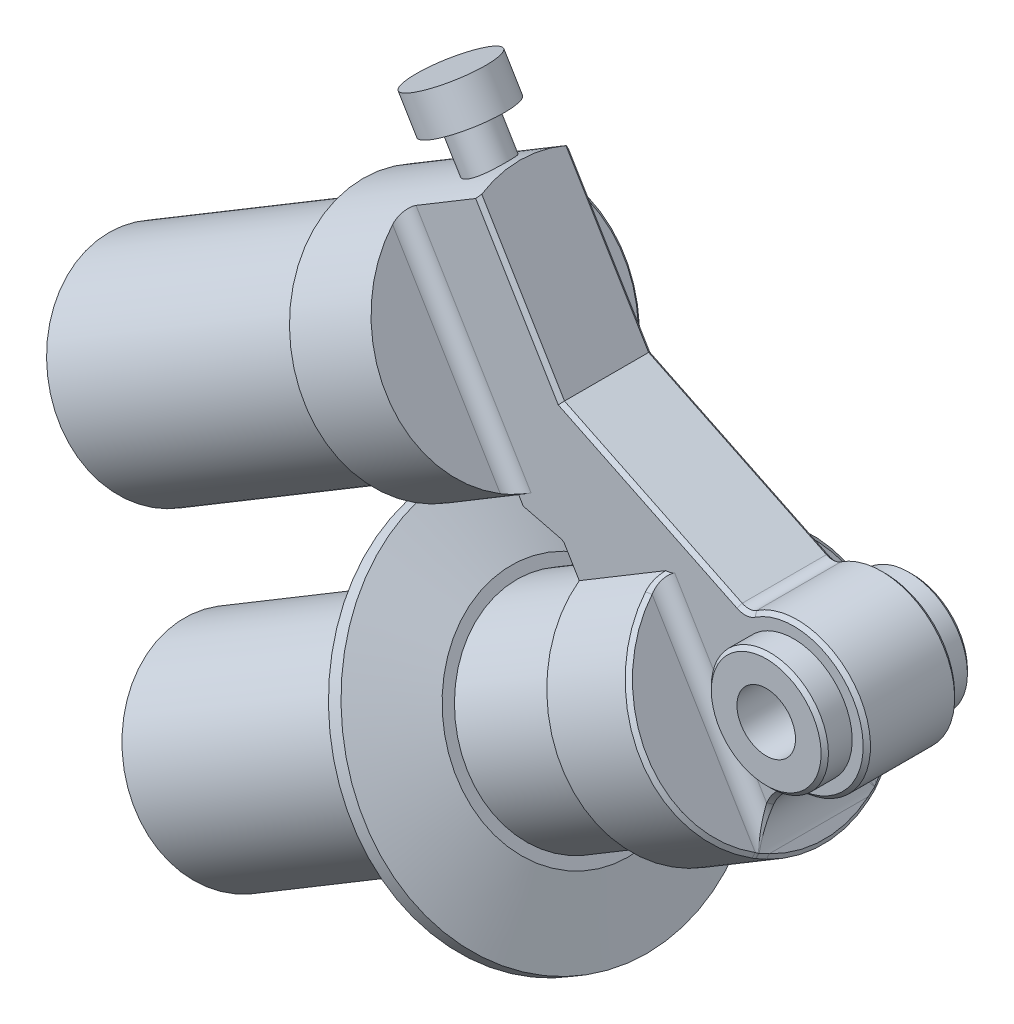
ISO-10303-21;
HEADER;
FILE_DESCRIPTION(('STEP AP214'),'2;1');
FILE_NAME('part.step','',(''),(''),'','','');
FILE_SCHEMA(('AUTOMOTIVE_DESIGN { 1 0 10303 214 1 1 1 1 }'));
ENDSEC;
DATA;
#1=APPLICATION_CONTEXT('core data for automotive mechanical design processes');
#2=APPLICATION_PROTOCOL_DEFINITION('international standard','automotive_design',2000,#1);
#3=PRODUCT_CONTEXT('',#1,'mechanical');
#4=PRODUCT('Part','Part','',(#3));
#5=PRODUCT_RELATED_PRODUCT_CATEGORY('part','',(#4));
#6=PRODUCT_DEFINITION_FORMATION('','',#4);
#7=PRODUCT_DEFINITION_CONTEXT('part definition',#1,'design');
#8=PRODUCT_DEFINITION('design','',#6,#7);
#9=PRODUCT_DEFINITION_SHAPE('','',#8);
#10=(LENGTH_UNIT() NAMED_UNIT(*) SI_UNIT(.MILLI.,.METRE.));
#11=(NAMED_UNIT(*) PLANE_ANGLE_UNIT() SI_UNIT($,.RADIAN.));
#12=(NAMED_UNIT(*) SI_UNIT($,.STERADIAN.) SOLID_ANGLE_UNIT());
#13=UNCERTAINTY_MEASURE_WITH_UNIT(LENGTH_MEASURE(1.E-05),#10,'distance_accuracy_value','');
#14=(GEOMETRIC_REPRESENTATION_CONTEXT(3) GLOBAL_UNCERTAINTY_ASSIGNED_CONTEXT((#13)) GLOBAL_UNIT_ASSIGNED_CONTEXT((#10,
#11,#12)) REPRESENTATION_CONTEXT('',''));
#15=CARTESIAN_POINT('',(0.,0.,0.));
#16=DIRECTION('',(0.,0.,1.));
#17=DIRECTION('',(1.,0.,0.));
#18=AXIS2_PLACEMENT_3D('',#15,#16,#17);
#19=CARTESIAN_POINT('',(4.69500736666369,258.373430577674,0.));
#20=DIRECTION('',(0.857318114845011,0.514786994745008,0.));
#21=DIRECTION('',(-0.514786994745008,0.857318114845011,0.));
#22=AXIS2_PLACEMENT_3D('',#19,#20,#21);
#23=CYLINDRICAL_SURFACE('',#22,13.9999999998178);
#24=CARTESIAN_POINT('',(57.8487304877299,290.29022425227,0.));
#25=DIRECTION('',(-0.857318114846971,-0.514786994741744,0.));
#26=DIRECTION('',(0.514786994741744,-0.857318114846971,0.));
#27=AXIS2_PLACEMENT_3D('',#24,#25,#26);
#28=CIRCLE('',#27,13.9999999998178);
#29=CARTESIAN_POINT('',(65.0557484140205,278.287770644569,0.));
#30=VERTEX_POINT('',#29);
#31=EDGE_CURVE('E36',#30,#30,#28,.T.);
#32=ORIENTED_EDGE('',*,*,#31,.T.);
#33=EDGE_LOOP('',(#32));
#34=FACE_BOUND('',#33,.T.);
#35=CARTESIAN_POINT('',(16.697460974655,265.580448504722,0.));
#36=DIRECTION('',(-0.857318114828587,-0.51478699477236,0.));
#37=DIRECTION('',(0.51478699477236,-0.857318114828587,0.));
#38=AXIS2_PLACEMENT_3D('',#35,#36,#37);
#39=CIRCLE('',#38,13.9999999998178);
#40=CARTESIAN_POINT('',(23.9044789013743,253.577994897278,0.));
#41=VERTEX_POINT('',#40);
#42=EDGE_CURVE('E1056',#41,#41,#39,.T.);
#43=ORIENTED_EDGE('',*,*,#42,.F.);
#44=EDGE_LOOP('',(#43));
#45=FACE_BOUND('',#44,.T.);
#46=ADVANCED_FACE('F32',(#34,#45),#23,.T.);
#47=CARTESIAN_POINT('',(77.5670471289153,302.130325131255,0.));
#48=DIRECTION('',(0.857318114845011,0.514786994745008,0.));
#49=DIRECTION('',(-0.514786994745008,0.857318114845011,0.));
#50=AXIS2_PLACEMENT_3D('',#47,#48,#49);
#51=CIRCLE('',#50,13.9999999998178);
#52=CARTESIAN_POINT('',(70.360029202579,314.132778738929,0.));
#53=VERTEX_POINT('',#52);
#54=EDGE_CURVE('E627',#53,#53,#51,.T.);
#55=ORIENTED_EDGE('',*,*,#54,.F.);
#56=EDGE_LOOP('',(#55));
#57=FACE_BOUND('',#56,.T.);
#58=CARTESIAN_POINT('',(62.1353210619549,292.864159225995,0.));
#59=DIRECTION('',(-0.857318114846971,-0.514786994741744,0.));
#60=DIRECTION('',(0.514786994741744,-0.857318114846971,0.));
#61=AXIS2_PLACEMENT_3D('',#58,#59,#60);
#62=CIRCLE('',#61,13.9999999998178);
#63=CARTESIAN_POINT('',(69.3423389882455,280.861705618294,0.));
#64=VERTEX_POINT('',#63);
#65=EDGE_CURVE('E11',#64,#64,#62,.T.);
#66=ORIENTED_EDGE('',*,*,#65,.F.);
#67=EDGE_LOOP('',(#66));
#68=FACE_BOUND('',#67,.T.);
#69=ADVANCED_FACE('F1045',(#57,#68),#23,.T.);
#70=CARTESIAN_POINT('',(99.,315.,-10.));
#71=DIRECTION('',(0.,0.,1.));
#72=DIRECTION('',(1.,0.,0.));
#73=AXIS2_PLACEMENT_3D('',#70,#71,#72);
#74=CYLINDRICAL_SURFACE('',#73,3.9999999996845);
#75=CARTESIAN_POINT('',(99.,315.,-10.));
#76=DIRECTION('',(0.,0.,1.));
#77=DIRECTION('',(1.,0.,0.));
#78=AXIS2_PLACEMENT_3D('',#75,#76,#77);
#79=CIRCLE('',#78,3.9999999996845);
#80=CARTESIAN_POINT('',(102.999999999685,315.,-10.));
#81=VERTEX_POINT('',#80);
#82=EDGE_CURVE('E1068',#81,#81,#79,.T.);
#83=ORIENTED_EDGE('',*,*,#82,.F.);
#84=EDGE_LOOP('',(#83));
#85=FACE_BOUND('',#84,.T.);
#86=CARTESIAN_POINT('',(99.,315.,10.));
#87=DIRECTION('',(0.,0.,1.));
#88=DIRECTION('',(1.,0.,0.));
#89=AXIS2_PLACEMENT_3D('',#86,#87,#88);
#90=CIRCLE('',#89,3.9999999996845);
#91=CARTESIAN_POINT('',(102.999999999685,315.,10.));
#92=VERTEX_POINT('',#91);
#93=EDGE_CURVE('E959',#92,#92,#90,.F.);
#94=ORIENTED_EDGE('',*,*,#93,.F.);
#95=EDGE_LOOP('',(#94));
#96=FACE_BOUND('',#95,.T.);
#97=ADVANCED_FACE('F943',(#85,#96),#74,.F.);
#98=CARTESIAN_POINT('',(95.931144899,296.895727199,-7.884231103));
#99=DIRECTION('',(0.894506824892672,-0.171081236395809,-0.413023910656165));
#100=DIRECTION('',(-0.187852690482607,-0.982197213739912,0.));
#101=AXIS2_PLACEMENT_3D('',#98,#99,#100);
#102=PLANE('',#101);
#103=CARTESIAN_POINT('',(95.899339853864,296.90431931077,-7.95660752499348));
#104=CARTESIAN_POINT('',(95.8973387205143,296.898043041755,-7.9583425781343));
#105=CARTESIAN_POINT('',(95.6972254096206,296.270416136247,-8.13184785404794));
#106=CARTESIAN_POINT('',(95.6952042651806,296.264077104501,-8.13360025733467));
#107=B_SPLINE_CURVE_WITH_KNOTS('',1,(#103,#104,#105,#106),.UNSPECIFIED.,.F.,.F.,(2,1,1,2),
(-0.0101,-9.9999999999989E-05,0.9999,1.01),.UNSPECIFIED.);
#108=CARTESIAN_POINT('',(95.8973384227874,296.898087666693,-7.95836662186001));
#109=VERTEX_POINT('',#108);
#110=CARTESIAN_POINT('',(95.6971648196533,296.270477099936,-8.13199519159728));
#111=VERTEX_POINT('',#110);
#112=EDGE_CURVE('E740',#109,#111,#107,.T.);
#113=ORIENTED_EDGE('',*,*,#112,.F.);
#114=CARTESIAN_POINT('',(95.92371750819,296.860449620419,-7.88570443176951));
#115=CARTESIAN_POINT('',(95.9193249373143,296.86672284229,-7.89781611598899));
#116=CARTESIAN_POINT('',(95.9149323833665,296.872996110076,-7.90992778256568));
#117=CARTESIAN_POINT('',(95.9061473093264,296.885542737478,-7.93415108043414));
#118=CARTESIAN_POINT('',(95.9017547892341,296.891816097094,-7.94626271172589));
#119=CARTESIAN_POINT('',(95.8973622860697,296.898089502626,-7.95837432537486));
#120=B_SPLINE_CURVE_WITH_KNOTS('',3,(#114,#115,#116,#117,#118,#119),.UNSPECIFIED.,.F.,.F.,(4,2,
4),(0.,0.0429891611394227,0.0859783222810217),.UNSPECIFIED.);
#121=CARTESIAN_POINT('',(95.9237019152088,296.860390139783,-7.88572958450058));
#122=VERTEX_POINT('',#121);
#123=EDGE_CURVE('E744',#122,#109,#120,.T.);
#124=ORIENTED_EDGE('',*,*,#123,.F.);
#125=CARTESIAN_POINT('',(95.6971123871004,296.270553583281,-8.13213007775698));
#126=CARTESIAN_POINT('',(95.7071725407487,296.296743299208,-8.12119050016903));
#127=CARTESIAN_POINT('',(95.7172327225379,296.322932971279,-8.11025084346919));
#128=CARTESIAN_POINT('',(95.7373531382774,296.375312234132,-8.08837138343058));
#129=CARTESIAN_POINT('',(95.7474133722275,296.401501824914,-8.07743158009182));
#130=CARTESIAN_POINT('',(95.7675338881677,296.453880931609,-8.05555183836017));
#131=CARTESIAN_POINT('',(95.7775941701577,296.480070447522,-8.04461189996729));
#132=CARTESIAN_POINT('',(95.7977147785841,296.53244941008,-8.02273189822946));
#133=CARTESIAN_POINT('',(95.8077751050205,296.558638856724,-8.01179183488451));
#134=CARTESIAN_POINT('',(95.8278957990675,296.611017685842,-7.98991159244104));
#135=CARTESIAN_POINT('',(95.8379561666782,296.637207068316,-7.97897141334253));
#136=CARTESIAN_POINT('',(95.858076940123,296.689585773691,-7.95709094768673));
#137=CARTESIAN_POINT('',(95.8681373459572,296.715775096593,-7.94615066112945));
#138=CARTESIAN_POINT('',(95.8857802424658,296.761703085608,-7.92696466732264));
#139=CARTESIAN_POINT('',(95.8933627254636,296.781441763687,-7.91871898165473));
#140=CARTESIAN_POINT('',(95.9085277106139,296.82091908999,-7.90222755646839));
#141=CARTESIAN_POINT('',(95.9161102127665,296.840657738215,-7.89398181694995));
#142=CARTESIAN_POINT('',(95.9236927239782,296.860396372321,-7.88573605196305));
#143=B_SPLINE_CURVE_WITH_KNOTS('',3,(#125,#126,#127,#128,#129,#130,#131,#132,#133,#134,#135,
#136,#137,#138,#139,#140,#141,#142),.UNSPECIFIED.,.F.,.F.,(4,2,2,2,2,2,2,2,4),(0.,
0.0903384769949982,0.180676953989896,0.271015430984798,0.361353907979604,0.451692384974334,
0.542030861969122,0.610118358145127,0.678205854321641),.UNSPECIFIED.);
#144=EDGE_CURVE('E936',#111,#122,#143,.T.);
#145=ORIENTED_EDGE('',*,*,#144,.F.);
#146=EDGE_LOOP('',(#113,#124,#145));
#147=FACE_BOUND('',#146,.T.);
#148=ADVANCED_FACE('F938',(#147),#102,.T.);
#149=CARTESIAN_POINT('',(96.400188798,304.585722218,-10.));
#150=DIRECTION('',(0.,0.,-1.));
#151=DIRECTION('',(-0.514786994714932,0.85731811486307,0.));
#152=AXIS2_PLACEMENT_3D('',#149,#150,#151);
#153=PLANE('',#152);
#154=ORIENTED_EDGE('',*,*,#82,.T.);
#155=EDGE_LOOP('',(#154));
#156=FACE_BOUND('',#155,.T.);
#157=CARTESIAN_POINT('',(99.,315.,-9.99999999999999));
#158=DIRECTION('',(0.,0.,1.));
#159=DIRECTION('',(1.,0.,0.));
#160=AXIS2_PLACEMENT_3D('',#157,#158,#159);
#161=CIRCLE('',#160,7.49999999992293);
#162=CARTESIAN_POINT('',(106.499999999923,315.,-9.99999999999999));
#163=VERTEX_POINT('',#162);
#164=EDGE_CURVE('E749',#163,#163,#161,.F.);
#165=ORIENTED_EDGE('',*,*,#164,.T.);
#166=EDGE_LOOP('',(#165));
#167=FACE_BOUND('',#166,.T.);
#168=ADVANCED_FACE('F942',(#156,#167),#153,.T.);
#169=CARTESIAN_POINT('',(-1.838832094,308.105803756,6.));
#170=DIRECTION('',(0.857318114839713,0.514786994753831,0.));
#171=DIRECTION('',(0.514786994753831,-0.857318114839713,0.));
#172=AXIS2_PLACEMENT_3D('',#169,#170,#171);
#173=PLANE('',#172);
#174=DIRECTION('',(-0.211802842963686,0.352733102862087,0.911437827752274));
#175=VECTOR('',#174,1.);
#176=CARTESIAN_POINT('',(3.64146223,298.979008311,3.));
#177=LINE('',#176,#175);
#178=CARTESIAN_POINT('',(4.33861184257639,297.817986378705,1.82287599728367E-09));
#179=VERTEX_POINT('',#178);
#180=CARTESIAN_POINT('',(2.94431261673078,300.140030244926,6.));
#181=VERTEX_POINT('',#180);
#182=EDGE_CURVE('E543',#179,#181,#177,.T.);
#183=ORIENTED_EDGE('',*,*,#182,.T.);
#184=DIRECTION('',(-0.514786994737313,0.857318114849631,0.));
#185=VECTOR('',#184,1.);
#186=CARTESIAN_POINT('',(1.249889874,302.961895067,6.));
#187=LINE('',#186,#185);
#188=CARTESIAN_POINT('',(-0.444532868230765,305.783759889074,6.));
#189=VERTEX_POINT('',#188);
#190=EDGE_CURVE('E1080',#181,#189,#187,.T.);
#191=ORIENTED_EDGE('',*,*,#190,.T.);
#192=DIRECTION('',(-0.211802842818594,0.352733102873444,-0.911437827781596));
#193=VECTOR('',#192,1.);
#194=CARTESIAN_POINT('',(-1.1416824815,306.944781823,3.));
#195=LINE('',#194,#193);
#196=CARTESIAN_POINT('',(-1.83883209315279,308.105803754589,-3.64575194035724E-09));
#197=VERTEX_POINT('',#196);
#198=EDGE_CURVE('E1077',#189,#197,#195,.T.);
#199=ORIENTED_EDGE('',*,*,#198,.T.);
#200=DIRECTION('',(0.211802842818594,-0.352733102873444,-0.911437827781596));
#201=VECTOR('',#200,1.);
#202=CARTESIAN_POINT('',(-1.1416824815,306.944781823,-3.));
#203=LINE('',#202,#201);
#204=CARTESIAN_POINT('',(-0.444532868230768,305.783759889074,-6.));
#205=VERTEX_POINT('',#204);
#206=EDGE_CURVE('E1073',#197,#205,#203,.T.);
#207=ORIENTED_EDGE('',*,*,#206,.T.);
#208=DIRECTION('',(0.514786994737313,-0.857318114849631,0.));
#209=VECTOR('',#208,1.);
#210=CARTESIAN_POINT('',(1.249889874,302.961895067,-6.));
#211=LINE('',#210,#209);
#212=CARTESIAN_POINT('',(2.94431261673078,300.140030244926,-6.));
#213=VERTEX_POINT('',#212);
#214=EDGE_CURVE('E755',#205,#213,#211,.T.);
#215=ORIENTED_EDGE('',*,*,#214,.T.);
#216=DIRECTION('',(0.211802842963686,-0.352733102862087,0.911437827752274));
#217=VECTOR('',#216,1.);
#218=CARTESIAN_POINT('',(3.64146223,298.979008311,-3.));
#219=LINE('',#218,#217);
#220=EDGE_CURVE('E748',#213,#179,#219,.T.);
#221=ORIENTED_EDGE('',*,*,#220,.T.);
#222=EDGE_LOOP('',(#183,#191,#199,#207,#215,#221));
#223=FACE_BOUND('',#222,.T.);
#224=ADVANCED_FACE('F1144',(#223),#173,.F.);
#225=CARTESIAN_POINT('',(96.176594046,296.391443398,6.845041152));
#226=DIRECTION('',(0.857318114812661,0.514786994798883,0.));
#227=DIRECTION('',(0.514786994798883,-0.857318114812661,0.));
#228=AXIS2_PLACEMENT_3D('',#225,#226,#227);
#229=PLANE('',#228);
#230=DIRECTION('',(0.,0.,1.));
#231=VECTOR('',#230,1.);
#232=CARTESIAN_POINT('',(96.1765940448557,296.391443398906,-2.15970000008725E-05));
#233=LINE('',#232,#231);
#234=CARTESIAN_POINT('',(96.1765939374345,296.391443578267,6.76387453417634));
#235=VERTEX_POINT('',#234);
#236=CARTESIAN_POINT('',(96.1765940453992,296.391443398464,-6.76387690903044));
#237=VERTEX_POINT('',#236);
#238=EDGE_CURVE('E563',#235,#237,#233,.F.);
#239=ORIENTED_EDGE('',*,*,#238,.F.);
#240=CARTESIAN_POINT('',(88.7121826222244,308.822556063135,0.));
#241=DIRECTION('',(-0.857318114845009,-0.514786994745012,0.));
#242=DIRECTION('',(0.514786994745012,-0.857318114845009,0.));
#243=AXIS2_PLACEMENT_3D('',#240,#241,#242);
#244=CIRCLE('',#243,16.0000000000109);
#245=EDGE_CURVE('E714',#235,#237,#244,.F.);
#246=ORIENTED_EDGE('',*,*,#245,.T.);
#247=EDGE_LOOP('',(#239,#246));
#248=FACE_BOUND('',#247,.T.);
#249=ADVANCED_FACE('F1148',(#248),#229,.T.);
#250=CARTESIAN_POINT('',(95.819884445,296.916930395,8.133616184));
#251=DIRECTION('',(0.894347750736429,-0.170822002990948,0.413475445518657));
#252=DIRECTION('',(-0.187610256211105,-0.98224355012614,0.));
#253=AXIS2_PLACEMENT_3D('',#250,#251,#252);
#254=PLANE('',#253);
#255=DIRECTION('',(0.293761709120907,0.921297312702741,-0.254784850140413));
#256=VECTOR('',#255,1.);
#257=CARTESIAN_POINT('',(95.7971669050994,296.584349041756,8.04535256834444));
#258=LINE('',#257,#256);
#259=CARTESIAN_POINT('',(95.6971051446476,296.270534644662,8.13213790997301));
#260=VERTEX_POINT('',#259);
#261=CARTESIAN_POINT('',(95.8972284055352,296.898162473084,7.9585674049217));
#262=VERTEX_POINT('',#261);
#263=EDGE_CURVE('E1789',#260,#262,#258,.T.);
#264=ORIENTED_EDGE('',*,*,#263,.F.);
#265=DIRECTION('',(-0.334101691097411,-0.869678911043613,0.363365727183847));
#266=VECTOR('',#265,1.);
#267=CARTESIAN_POINT('',(95.8103965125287,296.565436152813,8.00892327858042));
#268=LINE('',#267,#266);
#269=CARTESIAN_POINT('',(95.9236875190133,296.860336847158,7.88570913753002));
#270=VERTEX_POINT('',#269);
#271=EDGE_CURVE('E711',#270,#260,#268,.T.);
#272=ORIENTED_EDGE('',*,*,#271,.F.);
#273=DIRECTION('',(0.306769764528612,-0.438554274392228,-0.844726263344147));
#274=VECTOR('',#273,1.);
#275=CARTESIAN_POINT('',(95.9104579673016,296.879249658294,7.92213828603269));
#276=LINE('',#275,#274);
#277=EDGE_CURVE('E1785',#262,#270,#276,.T.);
#278=ORIENTED_EDGE('',*,*,#277,.F.);
#279=EDGE_LOOP('',(#264,#272,#278));
#280=FACE_BOUND('',#279,.T.);
#281=ADVANCED_FACE('F1152',(#280),#254,.T.);
#282=CARTESIAN_POINT('',(109.414277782,312.400188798,10.));
#283=DIRECTION('',(0.,0.,1.));
#284=DIRECTION('',(-0.514786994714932,0.85731811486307,0.));
#285=AXIS2_PLACEMENT_3D('',#282,#283,#284);
#286=PLANE('',#285);
#287=ORIENTED_EDGE('',*,*,#93,.T.);
#288=EDGE_LOOP('',(#287));
#289=FACE_BOUND('',#288,.T.);
#290=CARTESIAN_POINT('',(99.,315.,10.));
#291=DIRECTION('',(0.,0.,-1.));
#292=DIRECTION('',(-1.,0.,0.));
#293=AXIS2_PLACEMENT_3D('',#290,#291,#292);
#294=CIRCLE('',#293,7.4999999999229);
#295=CARTESIAN_POINT('',(91.5000000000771,315.,10.));
#296=VERTEX_POINT('',#295);
#297=EDGE_CURVE('E990',#296,#296,#294,.F.);
#298=ORIENTED_EDGE('',*,*,#297,.T.);
#299=EDGE_LOOP('',(#298));
#300=FACE_BOUND('',#299,.T.);
#301=ADVANCED_FACE('F967',(#289,#300),#286,.T.);
#302=CARTESIAN_POINT('',(95.69189229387,296.27071712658,-8.14647332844));
#303=CARTESIAN_POINT('',(95.6928747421,296.26869059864,-8.14251618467));
#304=CARTESIAN_POINT('',(95.69385719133,296.2666640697,-8.13855904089));
#305=CARTESIAN_POINT('',(95.69483963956,296.26463754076,-8.13460189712));
#306=CARTESIAN_POINT('',(95.79308450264,296.06198467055,-7.73888752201));
#307=CARTESIAN_POINT('',(95.89403950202,295.87962535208,-7.33331131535));
#308=CARTESIAN_POINT('',(95.99345132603,295.71556801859,-6.91813697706));
#309=CARTESIAN_POINT('',(95.694161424,296.276608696,-8.144005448));
#310=CARTESIAN_POINT('',(95.695142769,296.274584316,-8.140049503));
#311=CARTESIAN_POINT('',(95.696124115,296.272559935,-8.136093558));
#312=CARTESIAN_POINT('',(95.69710546,296.270535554,-8.132137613));
#313=CARTESIAN_POINT('',(95.79524,296.068097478,-7.736543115));
#314=CARTESIAN_POINT('',(95.896084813,295.885932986,-7.331089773));
#315=CARTESIAN_POINT('',(95.995390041,295.722051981,-6.916041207));
#316=CARTESIAN_POINT('',(95.921074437,296.865765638,-7.897217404));
#317=CARTESIAN_POINT('',(95.921945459,296.863956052,-7.893381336));
#318=CARTESIAN_POINT('',(95.922816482,296.862146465,-7.889545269));
#319=CARTESIAN_POINT('',(95.923687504,296.860336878,-7.885709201));
#320=CARTESIAN_POINT('',(96.010789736,296.679378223,-7.502102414));
#321=CARTESIAN_POINT('',(96.100615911,296.516696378,-7.108935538));
#322=CARTESIAN_POINT('',(96.189261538,296.370448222,-6.706464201));
#323=CARTESIAN_POINT('',(95.9233662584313,296.871716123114,-7.8947248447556));
#324=CARTESIAN_POINT('',(95.924236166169,296.869908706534,-7.8908899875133));
#325=CARTESIAN_POINT('',(95.9251060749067,296.868101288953,-7.8870551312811));
#326=CARTESIAN_POINT('',(95.9259759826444,296.866293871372,-7.8832202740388));
#327=CARTESIAN_POINT('',(96.0129667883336,296.685552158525,-7.4997345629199));
#328=CARTESIAN_POINT('',(96.1026816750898,296.523067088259,-7.1066917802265));
#329=CARTESIAN_POINT('',(96.1912196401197,296.376997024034,-6.7043474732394));
#330=B_SPLINE_SURFACE_WITH_KNOTS('',1,3,((#302,#303,#304,#305,#306,#307,#308),(#309,#310,#311,
#312,#313,#314,#315),(#316,#317,#318,#319,#320,#321,#322),(#323,#324,#325,#326,#327,#328,#329)),
.UNSPECIFIED.,.F.,.F.,.F.,(2,1,1,2),(4,3,4),(-0.01,0.,1.,1.0101),(0.0154715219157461,
0.0154847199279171,0.0168045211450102),.UNSPECIFIED.);
#331=CARTESIAN_POINT('',(96.1765941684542,296.391443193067,-6.76387697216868));
#332=CARTESIAN_POINT('',(96.1523749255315,296.431782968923,-6.87347240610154));
#333=CARTESIAN_POINT('',(96.1280378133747,296.473425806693,-6.98256473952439));
#334=CARTESIAN_POINT('',(96.0793004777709,296.559394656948,-7.19967292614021));
#335=CARTESIAN_POINT('',(96.0549002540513,296.603720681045,-7.30768877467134));
#336=CARTESIAN_POINT('',(95.9947192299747,296.716704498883,-7.57328227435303));
#337=CARTESIAN_POINT('',(95.9590024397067,296.786972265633,-7.73019040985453));
#338=CARTESIAN_POINT('',(95.923679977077,296.860352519,-7.88574235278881));
#339=B_SPLINE_CURVE_WITH_KNOTS('',3,(#331,#332,#333,#334,#335,#336,#337,#338),.UNSPECIFIED.,.F.,
.F.,(4,2,2,4),(0.,0.357801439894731,0.715604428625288,1.24228007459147),.UNSPECIFIED.);
#340=EDGE_CURVE('E1839',#237,#122,#339,.T.);
#341=DIRECTION('',(0.27633195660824,0.913392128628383,0.298923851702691));
#342=VECTOR('',#341,1.);
#343=CARTESIAN_POINT('',(96.0788961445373,296.068511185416,-6.86955996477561));
#344=LINE('',#343,#342);
#345=CARTESIAN_POINT('',(95.9811978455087,295.745577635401,-6.9752457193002));
#346=VERTEX_POINT('',#345);
#347=EDGE_CURVE('E710',#237,#346,#344,.F.);
#348=CARTESIAN_POINT('',(95.9811989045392,295.745578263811,-6.97524570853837));
#349=CARTESIAN_POINT('',(95.955502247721,295.788376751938,-7.0822636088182));
#350=CARTESIAN_POINT('',(95.9296898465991,295.832447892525,-7.18874616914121));
#351=CARTESIAN_POINT('',(95.8779931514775,295.923192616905,-7.40057907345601));
#352=CARTESIAN_POINT('',(95.8521088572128,295.969866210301,-7.50592941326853));
#353=CARTESIAN_POINT('',(95.7829773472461,296.098290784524,-7.78617866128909));
#354=CARTESIAN_POINT('',(95.7398095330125,296.182444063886,-7.95999845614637));
#355=CARTESIAN_POINT('',(95.6971405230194,296.270463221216,-8.13199626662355));
#356=B_SPLINE_CURVE_WITH_KNOTS('',3,(#348,#349,#350,#351,#352,#353,#354,#355),.UNSPECIFIED.,.F.,
.F.,(4,2,2,4),(0.,0.354258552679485,0.708518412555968,1.30202133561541),.UNSPECIFIED.);
#357=EDGE_CURVE('E988',#346,#111,#356,.T.);
#358=ORIENTED_EDGE('',*,*,#144,.T.);
#359=ORIENTED_EDGE('',*,*,#340,.F.);
#360=ORIENTED_EDGE('',*,*,#347,.T.);
#361=ORIENTED_EDGE('',*,*,#357,.T.);
#362=EDGE_LOOP('',(#358,#359,#360,#361));
#363=FACE_BOUND('',#362,.T.);
#364=ADVANCED_FACE('F961',(#363),#330,.T.);
#365=CARTESIAN_POINT('',(88.7121830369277,308.822556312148,0.));
#366=DIRECTION('',(-0.857318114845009,-0.514786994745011,0.));
#367=DIRECTION('',(0.514786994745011,-0.857318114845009,0.));
#368=AXIS2_PLACEMENT_3D('',#365,#366,#367);
#369=CONICAL_SURFACE('',#368,15.9999995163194,0.785398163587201);
#370=CARTESIAN_POINT('',(88.7121826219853,308.822556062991,0.));
#371=DIRECTION('',(-0.857318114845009,-0.514786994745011,0.));
#372=DIRECTION('',(0.514786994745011,-0.857318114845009,0.));
#373=AXIS2_PLACEMENT_3D('',#370,#371,#372);
#374=CIRCLE('',#373,16.0000000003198);
#375=CARTESIAN_POINT('',(95.7694130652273,297.069556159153,-8.25000042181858));
#376=VERTEX_POINT('',#375);
#377=CARTESIAN_POINT('',(81.6547849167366,320.575649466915,-8.2500593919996));
#378=VERTEX_POINT('',#377);
#379=EDGE_CURVE('E767',#376,#378,#374,.F.);
#380=ORIENTED_EDGE('',*,*,#379,.F.);
#381=DIRECTION('',(0.294326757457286,0.883423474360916,0.364602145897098));
#382=VECTOR('',#381,1.);
#383=CARTESIAN_POINT('',(95.666394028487,296.760343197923,-8.37761757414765));
#384=LINE('',#383,#382);
#385=CARTESIAN_POINT('',(95.5612930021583,296.444881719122,-8.50781315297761));
#386=VERTEX_POINT('',#385);
#387=EDGE_CURVE('E737',#386,#376,#384,.T.);
#388=ORIENTED_EDGE('',*,*,#387,.F.);
#389=CARTESIAN_POINT('',(88.2835235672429,308.565162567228,0.));
#390=DIRECTION('',(0.857318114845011,0.514786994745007,0.));
#391=DIRECTION('',(0.514786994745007,-0.857318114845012,0.));
#392=AXIS2_PLACEMENT_3D('',#389,#390,#391);
#393=CIRCLE('',#392,16.5000000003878);
#394=CARTESIAN_POINT('',(81.0055502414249,320.685393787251,-8.50788878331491));
#395=VERTEX_POINT('',#394);
#396=EDGE_CURVE('E534',#386,#395,#393,.T.);
#397=ORIENTED_EDGE('',*,*,#396,.T.);
#398=CARTESIAN_POINT('',(81.6610761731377,320.574502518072,-8.24757469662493));
#399=CARTESIAN_POINT('',(81.654583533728,320.57560107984,-8.25015326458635));
#400=CARTESIAN_POINT('',(81.0053195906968,320.685457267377,-8.50801006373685));
#401=CARTESIAN_POINT('',(80.9987620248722,320.686566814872,-8.51061441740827));
#402=B_SPLINE_CURVE_WITH_KNOTS('',1,(#398,#399,#400,#401),.UNSPECIFIED.,.F.,.F.,(2,1,1,2),
(-0.0101,-9.9999999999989E-05,0.9999,1.01),.UNSPECIFIED.);
#403=EDGE_CURVE('E758',#378,#395,#402,.T.);
#404=ORIENTED_EDGE('',*,*,#403,.F.);
#405=EDGE_LOOP('',(#380,#388,#397,#404));
#406=FACE_BOUND('',#405,.T.);
#407=ADVANCED_FACE('F907',(#406),#369,.T.);
#408=CARTESIAN_POINT('',(95.3194696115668,301.773386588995,-6.25513549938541));
#409=CARTESIAN_POINT('',(95.314630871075,301.756193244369,-6.25523580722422));
#410=CARTESIAN_POINT('',(95.3097921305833,301.738999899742,-6.25533611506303));
#411=CARTESIAN_POINT('',(95.3049533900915,301.721806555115,-6.25543642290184));
#412=CARTESIAN_POINT('',(95.0630163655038,300.862139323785,-6.26045181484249));
#413=CARTESIAN_POINT('',(95.0431793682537,299.948112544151,-6.54433885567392));
#414=CARTESIAN_POINT('',(95.3179422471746,298.23843161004,-7.23393667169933));
#415=CARTESIAN_POINT('',(95.6072685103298,297.424398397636,-7.65849375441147));
#416=CARTESIAN_POINT('',(96.0090395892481,296.684549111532,-8.08030664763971));
#417=CARTESIAN_POINT('',(95.32458071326,301.7713541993,-6.24969825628));
#418=CARTESIAN_POINT('',(95.31971825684,301.7541589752,-6.24979883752));
#419=CARTESIAN_POINT('',(95.31485580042,301.7369637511,-6.24989941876));
#420=CARTESIAN_POINT('',(95.309993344,301.719768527,-6.25));
#421=CARTESIAN_POINT('',(95.066870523,300.860007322,-6.255029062));
#422=CARTESIAN_POINT('',(95.04600422,299.946142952,-6.539689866));
#423=CARTESIAN_POINT('',(95.319145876,298.237110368,-7.231167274));
#424=CARTESIAN_POINT('',(95.607854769,297.423561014,-7.656881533));
#425=CARTESIAN_POINT('',(96.009200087,296.684304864,-8.079844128));
#426=CARTESIAN_POINT('',(95.7946601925,301.58443076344,-5.74962282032));
#427=CARTESIAN_POINT('',(95.787616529,301.56706267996,-5.74974854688));
#428=CARTESIAN_POINT('',(95.7805728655,301.54969459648,-5.74987427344));
#429=CARTESIAN_POINT('',(95.773529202,301.532326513,-5.75));
#430=CARTESIAN_POINT('',(95.421346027,300.663922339,-5.756286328));
#431=CARTESIAN_POINT('',(95.305812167,299.764995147,-6.112111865));
#432=CARTESIAN_POINT('',(95.429846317,298.115592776,-6.97645956));
#433=CARTESIAN_POINT('',(95.661774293,297.346544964,-7.508601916));
#434=CARTESIAN_POINT('',(96.023961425,296.661840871,-8.03730516));
#435=CARTESIAN_POINT('',(95.7994120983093,301.582541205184,-5.74456769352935));
#436=CARTESIAN_POINT('',(95.7923463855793,301.565171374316,-5.74469367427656));
#437=CARTESIAN_POINT('',(95.7852806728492,301.547801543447,-5.74481965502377));
#438=CARTESIAN_POINT('',(95.7782149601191,301.530431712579,-5.74494563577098));
#439=CARTESIAN_POINT('',(95.424929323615,300.661940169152,-5.75124467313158));
#440=CARTESIAN_POINT('',(95.3084384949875,299.763163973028,-6.10778959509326));
#441=CARTESIAN_POINT('',(95.4309653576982,298.11436438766,-6.97388478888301));
#442=CARTESIAN_POINT('',(95.6623193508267,297.345766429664,-7.50710299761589));
#443=CARTESIAN_POINT('',(96.0241106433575,296.661613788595,-8.0368751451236));
#444=B_SPLINE_SURFACE_WITH_KNOTS('',1,3,((#408,#409,#410,#411,#412,#413,#414,#415,#416),(#417,
#418,#419,#420,#421,#422,#423,#424,#425),(#426,#427,#428,#429,#430,#431,#432,#433,#434),(#435,
#436,#437,#438,#439,#440,#441,#442,#443)),.UNSPECIFIED.,.F.,.F.,.F.,(2,1,1,2),(4,3,2,4),
(-0.0108728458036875,0.,1.,1.01010872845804),(0.000320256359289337,0.000379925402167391,
0.00336337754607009,0.00634682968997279),.UNSPECIFIED.);
#445=DIRECTION('',(0.655538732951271,-0.265083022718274,0.707106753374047));
#446=VECTOR('',#445,1.);
#447=CARTESIAN_POINT('',(95.5417613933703,301.626047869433,-5.99999999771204));
#448=LINE('',#447,#446);
#449=CARTESIAN_POINT('',(95.3099933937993,301.719768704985,-6.24999999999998));
#450=VERTEX_POINT('',#449);
#451=CARTESIAN_POINT('',(95.7735293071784,301.532326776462,-5.74999999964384));
#452=VERTEX_POINT('',#451);
#453=EDGE_CURVE('E741',#450,#452,#448,.T.);
#454=CARTESIAN_POINT('',(95.9234551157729,296.860819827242,-7.88645801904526));
#455=CARTESIAN_POINT('',(95.880735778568,296.949627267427,-7.81953812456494));
#456=CARTESIAN_POINT('',(95.8402340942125,297.039605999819,-7.75274881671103));
#457=CARTESIAN_POINT('',(95.7637387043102,297.2219442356,-7.6198351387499));
#458=CARTESIAN_POINT('',(95.7277451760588,297.31430383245,-7.55371079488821));
#459=CARTESIAN_POINT('',(95.6599909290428,297.502410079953,-7.42185263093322));
#460=CARTESIAN_POINT('',(95.6282782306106,297.598181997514,-7.35613006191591));
#461=CARTESIAN_POINT('',(95.5696827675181,297.792157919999,-7.22612775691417));
#462=CARTESIAN_POINT('',(95.5428005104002,297.890362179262,-7.16184817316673));
#463=CARTESIAN_POINT('',(95.4801261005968,298.145925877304,-6.99889391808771));
#464=CARTESIAN_POINT('',(95.448005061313,298.305059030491,-6.90152659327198));
#465=CARTESIAN_POINT('',(95.409747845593,298.547926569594,-6.7599170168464));
#466=CARTESIAN_POINT('',(95.3986471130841,298.629609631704,-6.71343684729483));
#467=CARTESIAN_POINT('',(95.3798841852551,298.794282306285,-6.62212873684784));
#468=CARTESIAN_POINT('',(95.3722219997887,298.877271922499,-6.5773008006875));
#469=CARTESIAN_POINT('',(95.3546269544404,299.127589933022,-6.44604295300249));
#470=CARTESIAN_POINT('',(95.3499893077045,299.296867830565,-6.36248541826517));
#471=CARTESIAN_POINT('',(95.3560607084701,299.639878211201,-6.20618328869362));
#472=CARTESIAN_POINT('',(95.3667528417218,299.813605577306,-6.13342687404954));
#473=CARTESIAN_POINT('',(95.4069779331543,300.184167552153,-5.99562762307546));
#474=CARTESIAN_POINT('',(95.4384281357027,300.381465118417,-5.93227663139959));
#475=CARTESIAN_POINT('',(95.5021694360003,300.678271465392,-5.85638446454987));
#476=CARTESIAN_POINT('',(95.5261286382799,300.777199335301,-5.83429523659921));
#477=CARTESIAN_POINT('',(95.5796447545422,300.974867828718,-5.7973143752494));
#478=CARTESIAN_POINT('',(95.6091979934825,301.073608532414,-5.78241803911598));
#479=CARTESIAN_POINT('',(95.6614377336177,301.232405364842,-5.76480361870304));
#480=CARTESIAN_POINT('',(95.6824063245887,301.292763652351,-5.75960578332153));
#481=CARTESIAN_POINT('',(95.7264229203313,301.412983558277,-5.75238229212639));
#482=CARTESIAN_POINT('',(95.7494731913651,301.472844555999,-5.75036013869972));
#483=CARTESIAN_POINT('',(95.7735292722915,301.53232668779,-5.74999999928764));
#484=B_SPLINE_CURVE_WITH_KNOTS('',3,(#454,#455,#456,#457,#458,#459,#460,#461,#462,#463,#464,
#465,#466,#467,#468,#469,#470,#471,#472,#473,#474,#475,#476,#477,#478,#479,#480,#481,#482,#483),
.UNSPECIFIED.,.F.,.F.,(4,2,2,2,2,2,2,2,2,2,2,2,2,2,4),(0.,0.357344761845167,0.714703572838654,
1.0757865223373,1.43690738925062,2.00412789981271,2.28795902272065,2.57179095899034,
3.13735184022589,3.70228918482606,4.32848411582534,4.64063475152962,4.95258102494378,
5.1448003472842,5.33723151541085),.UNSPECIFIED.);
#485=EDGE_CURVE('E1835',#122,#452,#484,.T.);
#486=CARTESIAN_POINT('',(95.3099933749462,301.719768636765,-6.24999999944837));
#487=CARTESIAN_POINT('',(95.2919007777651,301.654443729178,-6.2500001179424));
#488=CARTESIAN_POINT('',(95.2748933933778,301.588834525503,-6.25181050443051));
#489=CARTESIAN_POINT('',(95.2431853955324,301.457366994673,-6.25870505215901));
#490=CARTESIAN_POINT('',(95.2284802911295,301.391509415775,-6.2637827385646));
#491=CARTESIAN_POINT('',(95.2014487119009,301.259643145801,-6.27686403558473));
#492=CARTESIAN_POINT('',(95.1891208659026,301.193634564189,-6.2848659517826));
#493=CARTESIAN_POINT('',(95.1669749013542,301.062332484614,-6.30336994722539));
#494=CARTESIAN_POINT('',(95.1571300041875,300.997039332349,-6.313842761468));
#495=CARTESIAN_POINT('',(95.1397398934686,300.86651980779,-6.33705496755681));
#496=CARTESIAN_POINT('',(95.1321957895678,300.801293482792,-6.34979544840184));
#497=CARTESIAN_POINT('',(95.1193511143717,300.671030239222,-6.37728624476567));
#498=CARTESIAN_POINT('',(95.1140511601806,300.605993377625,-6.39203711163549));
#499=CARTESIAN_POINT('',(95.1031235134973,300.437828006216,-6.43256882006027));
#500=CARTESIAN_POINT('',(95.0991553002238,300.334916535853,-6.45971402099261));
#501=CARTESIAN_POINT('',(95.0963292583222,300.130069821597,-6.51775250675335));
#502=CARTESIAN_POINT('',(95.0974731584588,300.028134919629,-6.5486470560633));
#503=CARTESIAN_POINT('',(95.1044984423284,299.825427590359,-6.61358618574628));
#504=CARTESIAN_POINT('',(95.1103806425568,299.724655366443,-6.64763130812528));
#505=CARTESIAN_POINT('',(95.1266234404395,299.523392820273,-6.71876108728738));
#506=CARTESIAN_POINT('',(95.1370293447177,299.422915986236,-6.75587333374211));
#507=CARTESIAN_POINT('',(95.1620862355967,299.223403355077,-6.83237741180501));
#508=CARTESIAN_POINT('',(95.1767362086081,299.124367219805,-6.87176869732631));
#509=CARTESIAN_POINT('',(95.2099639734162,298.927797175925,-6.95256521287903));
#510=CARTESIAN_POINT('',(95.2285416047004,298.830263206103,-6.99397036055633));
#511=CARTESIAN_POINT('',(95.2720860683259,298.624502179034,-7.08379691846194));
#512=CARTESIAN_POINT('',(95.297563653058,298.516481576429,-7.13244371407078));
#513=CARTESIAN_POINT('',(95.353178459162,298.30241856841,-7.2314180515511));
#514=CARTESIAN_POINT('',(95.3833162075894,298.196376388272,-7.28174578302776));
#515=CARTESIAN_POINT('',(95.4480744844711,297.986289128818,-7.38372124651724));
#516=CARTESIAN_POINT('',(95.4826959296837,297.882244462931,-7.43536924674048));
#517=CARTESIAN_POINT('',(95.5555167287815,297.678237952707,-7.53864681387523));
#518=CARTESIAN_POINT('',(95.5936320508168,297.578236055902,-7.59025665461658));
#519=CARTESIAN_POINT('',(95.673835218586,297.380258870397,-7.69419856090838));
#520=CARTESIAN_POINT('',(95.7159220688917,297.282283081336,-7.74653044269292));
#521=CARTESIAN_POINT('',(95.8038970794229,297.088479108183,-7.85178074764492));
#522=CARTESIAN_POINT('',(95.8497824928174,296.992649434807,-7.904698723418));
#523=CARTESIAN_POINT('',(95.8975078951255,296.89789586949,-7.95787322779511));
#524=B_SPLINE_CURVE_WITH_KNOTS('',3,(#486,#487,#488,#489,#490,#491,#492,#493,#494,#495,#496,
#497,#498,#499,#500,#501,#502,#503,#504,#505,#506,#507,#508,#509,#510,#511,#512,#513,#514,#515,
#516,#517,#518,#519,#520,#521,#522,#523),.UNSPECIFIED.,.F.,.F.,(4,2,2,2,2,2,2,2,2,2,2,2,2,2,2,2,
2,2,4),(0.,0.203296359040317,0.406191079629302,0.608968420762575,0.809455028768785,
1.01003817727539,1.21067644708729,1.52995948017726,1.84935049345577,2.16879655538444,
2.4915184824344,2.81416339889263,3.13679513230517,3.50020207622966,3.86365015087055,
4.22717265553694,4.58352561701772,4.93978949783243,5.29579796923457),.UNSPECIFIED.);
#525=EDGE_CURVE('E898',#450,#109,#524,.T.);
#526=ORIENTED_EDGE('',*,*,#453,.T.);
#527=ORIENTED_EDGE('',*,*,#485,.F.);
#528=ORIENTED_EDGE('',*,*,#123,.T.);
#529=ORIENTED_EDGE('',*,*,#525,.F.);
#530=EDGE_LOOP('',(#526,#527,#528,#529));
#531=FACE_BOUND('',#530,.T.);
#532=ADVANCED_FACE('F900',(#531),#444,.T.);
#533=CARTESIAN_POINT('',(95.5534421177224,296.448273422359,-8.5291621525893));
#534=CARTESIAN_POINT('',(95.5933696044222,296.380007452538,-8.3978917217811));
#535=CARTESIAN_POINT('',(95.640441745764,296.318552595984,-8.2660805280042));
#536=CARTESIAN_POINT('',(95.6950842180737,296.26419652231,-8.1338906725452));
#537=CARTESIAN_POINT('',(95.6956306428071,296.263652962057,-8.1325687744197));
#538=CARTESIAN_POINT('',(95.6961770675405,296.263109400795,-8.1312468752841));
#539=CARTESIAN_POINT('',(95.6967234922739,296.262565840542,-8.1299249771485));
#540=CARTESIAN_POINT('',(95.555545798,296.454579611,-8.526515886));
#541=CARTESIAN_POINT('',(95.595462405,296.386335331,-8.395542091));
#542=CARTESIAN_POINT('',(95.642507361,296.324891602,-8.264028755));
#543=CARTESIAN_POINT('',(95.69710546,296.270535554,-8.132137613));
#544=CARTESIAN_POINT('',(95.697651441,296.269991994,-8.130818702));
#545=CARTESIAN_POINT('',(95.698197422,296.269448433,-8.12949979));
#546=CARTESIAN_POINT('',(95.698743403,296.268904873,-8.128180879));
#547=CARTESIAN_POINT('',(95.763830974,297.078954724,-8.264509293));
#548=CARTESIAN_POINT('',(95.802670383,297.012857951,-8.16290538));
#549=CARTESIAN_POINT('',(95.847023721,296.95251596,-8.060882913));
#550=CARTESIAN_POINT('',(95.897228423,296.898162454,-7.958567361));
#551=CARTESIAN_POINT('',(95.89773047,296.897618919,-7.957544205));
#552=CARTESIAN_POINT('',(95.898232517,296.897075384,-7.956521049));
#553=CARTESIAN_POINT('',(95.898734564,296.896531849,-7.955497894));
#554=CARTESIAN_POINT('',(95.765913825,297.085198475,-8.261889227));
#555=CARTESIAN_POINT('',(95.804742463,297.019123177,-8.160579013));
#556=CARTESIAN_POINT('',(95.849068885,296.958792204,-8.058851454));
#557=CARTESIAN_POINT('',(95.899229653,296.904438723,-7.956831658));
#558=CARTESIAN_POINT('',(95.89973126,296.903895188,-7.95581146));
#559=CARTESIAN_POINT('',(95.900232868,296.903351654,-7.954791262));
#560=CARTESIAN_POINT('',(95.900734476,296.902808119,-7.953771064));
#561=B_SPLINE_SURFACE_WITH_KNOTS('',1,3,((#533,#534,#535,#536,#537,#538,#539),(#540,#541,#542,
#543,#544,#545,#546),(#547,#548,#549,#550,#551,#552,#553),(#554,#555,#556,#557,#558,#559,#560)),
.UNSPECIFIED.,.F.,.F.,.F.,(2,1,1,2),(4,3,4),(-0.0101,0.,1.,1.01),(0.00577654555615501,
0.006216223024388,0.00622061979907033),.UNSPECIFIED.);
#562=CARTESIAN_POINT('',(95.6971644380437,296.270476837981,-8.13199514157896));
#563=CARTESIAN_POINT('',(95.6833509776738,296.284224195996,-8.16535794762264));
#564=CARTESIAN_POINT('',(95.6700120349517,296.298437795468,-8.19872270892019));
#565=CARTESIAN_POINT('',(95.6442811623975,296.327772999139,-8.26541822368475));
#566=CARTESIAN_POINT('',(95.6318892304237,296.342894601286,-8.29874897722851));
#567=CARTESIAN_POINT('',(95.5989424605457,296.385913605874,-8.39077978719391));
#568=CARTESIAN_POINT('',(95.5793855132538,296.414744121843,-8.44940404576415));
#569=CARTESIAN_POINT('',(95.5612932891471,296.44488244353,-8.50781273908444));
#570=B_SPLINE_CURVE_WITH_KNOTS('',3,(#562,#563,#564,#565,#566,#567,#568,#569),.UNSPECIFIED.,.F.,
.F.,(4,2,2,4),(0.,0.115903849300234,0.231807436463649,0.43627459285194),.UNSPECIFIED.);
#571=EDGE_CURVE('E538',#111,#386,#570,.T.);
#572=CARTESIAN_POINT('',(95.8973233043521,296.898059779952,-7.95837400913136));
#573=CARTESIAN_POINT('',(95.8819555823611,296.914688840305,-7.98968528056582));
#574=CARTESIAN_POINT('',(95.8671400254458,296.931880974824,-8.02096632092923));
#575=CARTESIAN_POINT('',(95.8377473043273,296.968410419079,-8.085296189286));
#576=CARTESIAN_POINT('',(95.8232380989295,296.987814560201,-8.11833815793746));
#577=CARTESIAN_POINT('',(95.7954191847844,297.027812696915,-8.18429471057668));
#578=CARTESIAN_POINT('',(95.7821115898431,297.048408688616,-8.21720897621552));
#579=CARTESIAN_POINT('',(95.7694132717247,297.069555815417,-8.25000071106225));
#580=B_SPLINE_CURVE_WITH_KNOTS('',3,(#572,#573,#574,#575,#576,#577,#578,#579),.UNSPECIFIED.,.F.,
.F.,(4,2,2,4),(0.,0.115910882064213,0.23879474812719,0.361890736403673),.UNSPECIFIED.);
#581=EDGE_CURVE('E734',#109,#376,#580,.T.);
#582=ORIENTED_EDGE('',*,*,#112,.T.);
#583=ORIENTED_EDGE('',*,*,#571,.T.);
#584=ORIENTED_EDGE('',*,*,#387,.T.);
#585=ORIENTED_EDGE('',*,*,#581,.F.);
#586=EDGE_LOOP('',(#582,#583,#584,#585));
#587=FACE_BOUND('',#586,.T.);
#588=ADVANCED_FACE('F906',(#587),#561,.T.);
#589=CARTESIAN_POINT('',(81.570087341,320.716888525,-8.25));
#590=DIRECTION('',(0.857318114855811,0.514786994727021,0.));
#591=DIRECTION('',(0.514786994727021,-0.857318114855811,0.));
#592=AXIS2_PLACEMENT_3D('',#589,#590,#591);
#593=PLANE('',#592);
#594=DIRECTION('',(0.51478699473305,-0.857318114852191,0.));
#595=VECTOR('',#594,1.);
#596=CARTESIAN_POINT('',(88.4523238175,309.2553208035,-8.24999999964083));
#597=LINE('',#596,#595);
#598=EDGE_CURVE('E731',#376,#378,#597,.F.);
#599=ORIENTED_EDGE('',*,*,#598,.F.);
#600=ORIENTED_EDGE('',*,*,#379,.T.);
#601=EDGE_LOOP('',(#599,#600));
#602=FACE_BOUND('',#601,.T.);
#603=ADVANCED_FACE('F1161',(#602),#593,.T.);
#604=CARTESIAN_POINT('',(82.5358390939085,323.079661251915,-5.92673742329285));
#605=CARTESIAN_POINT('',(82.52318044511,323.072069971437,-5.92664239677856));
#606=CARTESIAN_POINT('',(82.5105217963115,323.06447869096,-5.92654737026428));
#607=CARTESIAN_POINT('',(82.497863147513,323.056887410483,-5.92645234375));
#608=CARTESIAN_POINT('',(81.8649307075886,322.677323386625,-5.9217010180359));
#609=CARTESIAN_POINT('',(81.3230855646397,322.198592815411,-6.2817856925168));
#610=CARTESIAN_POINT('',(80.8042941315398,321.315847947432,-7.3676828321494));
#611=CARTESIAN_POINT('',(80.8179518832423,320.909679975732,-8.0567007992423));
#612=CARTESIAN_POINT('',(81.062498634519,320.593527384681,-8.6947213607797));
#613=CARTESIAN_POINT('',(82.53818855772,323.07557508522,-5.92997193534));
#614=CARTESIAN_POINT('',(82.52555542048,323.06799912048,-5.92987712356));
#615=CARTESIAN_POINT('',(82.51292228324,323.06042315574,-5.92978231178));
#616=CARTESIAN_POINT('',(82.500289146,323.052847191,-5.9296875));
#617=CARTESIAN_POINT('',(81.868632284,322.674048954,-5.924946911));
#618=CARTESIAN_POINT('',(81.327995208,322.196090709,-6.28421789));
#619=CARTESIAN_POINT('',(80.810680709,321.31440746,-7.367661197));
#620=CARTESIAN_POINT('',(80.824623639,320.908537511,-8.055122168));
#621=CARTESIAN_POINT('',(81.069026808,320.592440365,-8.691700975));
#622=CARTESIAN_POINT('',(82.77080873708,322.67100412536,-6.25022065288));
#623=CARTESIAN_POINT('',(82.76070149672,322.66494457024,-6.25014710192));
#624=CARTESIAN_POINT('',(82.75059425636,322.65888501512,-6.25007355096));
#625=CARTESIAN_POINT('',(82.740487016,322.65282546,-6.25));
#626=CARTESIAN_POINT('',(82.235124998,322.349847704,-6.246322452));
#627=CARTESIAN_POINT('',(81.814098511,321.948357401,-6.525029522));
#628=CARTESIAN_POINT('',(81.443015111,321.171784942,-7.365519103));
#629=CARTESIAN_POINT('',(81.485193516,320.795422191,-7.898822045));
#630=CARTESIAN_POINT('',(81.715380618,320.484814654,-8.392652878));
#631=CARTESIAN_POINT('',(82.7731349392,322.66695841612,-6.25342314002));
#632=CARTESIAN_POINT('',(82.7630529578,322.66091402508,-6.25334980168));
#633=CARTESIAN_POINT('',(82.7529709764,322.65486963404,-6.25327646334));
#634=CARTESIAN_POINT('',(82.742888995,322.648825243,-6.253203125));
#635=CARTESIAN_POINT('',(82.238789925,322.346605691,-6.249536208));
#636=CARTESIAN_POINT('',(81.818959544,321.945880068,-6.527437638));
#637=CARTESIAN_POINT('',(81.449338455,321.170358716,-7.365497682));
#638=CARTESIAN_POINT('',(81.491799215,320.794291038,-7.897259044));
#639=CARTESIAN_POINT('',(81.721844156,320.483738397,-8.389662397));
#640=B_SPLINE_SURFACE_WITH_KNOTS('',1,3,((#604,#605,#606,#607,#608,#609,#610,#611,#612),(#613,
#614,#615,#616,#617,#618,#619,#620,#621),(#622,#623,#624,#625,#626,#627,#628,#629,#630),(#631,
#632,#633,#634,#635,#636,#637,#638,#639)),.UNSPECIFIED.,.F.,.F.,.F.,(2,1,1,2),(4,3,2,4),
(-0.0101,0.,1.,1.01),(0.00589327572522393,0.00593694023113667,0.00812016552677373,
0.0103033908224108),.UNSPECIFIED.);
#641=CARTESIAN_POINT('',(81.0057104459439,320.685396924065,-8.50784081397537));
#642=CARTESIAN_POINT('',(80.9806976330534,320.727104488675,-8.42704355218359));
#643=CARTESIAN_POINT('',(80.959250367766,320.770140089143,-8.34580550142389));
#644=CARTESIAN_POINT('',(80.9237743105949,320.858741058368,-8.18298002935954));
#645=CARTESIAN_POINT('',(80.9097532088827,320.904308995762,-8.10139233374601));
#646=CARTESIAN_POINT('',(80.8894010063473,320.998078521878,-7.93801684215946));
#647=CARTESIAN_POINT('',(80.8831227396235,321.046295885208,-7.85623144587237));
#648=CARTESIAN_POINT('',(80.8787286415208,321.144884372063,-7.69378730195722));
#649=CARTESIAN_POINT('',(80.8806085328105,321.195254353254,-7.61312798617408));
#650=CARTESIAN_POINT('',(80.8917162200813,321.289133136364,-7.46743851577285));
#651=CARTESIAN_POINT('',(80.8996250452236,321.332332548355,-7.4021056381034));
#652=CARTESIAN_POINT('',(80.921295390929,321.41997828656,-7.2732348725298));
#653=CARTESIAN_POINT('',(80.9350577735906,321.464424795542,-7.2096972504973));
#654=CARTESIAN_POINT('',(80.9600694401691,321.531787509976,-7.11632445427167));
#655=CARTESIAN_POINT('',(80.9691085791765,321.554303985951,-7.08559182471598));
#656=CARTESIAN_POINT('',(80.9886388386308,321.599586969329,-7.02477234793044));
#657=CARTESIAN_POINT('',(80.9991300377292,321.622353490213,-6.99468553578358));
#658=CARTESIAN_POINT('',(81.0215614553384,321.668107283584,-6.93524423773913));
#659=CARTESIAN_POINT('',(81.0335012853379,321.691094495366,-6.90588955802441));
#660=CARTESIAN_POINT('',(81.0587848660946,321.737263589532,-6.84794873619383));
#661=CARTESIAN_POINT('',(81.0721285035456,321.760445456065,-6.81936253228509));
#662=CARTESIAN_POINT('',(81.0996011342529,321.805680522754,-6.76480748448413));
#663=CARTESIAN_POINT('',(81.1136397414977,321.827721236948,-6.73878298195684));
#664=CARTESIAN_POINT('',(81.1430849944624,321.871960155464,-6.6876622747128));
#665=CARTESIAN_POINT('',(81.1584916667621,321.894158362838,-6.6625660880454));
#666=CARTESIAN_POINT('',(81.2067004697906,321.960943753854,-6.58874498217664));
#667=CARTESIAN_POINT('',(81.2414960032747,322.00572927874,-6.54147837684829));
#668=CARTESIAN_POINT('',(81.3163579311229,322.095966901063,-6.45083417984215));
#669=CARTESIAN_POINT('',(81.3564712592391,322.141421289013,-6.40749780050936));
#670=CARTESIAN_POINT('',(81.4413374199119,322.232328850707,-6.32560923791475));
#671=CARTESIAN_POINT('',(81.4860910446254,322.277782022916,-6.28705787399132));
#672=CARTESIAN_POINT('',(81.5329722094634,322.32310387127,-6.25109864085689));
#673=B_SPLINE_CURVE_WITH_KNOTS('',3,(#641,#642,#643,#644,#645,#646,#647,#648,#649,#650,#651,
#652,#653,#654,#655,#656,#657,#658,#659,#660,#661,#662,#663,#664,#665,#666,#667,#668,#669,#670,
#671,#672),.UNSPECIFIED.,.F.,.F.,(4,2,2,2,2,2,2,2,2,2,2,2,2,2,2,4),(0.,0.282865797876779,
0.56602394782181,0.851103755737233,1.13603411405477,1.37197368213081,1.60794801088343,
1.72538925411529,1.84283686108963,1.96025303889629,2.0776597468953,2.18825951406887,
2.29886143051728,2.52002719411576,2.74329407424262,2.96659913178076),.UNSPECIFIED.);
#674=CARTESIAN_POINT('',(81.5326066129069,322.323252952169,-6.25080986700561));
#675=VERTEX_POINT('',#674);
#676=EDGE_CURVE('E537',#395,#675,#673,.T.);
#677=CARTESIAN_POINT('',(81.5325467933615,322.324391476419,-6.2500000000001));
#678=CARTESIAN_POINT('',(81.5936924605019,322.327613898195,-6.25000000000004));
#679=CARTESIAN_POINT('',(81.6547981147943,322.33210231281,-6.25000000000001));
#680=CARTESIAN_POINT('',(81.7768587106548,322.344139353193,-6.24999999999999));
#681=CARTESIAN_POINT('',(81.8378128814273,322.351695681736,-6.25));
#682=CARTESIAN_POINT('',(81.9592350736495,322.370392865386,-6.25));
#683=CARTESIAN_POINT('',(82.0197026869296,322.381536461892,-6.25));
#684=CARTESIAN_POINT('',(82.1396437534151,322.407920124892,-6.25));
#685=CARTESIAN_POINT('',(82.1991185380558,322.423154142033,-6.25));
#686=CARTESIAN_POINT('',(82.3420805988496,322.465807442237,-6.25));
#687=CARTESIAN_POINT('',(82.4248812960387,322.49564910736,-6.25));
#688=CARTESIAN_POINT('',(82.5458681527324,322.548378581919,-6.25));
#689=CARTESIAN_POINT('',(82.5857842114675,322.56735671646,-6.25));
#690=CARTESIAN_POINT('',(82.6642368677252,322.608035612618,-6.25));
#691=CARTESIAN_POINT('',(82.702772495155,322.629738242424,-6.25));
#692=CARTESIAN_POINT('',(82.7404870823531,322.652825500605,-6.25));
#693=B_SPLINE_CURVE_WITH_KNOTS('',3,(#677,#678,#679,#680,#681,#682,#683,#684,#685,#686,#687,
#688,#689,#690,#691,#692),.UNSPECIFIED.,.F.,.F.,(4,2,2,2,2,2,2,4),(0.,0.183717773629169,
0.367899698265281,0.552222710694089,0.736274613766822,0.999570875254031,1.13207174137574,
1.26466396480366),.UNSPECIFIED.);
#694=CARTESIAN_POINT('',(82.7404870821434,322.652825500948,-6.24999999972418));
#695=VERTEX_POINT('',#694);
#696=EDGE_CURVE('E168',#675,#695,#693,.T.);
#697=CARTESIAN_POINT('',(81.6549427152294,320.575571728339,-8.24994807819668));
#698=CARTESIAN_POINT('',(81.6303475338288,320.616540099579,-8.18648490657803));
#699=CARTESIAN_POINT('',(81.6086309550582,320.658574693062,-8.12255983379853));
#700=CARTESIAN_POINT('',(81.5713423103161,320.744674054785,-7.99416861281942));
#701=CARTESIAN_POINT('',(81.555777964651,320.788741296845,-7.9297018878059));
#702=CARTESIAN_POINT('',(81.5311967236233,320.878876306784,-7.80051908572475));
#703=CARTESIAN_POINT('',(81.5222056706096,320.924951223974,-7.73580301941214));
#704=CARTESIAN_POINT('',(81.5112888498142,321.018750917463,-7.60700394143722));
#705=CARTESIAN_POINT('',(81.5093593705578,321.066474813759,-7.54292061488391));
#706=CARTESIAN_POINT('',(81.5125674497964,321.153342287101,-7.42921531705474));
#707=CARTESIAN_POINT('',(81.516324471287,321.192216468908,-7.37934639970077));
#708=CARTESIAN_POINT('',(81.5286813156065,321.270752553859,-7.28084608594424));
#709=CARTESIAN_POINT('',(81.5372804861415,321.310414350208,-7.23221452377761));
#710=CARTESIAN_POINT('',(81.5594514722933,321.390309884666,-7.13669907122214));
#711=CARTESIAN_POINT('',(81.573015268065,321.430542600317,-7.08981249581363));
#712=CARTESIAN_POINT('',(81.5971622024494,321.491205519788,-7.02110877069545));
#713=CARTESIAN_POINT('',(81.6058464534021,321.511482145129,-6.99847498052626));
#714=CARTESIAN_POINT('',(81.6245003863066,321.552105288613,-6.95380747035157));
#715=CARTESIAN_POINT('',(81.6344701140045,321.572451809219,-6.93177377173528));
#716=CARTESIAN_POINT('',(81.6662306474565,321.634008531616,-6.86648326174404));
#717=CARTESIAN_POINT('',(81.6897731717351,321.675493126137,-6.82431650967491));
#718=CARTESIAN_POINT('',(81.7416422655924,321.758722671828,-6.74331198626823));
#719=CARTESIAN_POINT('',(81.7699688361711,321.80046762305,-6.70447421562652));
#720=CARTESIAN_POINT('',(81.8313705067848,321.883846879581,-6.63061589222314));
#721=CARTESIAN_POINT('',(81.8644451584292,321.925481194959,-6.59559497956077));
#722=CARTESIAN_POINT('',(81.9351898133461,322.008251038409,-6.52987767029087));
#723=CARTESIAN_POINT('',(81.9728589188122,322.049386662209,-6.4991804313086));
#724=CARTESIAN_POINT('',(82.0480843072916,322.126300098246,-6.44572677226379));
#725=CARTESIAN_POINT('',(82.0851927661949,322.162167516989,-6.4224676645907));
#726=CARTESIAN_POINT('',(82.16249629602,322.232996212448,-6.38006709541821));
#727=CARTESIAN_POINT('',(82.2026910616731,322.267957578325,-6.36092522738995));
#728=CARTESIAN_POINT('',(82.2857345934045,322.336736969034,-6.32704035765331));
#729=CARTESIAN_POINT('',(82.328580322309,322.370556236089,-6.31229243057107));
#730=CARTESIAN_POINT('',(82.4165018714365,322.436918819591,-6.28737248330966));
#731=CARTESIAN_POINT('',(82.4615766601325,322.469462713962,-6.27719836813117));
#732=CARTESIAN_POINT('',(82.5453912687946,322.527559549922,-6.26292936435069));
#733=CARTESIAN_POINT('',(82.5838508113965,322.553335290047,-6.25807994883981));
#734=CARTESIAN_POINT('',(82.6615991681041,322.603851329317,-6.25161640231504));
#735=CARTESIAN_POINT('',(82.7008861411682,322.628593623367,-6.24999572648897));
#736=CARTESIAN_POINT('',(82.7404870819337,322.65282550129,-6.24999999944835));
#737=B_SPLINE_CURVE_WITH_KNOTS('',3,(#697,#698,#699,#700,#701,#702,#703,#704,#705,#706,#707,
#708,#709,#710,#711,#712,#713,#714,#715,#716,#717,#718,#719,#720,#721,#722,#723,#724,#725,#726,
#727,#728,#729,#730,#731,#732,#733,#734,#735,#736),.UNSPECIFIED.,.F.,.F.,(4,2,2,2,2,2,2,2,2,2,2,
2,2,2,2,2,2,2,2,4),(0.,0.238304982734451,0.476908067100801,0.716444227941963,0.955854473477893,
1.14569394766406,1.33550785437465,1.52501647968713,1.61980182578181,1.71459054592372,
1.90531424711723,2.09603798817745,2.28674372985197,2.47741226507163,2.64700399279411,
2.81657896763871,2.98596313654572,3.15526964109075,3.29479605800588,3.4340393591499),.UNSPECIFIED.);
#738=EDGE_CURVE('E728',#378,#695,#737,.T.);
#739=ORIENTED_EDGE('',*,*,#403,.T.);
#740=ORIENTED_EDGE('',*,*,#676,.T.);
#741=ORIENTED_EDGE('',*,*,#696,.T.);
#742=ORIENTED_EDGE('',*,*,#738,.F.);
#743=EDGE_LOOP('',(#739,#740,#741,#742));
#744=FACE_BOUND('',#743,.T.);
#745=ADVANCED_FACE('F776',(#744),#640,.T.);
#746=CARTESIAN_POINT('',(99.,315.,-10.));
#747=DIRECTION('',(0.,0.,1.));
#748=DIRECTION('',(1.,0.,0.));
#749=AXIS2_PLACEMENT_3D('',#746,#747,#748);
#750=CONICAL_SURFACE('',#749,7.49999999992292,0.78539816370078);
#751=ORIENTED_EDGE('',*,*,#164,.F.);
#752=EDGE_LOOP('',(#751));
#753=FACE_BOUND('',#752,.T.);
#754=CARTESIAN_POINT('',(99.,315.,-9.5));
#755=DIRECTION('',(0.,0.,1.));
#756=DIRECTION('',(0.514786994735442,-0.857318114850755,0.));
#757=AXIS2_PLACEMENT_3D('',#754,#755,#756);
#758=CIRCLE('',#757,8.00000000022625);
#759=CARTESIAN_POINT('',(103.118295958,308.141455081,-9.5));
#760=VERTEX_POINT('',#759);
#761=EDGE_CURVE('E716',#760,#760,#758,.F.);
#762=ORIENTED_EDGE('',*,*,#761,.T.);
#763=EDGE_LOOP('',(#762));
#764=FACE_BOUND('',#763,.T.);
#765=ADVANCED_FACE('F1169',(#753,#764),#750,.T.);
#766=CARTESIAN_POINT('',(2.944312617,300.140030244,-6.));
#767=DIRECTION('',(-0.469196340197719,0.781392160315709,0.411437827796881));
#768=DIRECTION('',(0.211802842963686,-0.352733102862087,0.911437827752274));
#769=AXIS2_PLACEMENT_3D('',#766,#767,#768);
#770=PLANE('',#769);
#771=DIRECTION('',(-0.857318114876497,-0.514786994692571,0.));
#772=VECTOR('',#771,1.);
#773=CARTESIAN_POINT('',(6.9105661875,299.362347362,0.));
#774=LINE('',#773,#772);
#775=CARTESIAN_POINT('',(9.48252053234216,300.906708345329,-9.94852641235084E-11));
#776=VERTEX_POINT('',#775);
#777=EDGE_CURVE('E1088',#776,#179,#774,.T.);
#778=ORIENTED_EDGE('',*,*,#777,.T.);
#779=ORIENTED_EDGE('',*,*,#220,.F.);
#780=DIRECTION('',(0.857318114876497,0.514786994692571,0.));
#781=VECTOR('',#780,1.);
#782=CARTESIAN_POINT('',(5.5162669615,301.684391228,-6.));
#783=LINE('',#782,#781);
#784=CARTESIAN_POINT('',(8.08822130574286,303.228752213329,-6.000000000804));
#785=VERTEX_POINT('',#784);
#786=EDGE_CURVE('E1072',#213,#785,#783,.T.);
#787=ORIENTED_EDGE('',*,*,#786,.T.);
#788=DIRECTION('',(-0.211802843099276,0.352733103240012,-0.911437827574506));
#789=VECTOR('',#788,1.);
#790=CARTESIAN_POINT('',(9.48252053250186,300.906708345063,0.));
#791=LINE('',#790,#789);
#792=EDGE_CURVE('E865',#776,#785,#791,.T.);
#793=ORIENTED_EDGE('',*,*,#792,.F.);
#794=EDGE_LOOP('',(#778,#779,#787,#793));
#795=FACE_BOUND('',#794,.T.);
#796=ADVANCED_FACE('F1165',(#795),#770,.F.);
#797=CARTESIAN_POINT('',(-0.444532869,305.78375989,-6.));
#798=DIRECTION('',(0.,0.,1.));
#799=DIRECTION('',(0.514786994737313,-0.857318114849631,0.));
#800=AXIS2_PLACEMENT_3D('',#797,#798,#799);
#801=PLANE('',#800);
#802=ORIENTED_EDGE('',*,*,#786,.F.);
#803=ORIENTED_EDGE('',*,*,#214,.F.);
#804=DIRECTION('',(0.857318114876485,0.514786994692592,0.));
#805=VECTOR('',#804,1.);
#806=CARTESIAN_POINT('',(2.1274214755,307.328120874,-6.));
#807=LINE('',#806,#805);
#808=CARTESIAN_POINT('',(4.69937582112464,308.872481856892,-6.000000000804));
#809=VERTEX_POINT('',#808);
#810=EDGE_CURVE('E1076',#205,#809,#807,.T.);
#811=ORIENTED_EDGE('',*,*,#810,.T.);
#812=DIRECTION('',(-0.514786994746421,0.857318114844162,0.));
#813=VECTOR('',#812,1.);
#814=CARTESIAN_POINT('',(6.3937985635,306.050617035,-6.00000000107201));
#815=LINE('',#814,#813);
#816=EDGE_CURVE('E1939',#785,#809,#815,.T.);
#817=ORIENTED_EDGE('',*,*,#816,.F.);
#818=EDGE_LOOP('',(#802,#803,#811,#817));
#819=FACE_BOUND('',#818,.T.);
#820=ADVANCED_FACE('F1168',(#819),#801,.F.);
#821=CARTESIAN_POINT('',(-1.838832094,308.105803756,0.));
#822=DIRECTION('',(0.469196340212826,-0.78139216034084,0.411437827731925));
#823=DIRECTION('',(0.211802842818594,-0.352733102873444,-0.911437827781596));
#824=AXIS2_PLACEMENT_3D('',#821,#822,#823);
#825=PLANE('',#824);
#826=ORIENTED_EDGE('',*,*,#810,.F.);
#827=ORIENTED_EDGE('',*,*,#206,.F.);
#828=DIRECTION('',(0.857318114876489,0.514786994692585,0.));
#829=VECTOR('',#828,1.);
#830=CARTESIAN_POINT('',(0.7331222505,309.65016474,0.));
#831=LINE('',#830,#829);
#832=CARTESIAN_POINT('',(3.30507659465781,311.194525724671,-9.94901298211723E-11));
#833=VERTEX_POINT('',#832);
#834=EDGE_CURVE('E1079',#197,#833,#831,.T.);
#835=ORIENTED_EDGE('',*,*,#834,.T.);
#836=DIRECTION('',(-0.21180284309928,0.352733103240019,0.911437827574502));
#837=VECTOR('',#836,1.);
#838=CARTESIAN_POINT('',(4.69937582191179,308.872481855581,-6.000000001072));
#839=LINE('',#838,#837);
#840=EDGE_CURVE('E1944',#809,#833,#839,.T.);
#841=ORIENTED_EDGE('',*,*,#840,.F.);
#842=EDGE_LOOP('',(#826,#827,#835,#841));
#843=FACE_BOUND('',#842,.T.);
#844=ADVANCED_FACE('F1173',(#843),#825,.F.);
#845=CARTESIAN_POINT('',(-0.444532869,305.78375989,6.));
#846=DIRECTION('',(0.469196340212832,-0.781392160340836,-0.411437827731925));
#847=DIRECTION('',(-0.211802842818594,0.352733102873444,-0.911437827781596));
#848=AXIS2_PLACEMENT_3D('',#845,#846,#847);
#849=PLANE('',#848);
#850=ORIENTED_EDGE('',*,*,#834,.F.);
#851=ORIENTED_EDGE('',*,*,#198,.F.);
#852=DIRECTION('',(0.857318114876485,0.514786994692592,0.));
#853=VECTOR('',#852,1.);
#854=CARTESIAN_POINT('',(2.1274214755,307.328120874,6.));
#855=LINE('',#854,#853);
#856=CARTESIAN_POINT('',(4.69937582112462,308.872481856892,6.000000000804));
#857=VERTEX_POINT('',#856);
#858=EDGE_CURVE('E1082',#189,#857,#855,.T.);
#859=ORIENTED_EDGE('',*,*,#858,.T.);
#860=DIRECTION('',(0.211802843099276,-0.352733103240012,0.911437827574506));
#861=VECTOR('',#860,1.);
#862=CARTESIAN_POINT('',(3.30507659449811,311.194525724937,0.));
#863=LINE('',#862,#861);
#864=EDGE_CURVE('E1946',#833,#857,#863,.T.);
#865=ORIENTED_EDGE('',*,*,#864,.F.);
#866=EDGE_LOOP('',(#850,#851,#859,#865));
#867=FACE_BOUND('',#866,.T.);
#868=ADVANCED_FACE('F1177',(#867),#849,.F.);
#869=CARTESIAN_POINT('',(2.944312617,300.140030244,6.));
#870=DIRECTION('',(0.,0.,-1.));
#871=DIRECTION('',(-0.514786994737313,0.857318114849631,0.));
#872=AXIS2_PLACEMENT_3D('',#869,#870,#871);
#873=PLANE('',#872);
#874=ORIENTED_EDGE('',*,*,#858,.F.);
#875=ORIENTED_EDGE('',*,*,#190,.F.);
#876=DIRECTION('',(0.857318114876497,0.514786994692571,0.));
#877=VECTOR('',#876,1.);
#878=CARTESIAN_POINT('',(5.5162669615,301.684391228,6.));
#879=LINE('',#878,#877);
#880=CARTESIAN_POINT('',(8.08822130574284,303.228752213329,6.000000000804));
#881=VERTEX_POINT('',#880);
#882=EDGE_CURVE('E715',#181,#881,#879,.T.);
#883=ORIENTED_EDGE('',*,*,#882,.T.);
#884=DIRECTION('',(0.514786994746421,-0.857318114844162,0.));
#885=VECTOR('',#884,1.);
#886=CARTESIAN_POINT('',(6.3937985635,306.050617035,6.000000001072));
#887=LINE('',#886,#885);
#888=EDGE_CURVE('E1952',#857,#881,#887,.T.);
#889=ORIENTED_EDGE('',*,*,#888,.F.);
#890=EDGE_LOOP('',(#874,#875,#883,#889));
#891=FACE_BOUND('',#890,.T.);
#892=ADVANCED_FACE('F1180',(#891),#873,.F.);
#893=CARTESIAN_POINT('',(4.338611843,297.817986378,0.));
#894=DIRECTION('',(-0.469196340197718,0.781392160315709,-0.411437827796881));
#895=DIRECTION('',(-0.211802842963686,0.352733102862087,0.911437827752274));
#896=AXIS2_PLACEMENT_3D('',#893,#894,#895);
#897=PLANE('',#896);
#898=ORIENTED_EDGE('',*,*,#882,.F.);
#899=ORIENTED_EDGE('',*,*,#182,.F.);
#900=ORIENTED_EDGE('',*,*,#777,.F.);
#901=DIRECTION('',(0.21180284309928,-0.352733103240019,-0.911437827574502));
#902=VECTOR('',#901,1.);
#903=CARTESIAN_POINT('',(8.08822130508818,303.228752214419,6.00000000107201));
#904=LINE('',#903,#902);
#905=EDGE_CURVE('E1916',#881,#776,#904,.T.);
#906=ORIENTED_EDGE('',*,*,#905,.F.);
#907=EDGE_LOOP('',(#898,#899,#900,#906));
#908=FACE_BOUND('',#907,.T.);
#909=ADVANCED_FACE('F1184',(#908),#897,.F.);
#910=CARTESIAN_POINT('',(88.712183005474,308.822556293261,0.));
#911=DIRECTION('',(-0.857318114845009,-0.514786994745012,0.));
#912=DIRECTION('',(0.514786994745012,-0.857318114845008,0.));
#913=AXIS2_PLACEMENT_3D('',#910,#911,#912);
#914=CONICAL_SURFACE('',#913,15.9999995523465,0.785398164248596);
#915=CARTESIAN_POINT('',(88.2835235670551,308.565162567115,0.));
#916=DIRECTION('',(0.857318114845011,0.514786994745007,0.));
#917=DIRECTION('',(0.514786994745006,-0.857318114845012,0.));
#918=AXIS2_PLACEMENT_3D('',#915,#916,#917);
#919=CIRCLE('',#918,16.4999999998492);
#920=CARTESIAN_POINT('',(81.0055879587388,320.685418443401,8.50789460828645));
#921=VERTEX_POINT('',#920);
#922=CARTESIAN_POINT('',(95.5612928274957,296.444881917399,8.50781238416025));
#923=VERTEX_POINT('',#922);
#924=EDGE_CURVE('E528',#921,#923,#919,.T.);
#925=ORIENTED_EDGE('',*,*,#924,.T.);
#926=DIRECTION('',(-0.294326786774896,-0.883423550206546,0.364601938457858));
#927=VECTOR('',#926,1.);
#928=CARTESIAN_POINT('',(95.6653535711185,296.757219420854,8.37890600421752));
#929=LINE('',#928,#927);
#930=CARTESIAN_POINT('',(95.7694131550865,297.069556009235,8.25000012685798));
#931=VERTEX_POINT('',#930);
#932=EDGE_CURVE('E1792',#931,#923,#929,.T.);
#933=ORIENTED_EDGE('',*,*,#932,.F.);
#934=CARTESIAN_POINT('',(88.7121826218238,308.822556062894,0.));
#935=DIRECTION('',(-0.857318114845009,-0.514786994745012,0.));
#936=DIRECTION('',(0.514786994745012,-0.857318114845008,0.));
#937=AXIS2_PLACEMENT_3D('',#934,#935,#936);
#938=CIRCLE('',#937,15.9999999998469);
#939=CARTESIAN_POINT('',(81.6547934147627,320.575655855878,8.25006052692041));
#940=VERTEX_POINT('',#939);
#941=EDGE_CURVE('E1795',#931,#940,#938,.T.);
#942=ORIENTED_EDGE('',*,*,#941,.T.);
#943=CARTESIAN_POINT('',(80.9989040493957,320.686586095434,8.51058164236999));
#944=CARTESIAN_POINT('',(81.0053965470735,320.685487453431,8.50800308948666));
#945=CARTESIAN_POINT('',(81.6546462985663,320.575623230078,8.2501478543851));
#946=CARTESIAN_POINT('',(81.661203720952,320.574513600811,8.24754351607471));
#947=B_SPLINE_CURVE_WITH_KNOTS('',1,(#943,#944,#945,#946),.UNSPECIFIED.,.F.,.F.,(2,1,1,2),
(-0.01,0.,1.,1.0101),.UNSPECIFIED.);
#948=EDGE_CURVE('E578',#921,#940,#947,.T.);
#949=ORIENTED_EDGE('',*,*,#948,.F.);
#950=EDGE_LOOP('',(#925,#933,#942,#949));
#951=FACE_BOUND('',#950,.T.);
#952=ADVANCED_FACE('F1034',(#951),#914,.T.);
#953=CARTESIAN_POINT('',(95.99345132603,295.71556801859,6.91813697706));
#954=CARTESIAN_POINT('',(95.89403950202,295.87962535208,7.33331131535));
#955=CARTESIAN_POINT('',(95.79308450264,296.06198467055,7.73888752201));
#956=CARTESIAN_POINT('',(95.69483963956,296.26463754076,8.13460189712));
#957=CARTESIAN_POINT('',(95.995390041,295.722051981,6.916041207));
#958=CARTESIAN_POINT('',(95.896084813,295.885932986,7.331089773));
#959=CARTESIAN_POINT('',(95.79524,296.068097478,7.736543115));
#960=CARTESIAN_POINT('',(95.69710546,296.270535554,8.132137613));
#961=CARTESIAN_POINT('',(96.189261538,296.370448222,6.706464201));
#962=CARTESIAN_POINT('',(96.100615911,296.516696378,7.108935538));
#963=CARTESIAN_POINT('',(96.010789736,296.679378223,7.502102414));
#964=CARTESIAN_POINT('',(95.923687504,296.860336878,7.885709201));
#965=CARTESIAN_POINT('',(96.19120025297,296.37693218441,6.70436843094));
#966=CARTESIAN_POINT('',(96.10266122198,296.52300401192,7.10671399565));
#967=CARTESIAN_POINT('',(96.01294523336,296.68549103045,7.49975800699));
#968=CARTESIAN_POINT('',(95.92595332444,296.86623489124,7.88324491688));
#969=B_SPLINE_SURFACE_WITH_KNOTS('',1,3,((#953,#954,#955,#956),(#957,#958,#959,#960),(#961,#962,
#963,#964),(#965,#966,#967,#968)),.UNSPECIFIED.,.F.,.F.,.F.,(2,1,1,2),(4,4),(-0.01,0.,1.,1.01),
(0.0154847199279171,0.0168045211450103),.UNSPECIFIED.);
#970=DIRECTION('',(-0.276331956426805,-0.913392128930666,0.298923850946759));
#971=VECTOR('',#970,1.);
#972=CARTESIAN_POINT('',(96.0788961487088,296.068511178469,6.86955994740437));
#973=LINE('',#972,#971);
#974=CARTESIAN_POINT('',(95.9811983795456,295.745577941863,6.97524569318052));
#975=VERTEX_POINT('',#974);
#976=EDGE_CURVE('E708',#975,#235,#973,.F.);
#977=CARTESIAN_POINT('',(95.9236875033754,296.860336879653,7.88570919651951));
#978=CARTESIAN_POINT('',(95.9340022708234,296.838903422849,7.84027161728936));
#979=CARTESIAN_POINT('',(95.9443526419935,296.81773441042,7.79471749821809));
#980=CARTESIAN_POINT('',(95.9651347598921,296.77586867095,7.70326981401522));
#981=CARTESIAN_POINT('',(95.9755666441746,296.755173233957,7.65737568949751));
#982=CARTESIAN_POINT('',(95.9964976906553,296.714251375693,7.56524800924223));
#983=CARTESIAN_POINT('',(96.006996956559,296.694026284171,7.51901388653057));
#984=CARTESIAN_POINT('',(96.0280491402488,296.654041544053,7.42620621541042));
#985=CARTESIAN_POINT('',(96.0386021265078,296.634283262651,7.37963209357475));
#986=CARTESIAN_POINT('',(96.0597484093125,296.595228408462,7.28614443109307));
#987=CARTESIAN_POINT('',(96.0703417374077,296.575933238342,7.23923031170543));
#988=CARTESIAN_POINT('',(96.0915557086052,296.537800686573,7.14506265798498));
#989=CARTESIAN_POINT('',(96.1021763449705,296.51896474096,7.09780854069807));
#990=CARTESIAN_POINT('',(96.1234322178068,296.481746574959,7.00296089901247));
#991=CARTESIAN_POINT('',(96.1340674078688,296.463365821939,6.95536678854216));
#992=CARTESIAN_POINT('',(96.1553401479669,296.427053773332,6.8598391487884));
#993=CARTESIAN_POINT('',(96.1659776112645,296.409123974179,6.81190503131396));
#994=CARTESIAN_POINT('',(96.1765938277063,296.391443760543,6.76387444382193));
#995=B_SPLINE_CURVE_WITH_KNOTS('',3,(#977,#978,#979,#980,#981,#982,#983,#984,#985,#986,#987,
#988,#989,#990,#991,#992,#993,#994),.UNSPECIFIED.,.F.,.F.,(4,2,2,2,2,2,2,2,4),(0.,
0.153860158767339,0.308098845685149,0.462730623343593,0.617769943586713,0.773231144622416,
0.929128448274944,1.08547595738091,1.24228765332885),.UNSPECIFIED.);
#996=EDGE_CURVE('E558',#270,#235,#995,.T.);
#997=CARTESIAN_POINT('',(95.6971054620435,296.270535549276,8.13213760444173));
#998=CARTESIAN_POINT('',(95.7225709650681,296.21800181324,8.02948335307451));
#999=CARTESIAN_POINT('',(95.7482158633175,296.166842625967,7.92617607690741));
#1000=CARTESIAN_POINT('',(95.7997035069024,296.067218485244,7.71831941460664));
#1001=CARTESIAN_POINT('',(95.8255462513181,296.018753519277,7.61377003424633));
#1002=CARTESIAN_POINT('',(95.8947453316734,295.892602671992,7.33244180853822));
#1003=CARTESIAN_POINT('',(95.938135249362,295.817302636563,7.15459690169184));
#1004=CARTESIAN_POINT('',(95.9811989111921,295.745578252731,6.97524568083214));
#1005=B_SPLINE_CURVE_WITH_KNOTS('',3,(#997,#998,#999,#1000,#1001,#1002,#1003,#1004),
.UNSPECIFIED.,.F.,.F.,(4,2,2,4),(0.,0.354263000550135,0.7085243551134,1.30218691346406),.UNSPECIFIED.);
#1006=EDGE_CURVE('E705',#260,#975,#1005,.T.);
#1007=ORIENTED_EDGE('',*,*,#976,.T.);
#1008=ORIENTED_EDGE('',*,*,#996,.F.);
#1009=ORIENTED_EDGE('',*,*,#271,.T.);
#1010=ORIENTED_EDGE('',*,*,#1006,.T.);
#1011=EDGE_LOOP('',(#1007,#1008,#1009,#1010));
#1012=FACE_BOUND('',#1011,.T.);
#1013=ADVANCED_FACE('F1026',(#1012),#969,.T.);
#1014=CARTESIAN_POINT('',(88.7121835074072,308.822556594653,0.));
#1015=DIRECTION('',(-0.857318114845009,-0.514786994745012,0.));
#1016=DIRECTION('',(0.514786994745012,-0.857318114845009,0.));
#1017=AXIS2_PLACEMENT_3D('',#1014,#1015,#1016);
#1018=CONICAL_SURFACE('',#1017,15.9999989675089,0.785398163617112);
#1019=CARTESIAN_POINT('',(88.2835235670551,308.565162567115,0.));
#1020=DIRECTION('',(0.857318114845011,0.514786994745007,0.));
#1021=DIRECTION('',(0.514786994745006,-0.857318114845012,0.));
#1022=AXIS2_PLACEMENT_3D('',#1019,#1020,#1021);
#1023=CIRCLE('',#1022,16.4999999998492);
#1024=EDGE_CURVE('E387',#975,#346,#1023,.T.);
#1025=ORIENTED_EDGE('',*,*,#1024,.T.);
#1026=ORIENTED_EDGE('',*,*,#347,.F.);
#1027=ORIENTED_EDGE('',*,*,#245,.F.);
#1028=ORIENTED_EDGE('',*,*,#976,.F.);
#1029=EDGE_LOOP('',(#1025,#1026,#1027,#1028));
#1030=FACE_BOUND('',#1029,.T.);
#1031=ADVANCED_FACE('F1033',(#1030),#1018,.T.);
#1032=CARTESIAN_POINT('',(99.,315.,-5.75));
#1033=DIRECTION('',(0.,0.,1.));
#1034=DIRECTION('',(1.,0.,0.));
#1035=AXIS2_PLACEMENT_3D('',#1032,#1033,#1034);
#1036=CYLINDRICAL_SURFACE('',#1035,9.99999999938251);
#1037=DIRECTION('',(0.,0.,-1.));
#1038=VECTOR('',#1037,1.);
#1039=CARTESIAN_POINT('',(100.350281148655,305.091582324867,-2.15970000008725E-05));
#1040=LINE('',#1039,#1038);
#1041=CARTESIAN_POINT('',(100.350281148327,305.091582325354,-5.74999999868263));
#1042=VERTEX_POINT('',#1041);
#1043=CARTESIAN_POINT('',(100.350281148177,305.091582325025,5.75000000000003));
#1044=VERTEX_POINT('',#1043);
#1045=EDGE_CURVE('E564',#1042,#1044,#1040,.F.);
#1046=ORIENTED_EDGE('',*,*,#1045,.F.);
#1047=CARTESIAN_POINT('',(99.,315.,-5.74999999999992));
#1048=DIRECTION('',(0.,0.,1.));
#1049=DIRECTION('',(0.514786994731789,-0.857318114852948,0.));
#1050=AXIS2_PLACEMENT_3D('',#1047,#1048,#1049);
#1051=CIRCLE('',#1050,9.99999999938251);
#1052=CARTESIAN_POINT('',(93.4557232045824,323.32231907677,-5.74999999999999));
#1053=VERTEX_POINT('',#1052);
#1054=EDGE_CURVE('E721',#1042,#1053,#1051,.T.);
#1055=ORIENTED_EDGE('',*,*,#1054,.T.);
#1056=DIRECTION('',(0.,0.,1.));
#1057=VECTOR('',#1056,1.);
#1058=CARTESIAN_POINT('',(93.4557232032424,323.322319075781,0.));
#1059=LINE('',#1058,#1057);
#1060=CARTESIAN_POINT('',(93.4557232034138,323.322319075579,5.75000000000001));
#1061=VERTEX_POINT('',#1060);
#1062=EDGE_CURVE('E746',#1061,#1053,#1059,.F.);
#1063=ORIENTED_EDGE('',*,*,#1062,.F.);
#1064=CARTESIAN_POINT('',(99.,315.,5.75000000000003));
#1065=DIRECTION('',(0.,0.,-1.));
#1066=DIRECTION('',(-0.514786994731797,0.857318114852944,0.));
#1067=AXIS2_PLACEMENT_3D('',#1064,#1065,#1066);
#1068=CIRCLE('',#1067,9.99999999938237);
#1069=EDGE_CURVE('E363',#1061,#1044,#1068,.T.);
#1070=ORIENTED_EDGE('',*,*,#1069,.T.);
#1071=EDGE_LOOP('',(#1046,#1055,#1063,#1070));
#1072=FACE_BOUND('',#1071,.T.);
#1073=ADVANCED_FACE('F552',(#1072),#1036,.T.);
#1074=CARTESIAN_POINT('',(101.130528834,299.366093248,-7.980381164));
#1075=DIRECTION('',(0.,0.,1.));
#1076=DIRECTION('',(1.,0.,0.));
#1077=AXIS2_PLACEMENT_3D('',#1074,#1075,#1076);
#1078=CYLINDRICAL_SURFACE('',#1077,5.77840909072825);
#1079=ORIENTED_EDGE('',*,*,#485,.T.);
#1080=CARTESIAN_POINT('',(101.130528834,299.366093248,-5.75000000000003));
#1081=DIRECTION('',(0.,0.,-1.));
#1082=DIRECTION('',(-0.514786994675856,0.857318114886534,0.));
#1083=AXIS2_PLACEMENT_3D('',#1080,#1081,#1082);
#1084=CIRCLE('',#1083,5.77840909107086);
#1085=EDGE_CURVE('E726',#1042,#452,#1084,.F.);
#1086=ORIENTED_EDGE('',*,*,#1085,.F.);
#1087=ORIENTED_EDGE('',*,*,#1045,.T.);
#1088=CARTESIAN_POINT('',(101.130528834,299.366093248,5.75000000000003));
#1089=DIRECTION('',(0.,0.,1.));
#1090=DIRECTION('',(0.514786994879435,-0.857318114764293,0.));
#1091=AXIS2_PLACEMENT_3D('',#1088,#1089,#1090);
#1092=CIRCLE('',#1091,5.77840909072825);
#1093=CARTESIAN_POINT('',(95.7733630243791,301.532385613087,5.7505219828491));
#1094=VERTEX_POINT('',#1093);
#1095=EDGE_CURVE('E522',#1094,#1044,#1092,.F.);
#1096=ORIENTED_EDGE('',*,*,#1095,.F.);
#1097=CARTESIAN_POINT('',(95.9236875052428,296.860336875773,7.88570920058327));
#1098=CARTESIAN_POINT('',(95.9017978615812,296.905821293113,7.85130216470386));
#1099=CARTESIAN_POINT('',(95.8804696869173,296.951666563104,7.81701867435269));
#1100=CARTESIAN_POINT('',(95.838966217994,297.044038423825,7.74867205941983));
#1101=CARTESIAN_POINT('',(95.8187909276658,297.090565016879,7.71460893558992));
#1102=CARTESIAN_POINT('',(95.7600412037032,297.231101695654,7.61271330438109));
#1103=CARTESIAN_POINT('',(95.723241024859,297.326072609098,7.54517157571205));
#1104=CARTESIAN_POINT('',(95.6541615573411,297.519457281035,7.41044013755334));
#1105=CARTESIAN_POINT('',(95.6219322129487,297.61789627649,7.34326104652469));
#1106=CARTESIAN_POINT('',(95.5625881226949,297.817266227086,7.21033019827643));
#1107=CARTESIAN_POINT('',(95.5354740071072,297.918197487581,7.14457861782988));
#1108=CARTESIAN_POINT('',(95.4740009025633,298.174890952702,6.98170031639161));
#1109=CARTESIAN_POINT('',(95.443050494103,298.332244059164,6.88576369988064));
#1110=CARTESIAN_POINT('',(95.3940643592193,298.652493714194,6.69971694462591));
#1111=CARTESIAN_POINT('',(95.3760346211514,298.815392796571,6.60960952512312));
#1112=CARTESIAN_POINT('',(95.3622291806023,299.021947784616,6.50193101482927));
#1113=CARTESIAN_POINT('',(95.3599081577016,299.063314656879,6.48068849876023));
#1114=CARTESIAN_POINT('',(95.3561501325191,299.14634351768,6.43870983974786));
#1115=CARTESIAN_POINT('',(95.3547130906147,299.188005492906,6.41797367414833));
#1116=CARTESIAN_POINT('',(95.3517538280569,299.313471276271,6.35666680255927));
#1117=CARTESIAN_POINT('',(95.3515834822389,299.397754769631,6.31699781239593));
#1118=CARTESIAN_POINT('',(95.3550041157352,299.567386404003,6.24034710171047));
#1119=CARTESIAN_POINT('',(95.3585923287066,299.652733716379,6.20336342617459));
#1120=CARTESIAN_POINT('',(95.369683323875,299.824426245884,6.13245420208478));
#1121=CARTESIAN_POINT('',(95.3771853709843,299.910771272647,6.09852808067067));
#1122=CARTESIAN_POINT('',(95.3973177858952,300.093894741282,6.03068791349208));
#1123=CARTESIAN_POINT('',(95.4104216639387,300.190775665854,5.99718606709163));
#1124=CARTESIAN_POINT('',(95.4418725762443,300.385364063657,5.93538696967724));
#1125=CARTESIAN_POINT('',(95.4602197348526,300.483071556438,5.90708984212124));
#1126=CARTESIAN_POINT('',(95.5022574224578,300.67854390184,5.8567476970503));
#1127=CARTESIAN_POINT('',(95.5259269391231,300.776307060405,5.83467884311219));
#1128=CARTESIAN_POINT('',(95.5787394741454,300.97166800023,5.79766575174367));
#1129=CARTESIAN_POINT('',(95.6078786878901,301.069265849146,5.78271658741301));
#1130=CARTESIAN_POINT('',(95.6598784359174,301.227860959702,5.76491730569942));
#1131=CARTESIAN_POINT('',(95.6811108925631,301.289127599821,5.7596397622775));
#1132=CARTESIAN_POINT('',(95.7257240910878,301.411168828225,5.75252773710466));
#1133=CARTESIAN_POINT('',(95.7491077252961,301.471942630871,5.75069796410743));
#1134=CARTESIAN_POINT('',(95.773526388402,301.532319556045,5.75070261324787));
#1135=B_SPLINE_CURVE_WITH_KNOTS('',3,(#1097,#1098,#1099,#1100,#1101,#1102,#1103,#1104,#1105,
#1106,#1107,#1108,#1109,#1110,#1111,#1112,#1113,#1114,#1115,#1116,#1117,#1118,#1119,#1120,#1121,
#1122,#1123,#1124,#1125,#1126,#1127,#1128,#1129,#1130,#1131,#1132,#1133,#1134),.UNSPECIFIED.,
.F.,.F.,(4,2,2,2,2,2,2,2,2,2,2,2,2,2,2,2,2,2,4),(0.,0.183258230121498,0.366517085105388,
0.733018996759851,1.10325940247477,1.47354539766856,2.03360091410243,2.59391583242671,
2.73358880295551,2.87325551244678,3.15258951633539,3.43171807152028,3.71079422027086,
4.02058236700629,4.33037786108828,4.63897113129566,4.9473505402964,5.14239930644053,
5.33771426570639),.UNSPECIFIED.);
#1136=EDGE_CURVE('E1788',#270,#1094,#1135,.T.);
#1137=ORIENTED_EDGE('',*,*,#1136,.F.);
#1138=ORIENTED_EDGE('',*,*,#996,.T.);
#1139=ORIENTED_EDGE('',*,*,#238,.T.);
#1140=ORIENTED_EDGE('',*,*,#340,.T.);
#1141=EDGE_LOOP('',(#1079,#1086,#1087,#1096,#1137,#1138,#1139,#1140));
#1142=FACE_BOUND('',#1141,.T.);
#1143=ADVANCED_FACE('F554',(#1142),#1078,.F.);
#1144=CARTESIAN_POINT('',(81.062414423,320.593711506,8.694297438));
#1145=CARTESIAN_POINT('',(80.817692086,320.910818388,8.054647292));
#1146=CARTESIAN_POINT('',(80.804635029,321.317479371,7.365176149));
#1147=CARTESIAN_POINT('',(81.325404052,322.201241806,6.279041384));
#1148=CARTESIAN_POINT('',(81.868216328,322.679444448,5.9212908));
#1149=CARTESIAN_POINT('',(82.497887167,323.056847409,5.926484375));
#1150=CARTESIAN_POINT('',(81.068878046,320.592635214,8.691307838));
#1151=CARTESIAN_POINT('',(80.82429743,320.909686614,8.05308885));
#1152=CARTESIAN_POINT('',(80.810956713,321.316051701,7.365160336));
#1153=CARTESIAN_POINT('',(81.330259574,322.198760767,6.281455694));
#1154=CARTESIAN_POINT('',(81.871874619,322.676198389,5.924505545));
#1155=CARTESIAN_POINT('',(82.500289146,323.052847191,5.9296875));
#1156=CARTESIAN_POINT('',(81.715240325,320.485005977,8.392347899));
#1157=CARTESIAN_POINT('',(81.484831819,320.796509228,7.897244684));
#1158=CARTESIAN_POINT('',(81.443125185,321.173284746,7.363579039));
#1159=CARTESIAN_POINT('',(81.815811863,321.950656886,6.52288673));
#1160=CARTESIAN_POINT('',(82.237703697,322.351592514,6.245980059));
#1161=CARTESIAN_POINT('',(82.740487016,322.65282546,6.25));
#1162=CARTESIAN_POINT('',(81.721768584,320.483918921,8.389328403));
#1163=CARTESIAN_POINT('',(81.491503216,320.795366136,7.895670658));
#1164=CARTESIAN_POINT('',(81.449510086,321.1718428,7.363563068));
#1165=CARTESIAN_POINT('',(81.820715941,321.948151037,6.525325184));
#1166=CARTESIAN_POINT('',(82.241398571,322.348313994,6.249226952));
#1167=CARTESIAN_POINT('',(82.742913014,322.64878524,6.253235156));
#1168=B_SPLINE_SURFACE_WITH_KNOTS('',1,3,((#1144,#1145,#1146,#1147,#1148,#1149),(#1150,#1151,
#1152,#1153,#1154,#1155),(#1156,#1157,#1158,#1159,#1160,#1161),(#1162,#1163,#1164,#1165,#1166,
#1167)),.UNSPECIFIED.,.F.,.F.,.F.,(2,1,1,2),(4,2,4),(-0.01,0.,1.,1.0101),(0.00205099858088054,
0.00422674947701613,0.00640250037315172),.UNSPECIFIED.);
#1169=CARTESIAN_POINT('',(82.7404869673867,322.652825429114,6.25000000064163));
#1170=CARTESIAN_POINT('',(82.6881658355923,322.620764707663,6.24999825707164));
#1171=CARTESIAN_POINT('',(82.6364258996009,322.58785677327,6.25282592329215));
#1172=CARTESIAN_POINT('',(82.560138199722,322.537260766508,6.26125803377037));
#1173=CARTESIAN_POINT('',(82.53494039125,322.52019771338,6.26476464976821));
#1174=CARTESIAN_POINT('',(82.4598270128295,322.468200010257,6.27741089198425));
#1175=CARTESIAN_POINT('',(82.4106776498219,322.432638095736,6.28866126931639));
#1176=CARTESIAN_POINT('',(82.3150555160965,322.360000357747,6.31659442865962));
#1177=CARTESIAN_POINT('',(82.2685859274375,322.322922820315,6.33328351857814));
#1178=CARTESIAN_POINT('',(82.1483758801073,322.221741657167,6.38499235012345));
#1179=CARTESIAN_POINT('',(82.0776197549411,322.156431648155,6.42475490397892));
#1180=CARTESIAN_POINT('',(81.9475511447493,322.023433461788,6.51718633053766));
#1181=CARTESIAN_POINT('',(81.8882541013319,321.955742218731,6.56987240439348));
#1182=CARTESIAN_POINT('',(81.8084915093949,321.853365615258,6.65718759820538));
#1183=CARTESIAN_POINT('',(81.7833085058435,321.818885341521,6.68788869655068));
#1184=CARTESIAN_POINT('',(81.7361897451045,321.749963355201,6.75175002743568));
#1185=CARTESIAN_POINT('',(81.7142542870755,321.71552164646,6.78491048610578));
#1186=CARTESIAN_POINT('',(81.6736383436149,321.646931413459,6.85340068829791));
#1187=CARTESIAN_POINT('',(81.6549558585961,321.612782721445,6.88872908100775));
#1188=CARTESIAN_POINT('',(81.6293273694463,321.561927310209,6.94317473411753));
#1189=CARTESIAN_POINT('',(81.6211835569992,321.545036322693,6.96156598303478));
#1190=CARTESIAN_POINT('',(81.6057940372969,321.511290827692,6.99875772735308));
#1191=CARTESIAN_POINT('',(81.5985484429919,321.494436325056,7.01755827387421));
#1192=CARTESIAN_POINT('',(81.5765765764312,321.440154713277,7.07884975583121));
#1193=CARTESIAN_POINT('',(81.5635824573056,321.402864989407,7.12209859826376));
#1194=CARTESIAN_POINT('',(81.5418718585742,321.328795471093,7.21008585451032));
#1195=CARTESIAN_POINT('',(81.5331571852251,321.292015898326,7.25482488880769));
#1196=CARTESIAN_POINT('',(81.5132525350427,321.182539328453,7.3908789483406));
#1197=CARTESIAN_POINT('',(81.5083371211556,321.110793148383,7.48392985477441));
#1198=CARTESIAN_POINT('',(81.5147250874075,320.957653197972,7.68954698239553));
#1199=CARTESIAN_POINT('',(81.5292175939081,320.87694935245,7.80252187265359));
#1200=CARTESIAN_POINT('',(81.5657648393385,320.760394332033,7.97132076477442));
#1201=CARTESIAN_POINT('',(81.5803782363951,320.722353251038,8.02738236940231));
#1202=CARTESIAN_POINT('',(81.6142413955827,320.647815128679,8.13906146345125));
#1203=CARTESIAN_POINT('',(81.6334872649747,320.611316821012,8.19467928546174));
#1204=CARTESIAN_POINT('',(81.6549218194,320.575606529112,8.24997890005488));
#1205=B_SPLINE_CURVE_WITH_KNOTS('',3,(#1169,#1170,#1171,#1172,#1173,#1174,#1175,#1176,#1177,
#1178,#1179,#1180,#1181,#1182,#1183,#1184,#1185,#1186,#1187,#1188,#1189,#1190,#1191,#1192,#1193,
#1194,#1195,#1196,#1197,#1198,#1199,#1200,#1201,#1202,#1203,#1204),.UNSPECIFIED.,.F.,.F.,(4,2,2,
2,2,2,2,2,2,2,2,2,2,2,2,2,2,4),(0.,0.183901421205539,0.275769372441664,0.460518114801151,
0.645481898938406,0.956431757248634,1.26779775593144,1.42543271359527,1.58308218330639,
1.74063440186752,1.81941480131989,1.89820509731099,2.07369015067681,2.24924920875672,
2.60077992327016,3.0177416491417,3.22552190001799,3.43312815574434),.UNSPECIFIED.);
#1206=CARTESIAN_POINT('',(82.7404869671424,322.652825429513,6.25000000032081));
#1207=VERTEX_POINT('',#1206);
#1208=EDGE_CURVE('E525',#1207,#940,#1205,.T.);
#1209=CARTESIAN_POINT('',(82.7404869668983,322.652825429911,6.25));
#1210=CARTESIAN_POINT('',(82.6934080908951,322.623952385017,6.25));
#1211=CARTESIAN_POINT('',(82.6450284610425,322.597265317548,6.25));
#1212=CARTESIAN_POINT('',(82.5462391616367,322.548151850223,6.25));
#1213=CARTESIAN_POINT('',(82.495832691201,322.525719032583,6.25));
#1214=CARTESIAN_POINT('',(82.3938354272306,322.485083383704,6.25));
#1215=CARTESIAN_POINT('',(82.3422577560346,322.46684733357,6.25));
#1216=CARTESIAN_POINT('',(82.2379333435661,322.434087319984,6.25));
#1217=CARTESIAN_POINT('',(82.1851862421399,322.419564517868,6.25));
#1218=CARTESIAN_POINT('',(82.0343002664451,322.383138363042,6.25));
#1219=CARTESIAN_POINT('',(81.9351792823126,322.365254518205,6.25));
#1220=CARTESIAN_POINT('',(81.7852161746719,322.345195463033,6.25));
#1221=CARTESIAN_POINT('',(81.7347680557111,322.339626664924,6.25));
#1222=CARTESIAN_POINT('',(81.6337187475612,322.330522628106,6.25));
#1223=CARTESIAN_POINT('',(81.5831176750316,322.326986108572,6.25));
#1224=CARTESIAN_POINT('',(81.5324664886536,322.324318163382,6.25));
#1225=B_SPLINE_CURVE_WITH_KNOTS('',3,(#1209,#1210,#1211,#1212,#1213,#1214,#1215,#1216,#1217,
#1218,#1219,#1220,#1221,#1222,#1223,#1224),.UNSPECIFIED.,.F.,.F.,(4,2,2,2,2,2,2,4),(0.,
0.165574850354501,0.330897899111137,0.494863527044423,0.658880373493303,0.960399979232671,
1.11263761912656,1.26477920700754),.UNSPECIFIED.);
#1226=CARTESIAN_POINT('',(81.5325136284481,322.323421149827,6.25063986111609));
#1227=VERTEX_POINT('',#1226);
#1228=EDGE_CURVE('E1878',#1207,#1227,#1225,.T.);
#1229=CARTESIAN_POINT('',(81.5330044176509,322.32318113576,6.25097733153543));
#1230=CARTESIAN_POINT('',(81.4937853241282,322.285270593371,6.28105234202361));
#1231=CARTESIAN_POINT('',(81.4560532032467,322.247265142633,6.31294455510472));
#1232=CARTESIAN_POINT('',(81.3837783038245,322.171207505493,6.3801387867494));
#1233=CARTESIAN_POINT('',(81.349236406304,322.133155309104,6.41544174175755));
#1234=CARTESIAN_POINT('',(81.2837320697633,322.057345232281,6.48904426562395));
#1235=CARTESIAN_POINT('',(81.2527537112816,322.019586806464,6.5273291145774));
#1236=CARTESIAN_POINT('',(81.1944258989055,321.944341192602,6.60681082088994));
#1237=CARTESIAN_POINT('',(81.1670757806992,321.906853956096,6.64800714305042));
#1238=CARTESIAN_POINT('',(81.1273747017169,321.848672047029,6.71438126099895));
#1239=CARTESIAN_POINT('',(81.1137095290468,321.82782907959,6.73865296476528));
#1240=CARTESIAN_POINT('',(81.0876568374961,321.786310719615,6.78801530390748));
#1241=CARTESIAN_POINT('',(81.07526938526,321.765635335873,6.81310598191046));
#1242=CARTESIAN_POINT('',(81.0516478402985,321.724438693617,6.8639580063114));
#1243=CARTESIAN_POINT('',(81.0404140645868,321.703917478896,6.88971953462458));
#1244=CARTESIAN_POINT('',(81.0190728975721,321.663041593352,6.94183216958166));
#1245=CARTESIAN_POINT('',(81.0089655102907,321.642686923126,6.96818327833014));
#1246=CARTESIAN_POINT('',(80.9803310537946,321.581833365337,7.04814998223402));
#1247=CARTESIAN_POINT('',(80.9635266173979,321.54160585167,7.10260358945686));
#1248=CARTESIAN_POINT('',(80.9345355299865,321.462026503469,7.21330649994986));
#1249=CARTESIAN_POINT('',(80.9223481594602,321.422674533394,7.26955552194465));
#1250=CARTESIAN_POINT('',(80.8905785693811,321.297769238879,7.45262832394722));
#1251=CARTESIAN_POINT('',(80.8799390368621,321.214031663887,7.58235409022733));
#1252=CARTESIAN_POINT('',(80.8803754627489,321.052240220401,7.84506171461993));
#1253=CARTESIAN_POINT('',(80.8914408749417,320.974183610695,7.97804196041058));
#1254=CARTESIAN_POINT('',(80.9232612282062,320.862005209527,8.1774349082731));
#1255=CARTESIAN_POINT('',(80.9363796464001,320.82547201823,8.24380488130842));
#1256=CARTESIAN_POINT('',(80.9674768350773,320.75414975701,8.37615190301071));
#1257=CARTESIAN_POINT('',(80.9854450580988,320.719357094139,8.44212949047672));
#1258=CARTESIAN_POINT('',(81.0057682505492,320.685429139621,8.50784436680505));
#1259=B_SPLINE_CURVE_WITH_KNOTS('',3,(#1229,#1230,#1231,#1232,#1233,#1234,#1235,#1236,#1237,
#1238,#1239,#1240,#1241,#1242,#1243,#1244,#1245,#1246,#1247,#1248,#1249,#1250,#1251,#1252,#1253,
#1254,#1255,#1256,#1257,#1258),.UNSPECIFIED.,.F.,.F.,(4,2,2,2,2,2,2,2,2,2,2,2,2,2,4),(0.,
0.186820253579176,0.373691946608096,0.559693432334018,0.745660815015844,0.849999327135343,
0.95434327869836,1.0587158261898,1.16308874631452,1.37214287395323,1.58116440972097,
2.04354533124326,2.50570164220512,2.73621445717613,2.96622993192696),.UNSPECIFIED.);
#1260=EDGE_CURVE('E531',#1227,#921,#1259,.T.);
#1261=ORIENTED_EDGE('',*,*,#948,.T.);
#1262=ORIENTED_EDGE('',*,*,#1208,.F.);
#1263=ORIENTED_EDGE('',*,*,#1228,.T.);
#1264=ORIENTED_EDGE('',*,*,#1260,.T.);
#1265=EDGE_LOOP('',(#1261,#1262,#1263,#1264));
#1266=FACE_BOUND('',#1265,.T.);
#1267=ADVANCED_FACE('F584',(#1266),#1168,.T.);
#1268=CARTESIAN_POINT('',(81.570096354,320.716873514,16.0465));
#1269=DIRECTION('',(0.857318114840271,0.514786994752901,0.));
#1270=DIRECTION('',(0.514786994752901,-0.857318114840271,0.));
#1271=AXIS2_PLACEMENT_3D('',#1268,#1269,#1270);
#1272=PLANE('',#1271);
#1273=DIRECTION('',(-0.514786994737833,0.857318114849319,0.));
#1274=VECTOR('',#1273,1.);
#1275=CARTESIAN_POINT('',(88.4522964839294,309.255366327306,8.25000000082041));
#1276=LINE('',#1275,#1274);
#1277=EDGE_CURVE('E1796',#940,#931,#1276,.F.);
#1278=ORIENTED_EDGE('',*,*,#1277,.F.);
#1279=ORIENTED_EDGE('',*,*,#941,.F.);
#1280=EDGE_LOOP('',(#1278,#1279));
#1281=FACE_BOUND('',#1280,.T.);
#1282=ADVANCED_FACE('F595',(#1281),#1272,.T.);
#1283=CARTESIAN_POINT('',(95.6950842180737,296.26419652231,8.1338906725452));
#1284=CARTESIAN_POINT('',(95.6407669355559,296.31822741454,8.2652913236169));
#1285=CARTESIAN_POINT('',(95.5935872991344,296.379622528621,8.3971602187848));
#1286=CARTESIAN_POINT('',(95.5534082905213,296.448331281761,8.5292733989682));
#1287=CARTESIAN_POINT('',(95.69710546,296.270535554,8.132137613));
#1288=CARTESIAN_POINT('',(95.642832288,296.324566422,8.263241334));
#1289=CARTESIAN_POINT('',(95.59568005,296.385950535,8.394812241));
#1290=CARTESIAN_POINT('',(95.55551198,296.454637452,8.526626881));
#1291=CARTESIAN_POINT('',(95.897228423,296.898162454,7.958567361));
#1292=CARTESIAN_POINT('',(95.847322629,296.952190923,8.060272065));
#1293=CARTESIAN_POINT('',(95.802883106,297.01248582,8.162339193));
#1294=CARTESIAN_POINT('',(95.763798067,297.079010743,8.264595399));
#1295=CARTESIAN_POINT('',(95.89922965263,296.904438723,7.95683165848));
#1296=CARTESIAN_POINT('',(95.84936753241,296.95846716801,8.05824237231));
#1297=CARTESIAN_POINT('',(95.80495513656,297.01875117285,8.16001446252));
#1298=CARTESIAN_POINT('',(95.76588092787,297.08525447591,8.26197508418));
#1299=B_SPLINE_SURFACE_WITH_KNOTS('',1,3,((#1283,#1284,#1285,#1286),(#1287,#1288,#1289,#1290),
(#1291,#1292,#1293,#1294),(#1295,#1296,#1297,#1298)),.UNSPECIFIED.,.F.,.F.,.F.,(2,1,1,2),(4,4),
(-0.0101,0.,1.,1.01),(0.00612377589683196,0.00656667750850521),.UNSPECIFIED.);
#1300=CARTESIAN_POINT('',(95.7694133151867,297.06955574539,8.25000047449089));
#1301=CARTESIAN_POINT('',(95.781327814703,297.049713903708,8.21923324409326));
#1302=CARTESIAN_POINT('',(95.793778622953,297.03035739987,8.18835797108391));
#1303=CARTESIAN_POINT('',(95.8206007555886,296.991443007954,8.124438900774));
#1304=CARTESIAN_POINT('',(95.8350442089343,296.971953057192,8.09138399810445));
#1305=CARTESIAN_POINT('',(95.8651918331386,296.934149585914,8.02508677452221));
#1306=CARTESIAN_POINT('',(95.8808982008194,296.915838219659,7.9918442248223));
#1307=CARTESIAN_POINT('',(95.8972284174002,296.898162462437,7.95856737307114));
#1308=B_SPLINE_CURVE_WITH_KNOTS('',3,(#1300,#1301,#1302,#1303,#1304,#1305,#1306,#1307),
.UNSPECIFIED.,.F.,.F.,(4,2,2,4),(0.,0.115497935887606,0.238465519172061,0.361651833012),.UNSPECIFIED.);
#1309=EDGE_CURVE('E642',#931,#262,#1308,.T.);
#1310=CARTESIAN_POINT('',(95.5612933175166,296.444882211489,8.50781238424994));
#1311=CARTESIAN_POINT('',(95.5715126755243,296.427863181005,8.47482579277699));
#1312=CARTESIAN_POINT('',(95.5821981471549,296.411259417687,8.44176953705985));
#1313=CARTESIAN_POINT('',(95.604505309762,296.378907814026,8.37555414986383));
#1314=CARTESIAN_POINT('',(95.6161270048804,296.36315997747,8.34239501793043));
#1315=CARTESIAN_POINT('',(95.6496945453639,296.320666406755,8.25025120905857));
#1316=CARTESIAN_POINT('',(95.6726530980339,296.294870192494,8.19119529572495));
#1317=CARTESIAN_POINT('',(95.6971054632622,296.270535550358,8.13213760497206));
#1318=B_SPLINE_CURVE_WITH_KNOTS('',3,(#1310,#1311,#1312,#1313,#1314,#1315,#1316,#1317),
.UNSPECIFIED.,.F.,.F.,(4,2,2,4),(0.,0.115492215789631,0.230984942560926,0.436107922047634),.UNSPECIFIED.);
#1319=EDGE_CURVE('E530',#923,#260,#1318,.T.);
#1320=ORIENTED_EDGE('',*,*,#263,.T.);
#1321=ORIENTED_EDGE('',*,*,#1309,.F.);
#1322=ORIENTED_EDGE('',*,*,#932,.T.);
#1323=ORIENTED_EDGE('',*,*,#1319,.T.);
#1324=EDGE_LOOP('',(#1320,#1321,#1322,#1323));
#1325=FACE_BOUND('',#1324,.T.);
#1326=ADVANCED_FACE('F596',(#1325),#1299,.T.);
#1327=CARTESIAN_POINT('',(95.8832647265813,301.773336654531,5.7558922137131));
#1328=CARTESIAN_POINT('',(95.4899279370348,300.921816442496,5.6841066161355));
#1329=CARTESIAN_POINT('',(95.3294815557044,300.009221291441,6.0080669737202));
#1330=CARTESIAN_POINT('',(95.385119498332,298.341874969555,6.8314974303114));
#1331=CARTESIAN_POINT('',(95.5890979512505,297.555659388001,7.3596801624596));
#1332=CARTESIAN_POINT('',(95.9239547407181,296.859954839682,7.884973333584));
#1333=CARTESIAN_POINT('',(95.9306518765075,296.846040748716,7.89547919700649));
#1334=CARTESIAN_POINT('',(95.9373490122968,296.83212665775,7.90598506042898));
#1335=CARTESIAN_POINT('',(95.9440461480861,296.818212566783,7.91649092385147));
#1336=CARTESIAN_POINT('',(95.878270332,301.775199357,5.760920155));
#1337=CARTESIAN_POINT('',(95.486048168,300.923810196,5.689279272));
#1338=CARTESIAN_POINT('',(95.326603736,300.011102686,6.012586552));
#1339=CARTESIAN_POINT('',(95.383814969,298.34321342,6.834357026));
#1340=CARTESIAN_POINT('',(95.588404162,297.556569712,7.361474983));
#1341=CARTESIAN_POINT('',(95.923687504,296.860336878,7.885709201));
#1342=CARTESIAN_POINT('',(95.93039317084,296.84641222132,7.89619388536));
#1343=CARTESIAN_POINT('',(95.93709883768,296.83248756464,7.90667856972));
#1344=CARTESIAN_POINT('',(95.94380450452,296.81856290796,7.91716325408));
#1345=CARTESIAN_POINT('',(95.383775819,301.959625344,6.258736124));
#1346=CARTESIAN_POINT('',(95.10191262,301.121211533,6.201423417));
#1347=CARTESIAN_POINT('',(95.041671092,300.197379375,6.46006955));
#1348=CARTESIAN_POINT('',(95.254653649,298.475733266,7.117485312));
#1349=CARTESIAN_POINT('',(95.519712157,297.646700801,7.539179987));
#1350=CARTESIAN_POINT('',(95.897228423,296.898162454,7.958567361));
#1351=CARTESIAN_POINT('',(95.90477874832,296.88319168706,7.96695510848));
#1352=CARTESIAN_POINT('',(95.91232907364,296.86822092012,7.97534285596));
#1353=CARTESIAN_POINT('',(95.91987939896,296.85325015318,7.98373060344));
#1354=CARTESIAN_POINT('',(95.37883087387,301.96146960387,6.26371428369));
#1355=CARTESIAN_POINT('',(95.09807126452,301.12318554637,6.20654485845));
#1356=CARTESIAN_POINT('',(95.03882176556,300.19924214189,6.46454437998));
#1357=CARTESIAN_POINT('',(95.2533620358,298.47705846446,7.12031659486));
#1358=CARTESIAN_POINT('',(95.51902523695,297.64760211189,7.54095703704));
#1359=CARTESIAN_POINT('',(95.89696383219,296.89854070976,7.9592959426));
#1360=CARTESIAN_POINT('',(95.9045226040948,296.883559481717,7.9676627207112));
#1361=CARTESIAN_POINT('',(95.9120813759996,296.868578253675,7.9760294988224));
#1362=CARTESIAN_POINT('',(95.9196401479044,296.853597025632,7.9843962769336));
#1363=B_SPLINE_SURFACE_WITH_KNOTS('',1,3,((#1327,#1328,#1329,#1330,#1331,#1332,#1333,#1334,
#1335),(#1336,#1337,#1338,#1339,#1340,#1341,#1342,#1343,#1344),(#1345,#1346,#1347,#1348,#1349,
#1350,#1351,#1352,#1353),(#1354,#1355,#1356,#1357,#1358,#1359,#1360,#1361,#1362)),.UNSPECIFIED.,
.F.,.F.,.F.,(2,1,1,2),(4,2,3,4),(-0.0101,0.,1.,1.01),(0.000664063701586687,0.00364751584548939,
0.00663096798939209,0.00669063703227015),.UNSPECIFIED.);
#1364=CARTESIAN_POINT('',(95.7779898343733,301.53049744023,5.74588338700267));
#1365=CARTESIAN_POINT('',(95.7733082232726,301.53239083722,5.7509315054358));
#1366=CARTESIAN_POINT('',(95.3097823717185,301.719855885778,6.25074521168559));
#1367=CARTESIAN_POINT('',(95.3051471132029,301.721730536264,6.25574334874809));
#1368=B_SPLINE_CURVE_WITH_KNOTS('',1,(#1364,#1365,#1366,#1367),.UNSPECIFIED.,.F.,.F.,(2,1,1,2),
(-0.0101,0.,1.,1.01),.UNSPECIFIED.);
#1369=CARTESIAN_POINT('',(95.3098570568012,301.719817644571,6.25035322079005));
#1370=VERTEX_POINT('',#1369);
#1371=EDGE_CURVE('E362',#1370,#1094,#1368,.F.);
#1372=CARTESIAN_POINT('',(95.8972284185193,296.898162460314,7.95856737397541));
#1373=CARTESIAN_POINT('',(95.8729752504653,296.946243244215,7.931680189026));
#1374=CARTESIAN_POINT('',(95.8492310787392,296.994572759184,7.90478190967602));
#1375=CARTESIAN_POINT('',(95.8027508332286,297.091747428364,7.85104498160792));
#1376=CARTESIAN_POINT('',(95.7800147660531,297.140592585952,7.82420633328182));
#1377=CARTESIAN_POINT('',(95.7133089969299,297.287917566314,7.74390869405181));
#1378=CARTESIAN_POINT('',(95.6708366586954,297.387196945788,7.69066235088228));
#1379=CARTESIAN_POINT('',(95.5892741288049,297.589556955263,7.58413908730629));
#1380=CARTESIAN_POINT('',(95.5502537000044,297.692673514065,7.53087703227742));
#1381=CARTESIAN_POINT('',(95.4765573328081,297.901043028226,7.4254895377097));
#1382=CARTESIAN_POINT('',(95.4418820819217,298.006296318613,7.37336427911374));
#1383=CARTESIAN_POINT('',(95.3708427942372,298.239289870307,7.26065847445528));
#1384=CARTESIAN_POINT('',(95.3354329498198,298.367467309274,7.20037622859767));
#1385=CARTESIAN_POINT('',(95.2714126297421,298.626739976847,7.08237908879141));
#1386=CARTESIAN_POINT('',(95.2428042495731,298.75783609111,7.02466499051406));
#1387=CARTESIAN_POINT('',(95.205301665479,298.956591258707,6.9405809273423));
#1388=CARTESIAN_POINT('',(95.1936992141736,299.023219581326,6.91295776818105));
#1389=CARTESIAN_POINT('',(95.1723430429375,299.157160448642,6.85866492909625));
#1390=CARTESIAN_POINT('',(95.162589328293,299.224472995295,6.83199525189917));
#1391=CARTESIAN_POINT('',(95.1451121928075,299.358963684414,6.78001701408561));
#1392=CARTESIAN_POINT('',(95.1373662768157,299.42613412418,6.75469614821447));
#1393=CARTESIAN_POINT('',(95.1239196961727,299.561079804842,6.705155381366));
#1394=CARTESIAN_POINT('',(95.1182190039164,299.628855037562,6.68093546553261));
#1395=CARTESIAN_POINT('',(95.1042098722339,299.832994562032,6.61023075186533));
#1396=CARTESIAN_POINT('',(95.0989830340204,299.970259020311,6.56566723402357));
#1397=CARTESIAN_POINT('',(95.0974526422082,300.246690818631,6.48306381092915));
#1398=CARTESIAN_POINT('',(95.1011400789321,300.385856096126,6.44501736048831));
#1399=CARTESIAN_POINT('',(95.1137795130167,300.591433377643,6.3951317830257));
#1400=CARTESIAN_POINT('',(95.1189064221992,300.657320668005,6.38008859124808));
#1401=CARTESIAN_POINT('',(95.131430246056,300.789295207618,6.35204898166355));
#1402=CARTESIAN_POINT('',(95.1388262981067,300.855382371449,6.33905178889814));
#1403=CARTESIAN_POINT('',(95.1559754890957,300.987625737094,6.31535993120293));
#1404=CARTESIAN_POINT('',(95.1657272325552,301.053781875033,6.30466391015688));
#1405=CARTESIAN_POINT('',(95.1877839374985,301.186807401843,6.28574986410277));
#1406=CARTESIAN_POINT('',(95.2001163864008,301.25367644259,6.27756106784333));
#1407=CARTESIAN_POINT('',(95.2273163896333,301.387252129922,6.2641563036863));
#1408=CARTESIAN_POINT('',(95.2421856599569,301.453958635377,6.25894235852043));
#1409=CARTESIAN_POINT('',(95.2744525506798,301.587099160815,6.25185721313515));
#1410=CARTESIAN_POINT('',(95.2918560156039,301.65353217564,6.24999387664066));
#1411=CARTESIAN_POINT('',(95.3104911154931,301.71963908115,6.25000003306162));
#1412=B_SPLINE_CURVE_WITH_KNOTS('',3,(#1372,#1373,#1374,#1375,#1376,#1377,#1378,#1379,#1380,
#1381,#1382,#1383,#1384,#1385,#1386,#1387,#1388,#1389,#1390,#1391,#1392,#1393,#1394,#1395,#1396,
#1397,#1398,#1399,#1400,#1401,#1402,#1403,#1404,#1405,#1406,#1407,#1408,#1409,#1410,#1411),
.UNSPECIFIED.,.F.,.F.,(4,2,2,2,2,2,2,2,2,2,2,2,2,2,2,2,2,2,2,4),(0.,0.180565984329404,
0.36113315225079,0.722229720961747,1.08946432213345,1.456756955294,1.89457517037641,
2.33252810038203,2.55166499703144,2.77080252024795,2.98736690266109,3.2039283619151,
3.63677168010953,4.06917770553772,4.27245237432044,4.47564986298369,4.67872727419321,
4.88408912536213,5.08959044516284,5.29557344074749),.UNSPECIFIED.);
#1413=EDGE_CURVE('E652',#262,#1370,#1412,.T.);
#1414=ORIENTED_EDGE('',*,*,#277,.T.);
#1415=ORIENTED_EDGE('',*,*,#1136,.T.);
#1416=ORIENTED_EDGE('',*,*,#1371,.F.);
#1417=ORIENTED_EDGE('',*,*,#1413,.F.);
#1418=EDGE_LOOP('',(#1414,#1415,#1416,#1417));
#1419=FACE_BOUND('',#1418,.T.);
#1420=ADVANCED_FACE('F654',(#1419),#1363,.T.);
#1421=CARTESIAN_POINT('',(99.,315.,10.));
#1422=DIRECTION('',(0.,0.,-1.));
#1423=DIRECTION('',(-1.,0.,0.));
#1424=AXIS2_PLACEMENT_3D('',#1421,#1422,#1423);
#1425=CONICAL_SURFACE('',#1424,7.49999999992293,0.785398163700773);
#1426=CARTESIAN_POINT('',(99.,315.,9.5));
#1427=DIRECTION('',(0.,0.,-1.));
#1428=DIRECTION('',(-0.514786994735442,0.857318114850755,0.));
#1429=AXIS2_PLACEMENT_3D('',#1426,#1427,#1428);
#1430=CIRCLE('',#1429,8.00000000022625);
#1431=CARTESIAN_POINT('',(94.881704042,321.858544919,9.5));
#1432=VERTEX_POINT('',#1431);
#1433=EDGE_CURVE('E377',#1432,#1432,#1430,.F.);
#1434=ORIENTED_EDGE('',*,*,#1433,.T.);
#1435=EDGE_LOOP('',(#1434));
#1436=FACE_BOUND('',#1435,.T.);
#1437=ORIENTED_EDGE('',*,*,#297,.F.);
#1438=EDGE_LOOP('',(#1437));
#1439=FACE_BOUND('',#1438,.T.);
#1440=ADVANCED_FACE('F660',(#1436,#1439),#1425,.T.);
#1441=CARTESIAN_POINT('',(67.32776059,318.898190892,6.25));
#1442=DIRECTION('',(0.595058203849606,0.80368260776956,0.));
#1443=DIRECTION('',(0.80368260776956,-0.595058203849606,0.));
#1444=AXIS2_PLACEMENT_3D('',#1441,#1442,#1443);
#1445=PLANE('',#1444);
#1446=DIRECTION('',(0.,0.,-1.));
#1447=VECTOR('',#1446,1.);
#1448=CARTESIAN_POINT('',(67.635316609,318.670471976,0.));
#1449=LINE('',#1448,#1447);
#1450=CARTESIAN_POINT('',(67.6353166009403,318.670471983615,6.25));
#1451=VERTEX_POINT('',#1450);
#1452=CARTESIAN_POINT('',(67.6353166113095,318.670471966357,-6.24999999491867));
#1453=VERTEX_POINT('',#1452);
#1454=EDGE_CURVE('E383',#1451,#1453,#1449,.T.);
#1455=ORIENTED_EDGE('',*,*,#1454,.F.);
#1456=DIRECTION('',(0.80368260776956,-0.595058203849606,0.));
#1457=VECTOR('',#1456,1.);
#1458=CARTESIAN_POINT('',(67.4815385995,318.784331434,6.25));
#1459=LINE('',#1458,#1457);
#1460=CARTESIAN_POINT('',(67.32776059,318.898190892,6.25));
#1461=VERTEX_POINT('',#1460);
#1462=EDGE_CURVE('E1222',#1461,#1451,#1459,.T.);
#1463=ORIENTED_EDGE('',*,*,#1462,.F.);
#1464=DIRECTION('',(0.,0.,-1.));
#1465=VECTOR('',#1464,1.);
#1466=CARTESIAN_POINT('',(67.32776059,318.898190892,0.));
#1467=LINE('',#1466,#1465);
#1468=CARTESIAN_POINT('',(67.32776059,318.898190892,-6.25));
#1469=VERTEX_POINT('',#1468);
#1470=EDGE_CURVE('E358',#1461,#1469,#1467,.T.);
#1471=ORIENTED_EDGE('',*,*,#1470,.T.);
#1472=DIRECTION('',(-0.80368260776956,0.595058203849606,0.));
#1473=VECTOR('',#1472,1.);
#1474=CARTESIAN_POINT('',(67.4815385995,318.784331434,-6.25));
#1475=LINE('',#1474,#1473);
#1476=EDGE_CURVE('E1767',#1453,#1469,#1475,.T.);
#1477=ORIENTED_EDGE('',*,*,#1476,.F.);
#1478=EDGE_LOOP('',(#1455,#1463,#1471,#1477));
#1479=FACE_BOUND('',#1478,.T.);
#1480=ADVANCED_FACE('F1192',(#1479),#1445,.F.);
#1481=CARTESIAN_POINT('',(92.346867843,324.986782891,-5.75));
#1482=DIRECTION('',(0.,0.,-1.));
#1483=DIRECTION('',(-1.,0.,0.));
#1484=AXIS2_PLACEMENT_3D('',#1481,#1482,#1483);
#1485=CONICAL_SURFACE('',#1484,1.9999999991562,0.785398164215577);
#1486=DIRECTION('',(-0.392039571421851,0.588476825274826,0.707106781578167));
#1487=VECTOR('',#1486,1.);
#1488=CARTESIAN_POINT('',(93.5943301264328,323.114261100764,-6.));
#1489=LINE('',#1488,#1487);
#1490=CARTESIAN_POINT('',(93.7329370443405,322.906203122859,-6.25000000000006));
#1491=VERTEX_POINT('',#1490);
#1492=EDGE_CURVE('E720',#1053,#1491,#1489,.F.);
#1493=ORIENTED_EDGE('',*,*,#1492,.T.);
#1494=CARTESIAN_POINT('',(92.346867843,324.986782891,-6.25000000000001));
#1495=DIRECTION('',(0.,0.,-1.));
#1496=DIRECTION('',(-1.,0.,0.));
#1497=AXIS2_PLACEMENT_3D('',#1494,#1495,#1496);
#1498=CIRCLE('',#1497,2.49999999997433);
#1499=CARTESIAN_POINT('',(91.2559839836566,322.73734464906,-6.2499999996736));
#1500=VERTEX_POINT('',#1499);
#1501=EDGE_CURVE('E357',#1491,#1500,#1498,.T.);
#1502=ORIENTED_EDGE('',*,*,#1501,.T.);
#1503=DIRECTION('',(-0.308548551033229,-0.636237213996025,-0.707106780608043));
#1504=VECTOR('',#1503,1.);
#1505=CARTESIAN_POINT('',(91.4741607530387,323.187232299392,-5.75));
#1506=LINE('',#1505,#1504);
#1507=CARTESIAN_POINT('',(91.4741607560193,323.187232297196,-5.75));
#1508=VERTEX_POINT('',#1507);
#1509=EDGE_CURVE('E719',#1500,#1508,#1506,.F.);
#1510=ORIENTED_EDGE('',*,*,#1509,.T.);
#1511=CARTESIAN_POINT('',(92.346867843,324.986782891,-5.75));
#1512=DIRECTION('',(0.,0.,1.));
#1513=DIRECTION('',(0.514786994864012,-0.857318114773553,0.));
#1514=AXIS2_PLACEMENT_3D('',#1511,#1512,#1513);
#1515=CIRCLE('',#1514,2.00000000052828);
#1516=EDGE_CURVE('E393',#1053,#1508,#1515,.F.);
#1517=ORIENTED_EDGE('',*,*,#1516,.F.);
#1518=EDGE_LOOP('',(#1493,#1502,#1510,#1517));
#1519=FACE_BOUND('',#1518,.T.);
#1520=ADVANCED_FACE('F860',(#1519),#1485,.F.);
#1521=CARTESIAN_POINT('',(82.6512445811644,322.801448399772,-8.25));
#1522=DIRECTION('',(0.514786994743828,-0.857318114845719,0.));
#1523=DIRECTION('',(0.857318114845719,0.514786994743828,0.));
#1524=AXIS2_PLACEMENT_3D('',#1521,#1522,#1523);
#1525=CYLINDRICAL_SURFACE('',#1524,2.00000000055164);
#1526=ORIENTED_EDGE('',*,*,#598,.T.);
#1527=ORIENTED_EDGE('',*,*,#738,.T.);
#1528=DIRECTION('',(0.514786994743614,-0.857318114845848,0.));
#1529=VECTOR('',#1528,1.);
#1530=CARTESIAN_POINT('',(78.8326561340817,329.160865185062,-6.25));
#1531=LINE('',#1530,#1529);
#1532=EDGE_CURVE('E515',#695,#450,#1531,.T.);
#1533=ORIENTED_EDGE('',*,*,#1532,.T.);
#1534=ORIENTED_EDGE('',*,*,#525,.T.);
#1535=ORIENTED_EDGE('',*,*,#581,.T.);
#1536=EDGE_LOOP('',(#1526,#1527,#1533,#1534,#1535));
#1537=FACE_BOUND('',#1536,.T.);
#1538=ADVANCED_FACE('F877',(#1537),#1525,.F.);
#1539=CARTESIAN_POINT('',(101.130528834,299.366093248,-5.75));
#1540=DIRECTION('',(0.,0.,-1.));
#1541=DIRECTION('',(-1.,0.,0.));
#1542=AXIS2_PLACEMENT_3D('',#1539,#1540,#1541);
#1543=CONICAL_SURFACE('',#1542,5.77840909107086,0.785398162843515);
#1544=CARTESIAN_POINT('',(101.130528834,299.366093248,-6.24999999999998));
#1545=DIRECTION('',(0.,0.,-1.));
#1546=DIRECTION('',(-1.,0.,0.));
#1547=AXIS2_PLACEMENT_3D('',#1544,#1545,#1546);
#1548=CIRCLE('',#1547,6.2784090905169);
#1549=CARTESIAN_POINT('',(100.282767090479,305.587003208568,-6.25000000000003));
#1550=VERTEX_POINT('',#1549);
#1551=EDGE_CURVE('E519',#450,#1550,#1548,.T.);
#1552=ORIENTED_EDGE('',*,*,#1551,.T.);
#1553=DIRECTION('',(-0.0954792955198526,0.700630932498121,-0.707106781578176));
#1554=VECTOR('',#1553,1.);
#1555=CARTESIAN_POINT('',(100.316524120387,305.339292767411,-6.));
#1556=LINE('',#1555,#1554);
#1557=EDGE_CURVE('E723',#1550,#1042,#1556,.F.);
#1558=ORIENTED_EDGE('',*,*,#1557,.T.);
#1559=ORIENTED_EDGE('',*,*,#1085,.T.);
#1560=ORIENTED_EDGE('',*,*,#453,.F.);
#1561=EDGE_LOOP('',(#1552,#1558,#1559,#1560));
#1562=FACE_BOUND('',#1561,.T.);
#1563=ADVANCED_FACE('F881',(#1562),#1543,.F.);
#1564=CARTESIAN_POINT('',(99.,315.,-6.25));
#1565=DIRECTION('',(0.,0.,1.));
#1566=DIRECTION('',(1.,0.,0.));
#1567=AXIS2_PLACEMENT_3D('',#1564,#1565,#1566);
#1568=CONICAL_SURFACE('',#1567,9.49999999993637,0.785398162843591);
#1569=CARTESIAN_POINT('',(99.,315.,-6.25000000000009));
#1570=DIRECTION('',(0.,0.,1.));
#1571=DIRECTION('',(1.,0.,0.));
#1572=AXIS2_PLACEMENT_3D('',#1569,#1570,#1571);
#1573=CIRCLE('',#1572,9.49999999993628);
#1574=EDGE_CURVE('E851',#1550,#1491,#1573,.T.);
#1575=ORIENTED_EDGE('',*,*,#1574,.T.);
#1576=ORIENTED_EDGE('',*,*,#1492,.F.);
#1577=ORIENTED_EDGE('',*,*,#1054,.F.);
#1578=ORIENTED_EDGE('',*,*,#1557,.F.);
#1579=EDGE_LOOP('',(#1575,#1576,#1577,#1578));
#1580=FACE_BOUND('',#1579,.T.);
#1581=ADVANCED_FACE('F1534',(#1580),#1568,.T.);
#1582=CARTESIAN_POINT('',(99.,315.,-9.5));
#1583=DIRECTION('',(0.,0.,1.));
#1584=DIRECTION('',(1.,0.,0.));
#1585=AXIS2_PLACEMENT_3D('',#1582,#1583,#1584);
#1586=CYLINDRICAL_SURFACE('',#1585,8.00000000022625);
#1587=ORIENTED_EDGE('',*,*,#761,.F.);
#1588=EDGE_LOOP('',(#1587));
#1589=FACE_BOUND('',#1588,.T.);
#1590=CARTESIAN_POINT('',(99.,315.,-6.25));
#1591=DIRECTION('',(0.,0.,1.));
#1592=DIRECTION('',(1.,0.,0.));
#1593=AXIS2_PLACEMENT_3D('',#1590,#1591,#1592);
#1594=CIRCLE('',#1593,8.00000000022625);
#1595=CARTESIAN_POINT('',(107.000000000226,315.,-6.25));
#1596=VERTEX_POINT('',#1595);
#1597=EDGE_CURVE('E351',#1596,#1596,#1594,.F.);
#1598=ORIENTED_EDGE('',*,*,#1597,.T.);
#1599=EDGE_LOOP('',(#1598));
#1600=FACE_BOUND('',#1599,.T.);
#1601=ADVANCED_FACE('F1198',(#1589,#1600),#1586,.T.);
#1602=CARTESIAN_POINT('',(83.829623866,318.117969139,-13.646918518));
#1603=DIRECTION('',(-0.308548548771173,-0.636237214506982,0.707106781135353));
#1604=DIRECTION('',(0.657330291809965,0.394701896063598,0.641971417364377));
#1605=AXIS2_PLACEMENT_3D('',#1602,#1603,#1604);
#1606=PLANE('',#1605);
#1607=DIRECTION('',(0.899775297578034,-0.436353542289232,0.));
#1608=VECTOR('',#1607,1.);
#1609=CARTESIAN_POINT('',(79.3271942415,329.078005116,-5.75));
#1610=LINE('',#1609,#1608);
#1611=CARTESIAN_POINT('',(67.1802277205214,334.968777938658,-5.74999999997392));
#1612=VERTEX_POINT('',#1611);
#1613=EDGE_CURVE('E272',#1612,#1508,#1610,.T.);
#1614=ORIENTED_EDGE('',*,*,#1613,.T.);
#1615=ORIENTED_EDGE('',*,*,#1509,.F.);
#1616=DIRECTION('',(-0.899775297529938,0.436353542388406,1.08104867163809E-10));
#1617=VECTOR('',#1616,1.);
#1618=CARTESIAN_POINT('',(91.2559839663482,322.737344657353,-6.24999999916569));
#1619=LINE('',#1618,#1617);
#1620=CARTESIAN_POINT('',(66.828167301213,334.58381828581,-6.24999999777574));
#1621=VERTEX_POINT('',#1620);
#1622=EDGE_CURVE('E507',#1500,#1621,#1619,.T.);
#1623=ORIENTED_EDGE('',*,*,#1622,.T.);
#1624=DIRECTION('',(0.487218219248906,0.532747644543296,0.69195256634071));
#1625=VECTOR('',#1624,1.);
#1626=CARTESIAN_POINT('',(66.8281673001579,334.5838182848,-6.24999999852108));
#1627=LINE('',#1626,#1625);
#1628=EDGE_CURVE('E350',#1621,#1612,#1627,.T.);
#1629=ORIENTED_EDGE('',*,*,#1628,.T.);
#1630=EDGE_LOOP('',(#1614,#1615,#1623,#1629));
#1631=FACE_BOUND('',#1630,.T.);
#1632=ADVANCED_FACE('F863',(#1631),#1606,.F.);
#1633=CARTESIAN_POINT('',(92.346867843,324.986782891,-5.75));
#1634=DIRECTION('',(0.,0.,1.));
#1635=DIRECTION('',(1.,0.,0.));
#1636=AXIS2_PLACEMENT_3D('',#1633,#1634,#1635);
#1637=CYLINDRICAL_SURFACE('',#1636,2.00000000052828);
#1638=DIRECTION('',(0.,0.,1.));
#1639=VECTOR('',#1638,1.);
#1640=CARTESIAN_POINT('',(91.474160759,323.187232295,0.));
#1641=LINE('',#1640,#1639);
#1642=CARTESIAN_POINT('',(91.4741607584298,323.187232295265,5.75000000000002));
#1643=VERTEX_POINT('',#1642);
#1644=EDGE_CURVE('E291',#1508,#1643,#1641,.T.);
#1645=ORIENTED_EDGE('',*,*,#1644,.T.);
#1646=CARTESIAN_POINT('',(92.346867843,324.986782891,5.75000000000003));
#1647=DIRECTION('',(0.,0.,1.));
#1648=DIRECTION('',(0.514786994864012,-0.857318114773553,0.));
#1649=AXIS2_PLACEMENT_3D('',#1646,#1647,#1648);
#1650=CIRCLE('',#1649,2.00000000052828);
#1651=EDGE_CURVE('E372',#1061,#1643,#1650,.F.);
#1652=ORIENTED_EDGE('',*,*,#1651,.F.);
#1653=ORIENTED_EDGE('',*,*,#1062,.T.);
#1654=ORIENTED_EDGE('',*,*,#1516,.T.);
#1655=EDGE_LOOP('',(#1645,#1652,#1653,#1654));
#1656=FACE_BOUND('',#1655,.T.);
#1657=ADVANCED_FACE('F1000',(#1656),#1637,.F.);
#1658=CARTESIAN_POINT('',(13.687300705,293.904133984,14.168));
#1659=DIRECTION('',(-0.857318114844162,-0.514786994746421,0.));
#1660=DIRECTION('',(-0.514786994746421,0.857318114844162,0.));
#1661=AXIS2_PLACEMENT_3D('',#1658,#1659,#1660);
#1662=PLANE('',#1661);
#1663=ORIENTED_EDGE('',*,*,#888,.T.);
#1664=ORIENTED_EDGE('',*,*,#905,.T.);
#1665=ORIENTED_EDGE('',*,*,#792,.T.);
#1666=ORIENTED_EDGE('',*,*,#816,.T.);
#1667=ORIENTED_EDGE('',*,*,#840,.T.);
#1668=ORIENTED_EDGE('',*,*,#864,.T.);
#1669=EDGE_LOOP('',(#1663,#1664,#1665,#1666,#1667,#1668));
#1670=FACE_BOUND('',#1669,.T.);
#1671=CARTESIAN_POINT('',(6.39379856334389,306.050617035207,0.));
#1672=DIRECTION('',(0.857318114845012,0.514786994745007,0.));
#1673=DIRECTION('',(-0.514786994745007,0.857318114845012,0.));
#1674=AXIS2_PLACEMENT_3D('',#1671,#1672,#1673);
#1675=CIRCLE('',#1674,14.000000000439);
#1676=CARTESIAN_POINT('',(-0.813219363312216,318.053070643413,0.));
#1677=VERTEX_POINT('',#1676);
#1678=EDGE_CURVE('E338',#1677,#1677,#1675,.F.);
#1679=ORIENTED_EDGE('',*,*,#1678,.T.);
#1680=EDGE_LOOP('',(#1679));
#1681=FACE_BOUND('',#1680,.T.);
#1682=ADVANCED_FACE('F998',(#1670,#1681),#1662,.T.);
#1683=CARTESIAN_POINT('',(77.5670471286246,302.13032513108,0.));
#1684=DIRECTION('',(0.857318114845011,0.514786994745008,0.));
#1685=DIRECTION('',(-0.514786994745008,0.857318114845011,0.));
#1686=AXIS2_PLACEMENT_3D('',#1683,#1684,#1685);
#1687=CYLINDRICAL_SURFACE('',#1686,16.5000000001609);
#1688=CARTESIAN_POINT('',(77.5670471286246,302.13032513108,0.));
#1689=DIRECTION('',(0.857318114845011,0.514786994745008,0.));
#1690=DIRECTION('',(-0.514786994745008,0.857318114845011,0.));
#1691=AXIS2_PLACEMENT_3D('',#1688,#1689,#1690);
#1692=CIRCLE('',#1691,16.5000000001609);
#1693=CARTESIAN_POINT('',(69.7060036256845,315.221982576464,-6.25));
#1694=VERTEX_POINT('',#1693);
#1695=CARTESIAN_POINT('',(69.7060036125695,315.221982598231,6.25));
#1696=VERTEX_POINT('',#1695);
#1697=EDGE_CURVE('E386',#1694,#1696,#1692,.F.);
#1698=ORIENTED_EDGE('',*,*,#1697,.F.);
#1699=DIRECTION('',(0.857318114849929,0.514786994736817,0.));
#1700=VECTOR('',#1699,1.);
#1701=CARTESIAN_POINT('',(82.8791251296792,323.131942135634,-6.25));
#1702=LINE('',#1701,#1700);
#1703=EDGE_CURVE('E512',#1694,#675,#1702,.T.);
#1704=ORIENTED_EDGE('',*,*,#1703,.T.);
#1705=ORIENTED_EDGE('',*,*,#676,.F.);
#1706=ORIENTED_EDGE('',*,*,#396,.F.);
#1707=ORIENTED_EDGE('',*,*,#571,.F.);
#1708=ORIENTED_EDGE('',*,*,#357,.F.);
#1709=ORIENTED_EDGE('',*,*,#1024,.F.);
#1710=ORIENTED_EDGE('',*,*,#1006,.F.);
#1711=ORIENTED_EDGE('',*,*,#1319,.F.);
#1712=ORIENTED_EDGE('',*,*,#924,.F.);
#1713=ORIENTED_EDGE('',*,*,#1260,.F.);
#1714=DIRECTION('',(-0.85731811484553,-0.514786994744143,0.));
#1715=VECTOR('',#1714,1.);
#1716=CARTESIAN_POINT('',(82.8791251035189,323.131942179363,6.25));
#1717=LINE('',#1716,#1715);
#1718=EDGE_CURVE('E337',#1227,#1696,#1717,.T.);
#1719=ORIENTED_EDGE('',*,*,#1718,.T.);
#1720=EDGE_LOOP('',(#1698,#1704,#1705,#1706,#1707,#1708,#1709,#1710,#1711,#1712,#1713,#1719));
#1721=FACE_BOUND('',#1720,.T.);
#1722=ADVANCED_FACE('F992',(#1721),#1687,.T.);
#1723=CARTESIAN_POINT('',(86.171586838,287.800460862,16.698));
#1724=DIRECTION('',(-0.857318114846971,-0.514786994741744,0.));
#1725=DIRECTION('',(-0.514786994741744,0.857318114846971,0.));
#1726=AXIS2_PLACEMENT_3D('',#1723,#1724,#1725);
#1727=PLANE('',#1726);
#1728=ORIENTED_EDGE('',*,*,#54,.T.);
#1729=EDGE_LOOP('',(#1728));
#1730=FACE_BOUND('',#1729,.T.);
#1731=DIRECTION('',(0.514786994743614,-0.857318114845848,0.));
#1732=VECTOR('',#1731,1.);
#1733=CARTESIAN_POINT('',(65.9728843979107,321.43906025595,-6.25));
#1734=LINE('',#1733,#1732);
#1735=EDGE_CURVE('E516',#1453,#1694,#1734,.T.);
#1736=ORIENTED_EDGE('',*,*,#1735,.T.);
#1737=ORIENTED_EDGE('',*,*,#1697,.T.);
#1738=DIRECTION('',(-0.51478699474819,0.8573181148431,0.));
#1739=VECTOR('',#1738,1.);
#1740=CARTESIAN_POINT('',(65.8860526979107,321.583668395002,6.25));
#1741=LINE('',#1740,#1739);
#1742=EDGE_CURVE('E378',#1696,#1451,#1741,.T.);
#1743=ORIENTED_EDGE('',*,*,#1742,.T.);
#1744=ORIENTED_EDGE('',*,*,#1454,.T.);
#1745=EDGE_LOOP('',(#1736,#1737,#1743,#1744));
#1746=FACE_BOUND('',#1745,.T.);
#1747=ADVANCED_FACE('F997',(#1730,#1746),#1727,.T.);
#1748=CARTESIAN_POINT('',(91.827735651,322.920531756,5.8356869));
#1749=DIRECTION('',(-0.308548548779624,-0.636237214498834,-0.707106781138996));
#1750=DIRECTION('',(-0.657330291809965,-0.394701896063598,0.641971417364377));
#1751=AXIS2_PLACEMENT_3D('',#1748,#1749,#1750);
#1752=PLANE('',#1751);
#1753=DIRECTION('',(0.899775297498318,-0.436353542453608,1.64786545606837E-10));
#1754=VECTOR('',#1753,1.);
#1755=CARTESIAN_POINT('',(66.8281672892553,334.583818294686,6.24999999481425));
#1756=LINE('',#1755,#1754);
#1757=CARTESIAN_POINT('',(66.8281672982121,334.583818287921,6.24999999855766));
#1758=VERTEX_POINT('',#1757);
#1759=CARTESIAN_POINT('',(91.2559839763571,322.737344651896,6.24999999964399));
#1760=VERTEX_POINT('',#1759);
#1761=EDGE_CURVE('E342',#1758,#1760,#1756,.T.);
#1762=ORIENTED_EDGE('',*,*,#1761,.T.);
#1763=DIRECTION('',(0.308548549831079,0.6362372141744,-0.707106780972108));
#1764=VECTOR('',#1763,1.);
#1765=CARTESIAN_POINT('',(91.365072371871,322.962288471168,6.));
#1766=LINE('',#1765,#1764);
#1767=EDGE_CURVE('E268',#1643,#1760,#1766,.F.);
#1768=ORIENTED_EDGE('',*,*,#1767,.F.);
#1769=DIRECTION('',(-0.899775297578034,0.436353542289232,0.));
#1770=VECTOR('',#1769,1.);
#1771=CARTESIAN_POINT('',(79.3271942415,329.078005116,5.75));
#1772=LINE('',#1771,#1770);
#1773=CARTESIAN_POINT('',(67.180227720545,334.968777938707,5.75000000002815));
#1774=VERTEX_POINT('',#1773);
#1775=EDGE_CURVE('E260',#1643,#1774,#1772,.T.);
#1776=ORIENTED_EDGE('',*,*,#1775,.T.);
#1777=DIRECTION('',(-0.48721821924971,-0.532747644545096,0.691952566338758));
#1778=VECTOR('',#1777,1.);
#1779=CARTESIAN_POINT('',(67.1802277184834,334.968777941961,5.74999999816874));
#1780=LINE('',#1779,#1778);
#1781=EDGE_CURVE('E265',#1774,#1758,#1780,.T.);
#1782=ORIENTED_EDGE('',*,*,#1781,.T.);
#1783=EDGE_LOOP('',(#1762,#1768,#1776,#1782));
#1784=FACE_BOUND('',#1783,.T.);
#1785=ADVANCED_FACE('F263',(#1784),#1752,.F.);
#1786=CARTESIAN_POINT('',(92.346867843,324.986782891,5.75));
#1787=DIRECTION('',(0.,0.,1.));
#1788=DIRECTION('',(1.,0.,0.));
#1789=AXIS2_PLACEMENT_3D('',#1786,#1787,#1788);
#1790=CONICAL_SURFACE('',#1789,2.00000000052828,0.785398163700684);
#1791=CARTESIAN_POINT('',(92.346867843,324.986782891,6.24999999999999));
#1792=DIRECTION('',(0.,0.,1.));
#1793=DIRECTION('',(1.,0.,0.));
#1794=AXIS2_PLACEMENT_3D('',#1791,#1792,#1793);
#1795=CIRCLE('',#1794,2.50000000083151);
#1796=CARTESIAN_POINT('',(93.7329370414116,322.906203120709,6.24999999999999));
#1797=VERTEX_POINT('',#1796);
#1798=EDGE_CURVE('E1817',#1760,#1797,#1795,.T.);
#1799=ORIENTED_EDGE('',*,*,#1798,.T.);
#1800=DIRECTION('',(0.39203957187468,-0.588476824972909,0.70710678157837));
#1801=VECTOR('',#1800,1.);
#1802=CARTESIAN_POINT('',(93.5943301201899,323.114261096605,6.));
#1803=LINE('',#1802,#1801);
#1804=EDGE_CURVE('E366',#1797,#1061,#1803,.F.);
#1805=ORIENTED_EDGE('',*,*,#1804,.T.);
#1806=ORIENTED_EDGE('',*,*,#1651,.T.);
#1807=ORIENTED_EDGE('',*,*,#1767,.T.);
#1808=EDGE_LOOP('',(#1799,#1805,#1806,#1807));
#1809=FACE_BOUND('',#1808,.T.);
#1810=ADVANCED_FACE('F1002',(#1809),#1790,.F.);
#1811=CARTESIAN_POINT('',(99.,315.,6.25));
#1812=DIRECTION('',(0.,0.,-1.));
#1813=DIRECTION('',(-1.,0.,0.));
#1814=AXIS2_PLACEMENT_3D('',#1811,#1812,#1813);
#1815=CONICAL_SURFACE('',#1814,9.49999999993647,0.785398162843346);
#1816=CARTESIAN_POINT('',(99.,315.,6.24999999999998));
#1817=DIRECTION('',(0.,0.,-1.));
#1818=DIRECTION('',(-1.,0.,0.));
#1819=AXIS2_PLACEMENT_3D('',#1816,#1817,#1818);
#1820=CIRCLE('',#1819,9.4999999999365);
#1821=CARTESIAN_POINT('',(100.282767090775,305.58700320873,6.25000000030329));
#1822=VERTEX_POINT('',#1821);
#1823=EDGE_CURVE('E1815',#1797,#1822,#1820,.T.);
#1824=ORIENTED_EDGE('',*,*,#1823,.T.);
#1825=DIRECTION('',(0.0954792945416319,-0.70063093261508,-0.707106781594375));
#1826=VECTOR('',#1825,1.);
#1827=CARTESIAN_POINT('',(100.3162886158,305.341020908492,6.001744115));
#1828=LINE('',#1827,#1826);
#1829=EDGE_CURVE('E359',#1044,#1822,#1828,.F.);
#1830=ORIENTED_EDGE('',*,*,#1829,.F.);
#1831=ORIENTED_EDGE('',*,*,#1069,.F.);
#1832=ORIENTED_EDGE('',*,*,#1804,.F.);
#1833=EDGE_LOOP('',(#1824,#1830,#1831,#1832));
#1834=FACE_BOUND('',#1833,.T.);
#1835=ADVANCED_FACE('F1498',(#1834),#1815,.T.);
#1836=CARTESIAN_POINT('',(101.130528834,299.366093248,5.75));
#1837=DIRECTION('',(0.,0.,1.));
#1838=DIRECTION('',(1.,0.,0.));
#1839=AXIS2_PLACEMENT_3D('',#1836,#1837,#1838);
#1840=CONICAL_SURFACE('',#1839,5.77840909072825,0.785398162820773);
#1841=ORIENTED_EDGE('',*,*,#1371,.T.);
#1842=ORIENTED_EDGE('',*,*,#1095,.T.);
#1843=ORIENTED_EDGE('',*,*,#1829,.T.);
#1844=CARTESIAN_POINT('',(101.130528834,299.366093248,6.2500000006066));
#1845=DIRECTION('',(0.,0.,1.));
#1846=DIRECTION('',(1.,0.,0.));
#1847=AXIS2_PLACEMENT_3D('',#1844,#1845,#1846);
#1848=CIRCLE('',#1847,6.27840909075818);
#1849=EDGE_CURVE('E505',#1822,#1370,#1848,.T.);
#1850=ORIENTED_EDGE('',*,*,#1849,.T.);
#1851=EDGE_LOOP('',(#1841,#1842,#1843,#1850));
#1852=FACE_BOUND('',#1851,.T.);
#1853=ADVANCED_FACE('F635',(#1852),#1840,.F.);
#1854=CARTESIAN_POINT('',(97.68268290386,297.76832888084,8.25));
#1855=DIRECTION('',(-0.514786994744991,0.857318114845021,0.));
#1856=DIRECTION('',(-0.857318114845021,-0.514786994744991,0.));
#1857=AXIS2_PLACEMENT_3D('',#1854,#1855,#1856);
#1858=CYLINDRICAL_SURFACE('',#1857,1.99999999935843);
#1859=ORIENTED_EDGE('',*,*,#1309,.T.);
#1860=ORIENTED_EDGE('',*,*,#1413,.T.);
#1861=DIRECTION('',(-0.514786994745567,0.857318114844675,0.));
#1862=VECTOR('',#1861,1.);
#1863=CARTESIAN_POINT('',(78.7458244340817,329.305473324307,6.25));
#1864=LINE('',#1863,#1862);
#1865=EDGE_CURVE('E502',#1370,#1207,#1864,.T.);
#1866=ORIENTED_EDGE('',*,*,#1865,.T.);
#1867=ORIENTED_EDGE('',*,*,#1208,.T.);
#1868=ORIENTED_EDGE('',*,*,#1277,.T.);
#1869=EDGE_LOOP('',(#1859,#1860,#1866,#1867,#1868));
#1870=FACE_BOUND('',#1869,.T.);
#1871=ADVANCED_FACE('F629',(#1870),#1858,.F.);
#1872=CARTESIAN_POINT('',(99.,315.,9.5));
#1873=DIRECTION('',(0.,0.,-1.));
#1874=DIRECTION('',(-1.,0.,0.));
#1875=AXIS2_PLACEMENT_3D('',#1872,#1873,#1874);
#1876=CYLINDRICAL_SURFACE('',#1875,8.00000000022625);
#1877=CARTESIAN_POINT('',(99.,315.,6.25));
#1878=DIRECTION('',(0.,0.,-1.));
#1879=DIRECTION('',(-1.,0.,0.));
#1880=AXIS2_PLACEMENT_3D('',#1877,#1878,#1879);
#1881=CIRCLE('',#1880,8.00000000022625);
#1882=CARTESIAN_POINT('',(90.9999999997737,315.,6.25));
#1883=VERTEX_POINT('',#1882);
#1884=EDGE_CURVE('E495',#1883,#1883,#1881,.F.);
#1885=ORIENTED_EDGE('',*,*,#1884,.T.);
#1886=EDGE_LOOP('',(#1885));
#1887=FACE_BOUND('',#1886,.T.);
#1888=ORIENTED_EDGE('',*,*,#1433,.F.);
#1889=EDGE_LOOP('',(#1888));
#1890=FACE_BOUND('',#1889,.T.);
#1891=ADVANCED_FACE('F634',(#1887,#1890),#1876,.T.);
#1892=CARTESIAN_POINT('',(62.040280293,320.218152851,6.25));
#1893=DIRECTION('',(0.242206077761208,0.970224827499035,0.));
#1894=DIRECTION('',(0.970224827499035,-0.242206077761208,0.));
#1895=AXIS2_PLACEMENT_3D('',#1892,#1893,#1894);
#1896=PLANE('',#1895);
#1897=ORIENTED_EDGE('',*,*,#1470,.F.);
#1898=DIRECTION('',(0.970224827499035,-0.242206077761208,0.));
#1899=VECTOR('',#1898,1.);
#1900=CARTESIAN_POINT('',(62.040280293,320.218152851,6.25));
#1901=LINE('',#1900,#1899);
#1902=CARTESIAN_POINT('',(62.040280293,320.218152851,6.25));
#1903=VERTEX_POINT('',#1902);
#1904=EDGE_CURVE('E333',#1461,#1903,#1901,.F.);
#1905=ORIENTED_EDGE('',*,*,#1904,.T.);
#1906=DIRECTION('',(0.,0.,-1.));
#1907=VECTOR('',#1906,1.);
#1908=CARTESIAN_POINT('',(62.040280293,320.218152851,3.10625));
#1909=LINE('',#1908,#1907);
#1910=CARTESIAN_POINT('',(62.0402802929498,320.21815285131,1.48159517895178E-09));
#1911=VERTEX_POINT('',#1910);
#1912=EDGE_CURVE('E471',#1903,#1911,#1909,.T.);
#1913=ORIENTED_EDGE('',*,*,#1912,.T.);
#1914=DIRECTION('',(0.,0.,-1.));
#1915=VECTOR('',#1914,1.);
#1916=CARTESIAN_POINT('',(62.040280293,320.218152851,-3.10625));
#1917=LINE('',#1916,#1915);
#1918=CARTESIAN_POINT('',(62.040280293,320.218152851,-6.25));
#1919=VERTEX_POINT('',#1918);
#1920=EDGE_CURVE('E304',#1911,#1919,#1917,.T.);
#1921=ORIENTED_EDGE('',*,*,#1920,.T.);
#1922=DIRECTION('',(0.970224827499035,-0.242206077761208,0.));
#1923=VECTOR('',#1922,1.);
#1924=CARTESIAN_POINT('',(62.040280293,320.218152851,-6.25));
#1925=LINE('',#1924,#1923);
#1926=EDGE_CURVE('E486',#1919,#1469,#1925,.T.);
#1927=ORIENTED_EDGE('',*,*,#1926,.T.);
#1928=EDGE_LOOP('',(#1897,#1905,#1913,#1921,#1927));
#1929=FACE_BOUND('',#1928,.T.);
#1930=ADVANCED_FACE('F1206',(#1929),#1896,.F.);
#1931=CARTESIAN_POINT('',(60.688211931,322.469866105,-8.25));
#1932=DIRECTION('',(-0.857318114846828,-0.514786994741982,0.));
#1933=DIRECTION('',(-0.514786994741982,0.857318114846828,0.));
#1934=AXIS2_PLACEMENT_3D('',#1931,#1932,#1933);
#1935=PLANE('',#1934);
#1936=CARTESIAN_POINT('',(53.5462948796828,334.363901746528,0.));
#1937=DIRECTION('',(-0.857318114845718,-0.514786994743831,0.));
#1938=DIRECTION('',(0.514786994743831,-0.857318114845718,0.));
#1939=AXIS2_PLACEMENT_3D('',#1936,#1937,#1938);
#1940=CIRCLE('',#1939,15.9999999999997);
#1941=CARTESIAN_POINT('',(60.6035251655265,322.610902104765,-8.24999999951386));
#1942=VERTEX_POINT('',#1941);
#1943=CARTESIAN_POINT('',(46.4890646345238,346.116901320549,-8.25000010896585));
#1944=VERTEX_POINT('',#1943);
#1945=EDGE_CURVE('E326',#1942,#1944,#1940,.F.);
#1946=ORIENTED_EDGE('',*,*,#1945,.T.);
#1947=DIRECTION('',(0.514786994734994,-0.857318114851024,0.));
#1948=VECTOR('',#1947,1.);
#1949=CARTESIAN_POINT('',(53.5462266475,334.3640153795,-8.24999999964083));
#1950=LINE('',#1949,#1948);
#1951=EDGE_CURVE('E354',#1942,#1944,#1950,.F.);
#1952=ORIENTED_EDGE('',*,*,#1951,.F.);
#1953=EDGE_LOOP('',(#1946,#1952));
#1954=FACE_BOUND('',#1953,.T.);
#1955=ADVANCED_FACE('F789',(#1954),#1935,.F.);
#1956=CARTESIAN_POINT('',(47.4821145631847,348.348193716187,-8.25));
#1957=DIRECTION('',(0.514786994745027,-0.857318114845,0.));
#1958=DIRECTION('',(0.857318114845,0.514786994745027,0.));
#1959=AXIS2_PLACEMENT_3D('',#1956,#1957,#1958);
#1960=CYLINDRICAL_SURFACE('',#1959,1.99999999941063);
#1961=DIRECTION('',(0.514786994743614,-0.857318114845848,0.));
#1962=VECTOR('',#1961,1.);
#1963=CARTESIAN_POINT('',(64.2582481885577,320.409486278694,-6.25));
#1964=LINE('',#1963,#1962);
#1965=CARTESIAN_POINT('',(47.5745992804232,348.194171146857,-6.25));
#1966=VERTEX_POINT('',#1965);
#1967=CARTESIAN_POINT('',(62.9467347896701,322.593663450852,-6.25));
#1968=VERTEX_POINT('',#1967);
#1969=EDGE_CURVE('E487',#1966,#1968,#1964,.T.);
#1970=ORIENTED_EDGE('',*,*,#1969,.T.);
#1971=CARTESIAN_POINT('',(60.6035251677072,322.610902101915,-8.25000000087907));
#1972=CARTESIAN_POINT('',(60.6281918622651,322.569833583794,-8.18634260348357));
#1973=CARTESIAN_POINT('',(60.6551778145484,322.530787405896,-8.12224840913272));
#1974=CARTESIAN_POINT('',(60.713872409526,322.457153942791,-7.99353160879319));
#1975=CARTESIAN_POINT('',(60.7455875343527,322.422572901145,-7.92890839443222));
#1976=CARTESIAN_POINT('',(60.8139068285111,322.358258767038,-7.79937253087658));
#1977=CARTESIAN_POINT('',(60.8505319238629,322.328547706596,-7.73445986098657));
#1978=CARTESIAN_POINT('',(60.9285556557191,322.274650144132,-7.60529607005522));
#1979=CARTESIAN_POINT('',(60.9699513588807,322.250460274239,-7.54104456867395));
#1980=CARTESIAN_POINT('',(61.0825215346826,322.195959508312,-7.37763436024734));
#1981=CARTESIAN_POINT('',(61.1572584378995,322.16997196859,-7.27937006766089));
#1982=CARTESIAN_POINT('',(61.277787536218,322.14314261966,-7.13714583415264));
#1983=CARTESIAN_POINT('',(61.3193425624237,322.136225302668,-7.09062408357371));
#1984=CARTESIAN_POINT('',(61.4052038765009,322.126553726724,-6.99969554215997));
#1985=CARTESIAN_POINT('',(61.4495099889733,322.123799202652,-6.9552886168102));
#1986=CARTESIAN_POINT('',(61.5180079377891,322.122903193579,-6.89053756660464));
#1987=CARTESIAN_POINT('',(61.5412568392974,322.123149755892,-6.86919955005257));
#1988=CARTESIAN_POINT('',(61.5883764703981,322.124727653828,-6.82726295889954));
#1989=CARTESIAN_POINT('',(61.6122472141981,322.126059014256,-6.80666440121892));
#1990=CARTESIAN_POINT('',(61.6848261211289,322.131422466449,-6.74613640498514));
#1991=CARTESIAN_POINT('',(61.7345057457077,322.136823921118,-6.70747007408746));
#1992=CARTESIAN_POINT('',(61.8360364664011,322.151635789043,-6.63391358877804));
#1993=CARTESIAN_POINT('',(61.887888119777,322.161047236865,-6.59902441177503));
#1994=CARTESIAN_POINT('',(61.9933389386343,322.183973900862,-6.53350513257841));
#1995=CARTESIAN_POINT('',(62.0469376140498,322.197487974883,-6.50287384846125));
#1996=CARTESIAN_POINT('',(62.1500181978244,322.227072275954,-6.44913809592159));
#1997=CARTESIAN_POINT('',(62.1993795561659,322.242754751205,-6.42558807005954));
#1998=CARTESIAN_POINT('',(62.2987685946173,322.277340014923,-6.38262597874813));
#1999=CARTESIAN_POINT('',(62.3487961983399,322.296242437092,-6.36321344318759));
#2000=CARTESIAN_POINT('',(62.4490635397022,322.337038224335,-6.3288207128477));
#2001=CARTESIAN_POINT('',(62.4993028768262,322.35892731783,-6.31383428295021));
#2002=CARTESIAN_POINT('',(62.5996632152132,322.405417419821,-6.28847319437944));
#2003=CARTESIAN_POINT('',(62.6497842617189,322.430017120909,-6.27809632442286));
#2004=CARTESIAN_POINT('',(62.7413309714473,322.477315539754,-6.26340909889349));
#2005=CARTESIAN_POINT('',(62.7828273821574,322.49965863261,-6.25838046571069));
#2006=CARTESIAN_POINT('',(62.8652414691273,322.545699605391,-6.25167633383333));
#2007=CARTESIAN_POINT('',(62.9061600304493,322.56939504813,-6.24999498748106));
#2008=CARTESIAN_POINT('',(62.9467363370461,322.593664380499,-6.25000000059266));
#2009=B_SPLINE_CURVE_WITH_KNOTS('',3,(#1971,#1972,#1973,#1974,#1975,#1976,#1977,#1978,#1979,
#1980,#1981,#1982,#1983,#1984,#1985,#1986,#1987,#1988,#1989,#1990,#1991,#1992,#1993,#1994,#1995,
#1996,#1997,#1998,#1999,#2000,#2001,#2002,#2003,#2004,#2005,#2006,#2007,#2008),.UNSPECIFIED.,
.F.,.F.,(4,2,2,2,2,2,2,2,2,2,2,2,2,2,2,2,2,2,4),(0.,0.238985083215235,0.478300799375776,
0.718670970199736,0.958894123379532,1.33551752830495,1.52362135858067,1.71171320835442,
1.8063570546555,1.90100306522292,2.09027530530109,2.27959640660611,2.46886484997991,
2.63931472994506,2.80974523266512,2.97993448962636,3.15004201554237,3.29209383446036,
3.43389727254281),.UNSPECIFIED.);
#2010=EDGE_CURVE('E491',#1942,#1968,#2009,.T.);
#2011=ORIENTED_EDGE('',*,*,#2010,.F.);
#2012=ORIENTED_EDGE('',*,*,#1951,.T.);
#2013=CARTESIAN_POINT('',(47.5745992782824,348.194171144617,-6.25000000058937));
#2014=CARTESIAN_POINT('',(47.5301166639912,348.166926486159,-6.2499925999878));
#2015=CARTESIAN_POINT('',(47.486025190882,348.139038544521,-6.25204045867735));
#2016=CARTESIAN_POINT('',(47.3990239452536,348.082032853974,-6.26019066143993));
#2017=CARTESIAN_POINT('',(47.3561142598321,348.05291501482,-6.26629330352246));
#2018=CARTESIAN_POINT('',(47.2720087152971,347.993599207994,-6.28247277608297));
#2019=CARTESIAN_POINT('',(47.2308081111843,347.963404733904,-6.29253765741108));
#2020=CARTESIAN_POINT('',(47.1503758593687,347.90196814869,-6.31651589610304));
#2021=CARTESIAN_POINT('',(47.1111440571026,347.870726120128,-6.33042895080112));
#2022=CARTESIAN_POINT('',(46.9972985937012,347.775915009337,-6.37756748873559));
#2023=CARTESIAN_POINT('',(46.9260489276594,347.710921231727,-6.4162875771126));
#2024=CARTESIAN_POINT('',(46.7948526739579,347.578572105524,-6.50666577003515));
#2025=CARTESIAN_POINT('',(46.7349105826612,347.511215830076,-6.55832900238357));
#2026=CARTESIAN_POINT('',(46.6539435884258,347.409231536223,-6.64426166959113));
#2027=CARTESIAN_POINT('',(46.6282898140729,347.374820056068,-6.67456878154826));
#2028=CARTESIAN_POINT('',(46.5801952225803,347.306040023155,-6.73768513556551));
#2029=CARTESIAN_POINT('',(46.5577537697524,347.271671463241,-6.77049388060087));
#2030=CARTESIAN_POINT('',(46.5265087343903,347.220325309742,-6.82137581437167));
#2031=CARTESIAN_POINT('',(46.516495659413,347.203242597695,-6.83861648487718));
#2032=CARTESIAN_POINT('',(46.497257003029,347.169185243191,-6.87362887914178));
#2033=CARTESIAN_POINT('',(46.4880312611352,347.152210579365,-6.89140049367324));
#2034=CARTESIAN_POINT('',(46.4616716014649,347.101341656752,-6.94541058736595));
#2035=CARTESIAN_POINT('',(46.4458528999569,347.067498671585,-6.98234812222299));
#2036=CARTESIAN_POINT('',(46.4161779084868,346.996473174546,-7.06185465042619));
#2037=CARTESIAN_POINT('',(46.4027175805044,346.959324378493,-7.10460121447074));
#2038=CARTESIAN_POINT('',(46.3800137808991,346.885538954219,-7.19161705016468));
#2039=CARTESIAN_POINT('',(46.3707709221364,346.848902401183,-7.23588654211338));
#2040=CARTESIAN_POINT('',(46.3492236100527,346.739804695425,-7.37061227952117));
#2041=CARTESIAN_POINT('',(46.3431382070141,346.668247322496,-7.46288191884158));
#2042=CARTESIAN_POINT('',(46.3458861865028,346.555326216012,-7.61363696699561));
#2043=CARTESIAN_POINT('',(46.3498940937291,346.512905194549,-7.67151151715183));
#2044=CARTESIAN_POINT('',(46.3635238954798,346.429419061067,-7.78763317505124));
#2045=CARTESIAN_POINT('',(46.3731482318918,346.388354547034,-7.84588043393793));
#2046=CARTESIAN_POINT('',(46.3976530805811,346.307911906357,-7.96205328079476));
#2047=CARTESIAN_POINT('',(46.4125119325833,346.268527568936,-8.01997920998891));
#2048=CARTESIAN_POINT('',(46.4471661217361,346.191436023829,-8.13538543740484));
#2049=CARTESIAN_POINT('',(46.466956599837,346.153727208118,-8.19286611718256));
#2050=CARTESIAN_POINT('',(46.4890646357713,346.116901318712,-8.25000011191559));
#2051=B_SPLINE_CURVE_WITH_KNOTS('',3,(#2013,#2014,#2015,#2016,#2017,#2018,#2019,#2020,#2021,
#2022,#2023,#2024,#2025,#2026,#2027,#2028,#2029,#2030,#2031,#2032,#2033,#2034,#2035,#2036,#2037,
#2038,#2039,#2040,#2041,#2042,#2043,#2044,#2045,#2046,#2047,#2048,#2049,#2050),.UNSPECIFIED.,
.F.,.F.,(4,2,2,2,2,2,2,2,2,2,2,2,2,2,2,2,2,2,4),(0.,0.156446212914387,0.312903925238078,
0.468893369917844,0.624870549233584,0.935047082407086,1.24534669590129,1.40284665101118,
1.56031539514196,1.63906623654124,1.71780098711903,1.87525293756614,2.04969541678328,
2.22416323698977,2.57352566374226,2.78893776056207,3.0044435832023,3.21906792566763,
3.43348163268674),.UNSPECIFIED.);
#2052=EDGE_CURVE('E311',#1966,#1944,#2051,.T.);
#2053=ORIENTED_EDGE('',*,*,#2052,.F.);
#2054=EDGE_LOOP('',(#1970,#2011,#2012,#2053));
#2055=FACE_BOUND('',#2054,.T.);
#2056=ADVANCED_FACE('F787',(#2055),#1960,.F.);
#2057=CARTESIAN_POINT('',(45.859963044,347.164597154,-6.25));
#2058=DIRECTION('',(0.,0.,1.));
#2059=DIRECTION('',(0.514786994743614,-0.857318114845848,0.));
#2060=AXIS2_PLACEMENT_3D('',#2057,#2058,#2059);
#2061=PLANE('',#2060);
#2062=ORIENTED_EDGE('',*,*,#1597,.F.);
#2063=EDGE_LOOP('',(#2062));
#2064=FACE_BOUND('',#2063,.T.);
#2065=ORIENTED_EDGE('',*,*,#1574,.F.);
#2066=ORIENTED_EDGE('',*,*,#1551,.F.);
#2067=ORIENTED_EDGE('',*,*,#1532,.F.);
#2068=ORIENTED_EDGE('',*,*,#696,.F.);
#2069=ORIENTED_EDGE('',*,*,#1703,.F.);
#2070=ORIENTED_EDGE('',*,*,#1735,.F.);
#2071=ORIENTED_EDGE('',*,*,#1476,.T.);
#2072=ORIENTED_EDGE('',*,*,#1926,.F.);
#2073=DIRECTION('',(-0.514786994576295,0.857318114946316,0.));
#2074=VECTOR('',#2073,1.);
#2075=CARTESIAN_POINT('',(61.7219105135,320.748360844,-6.25));
#2076=LINE('',#2075,#2074);
#2077=CARTESIAN_POINT('',(61.4073383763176,321.27224430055,-6.25));
#2078=VERTEX_POINT('',#2077);
#2079=EDGE_CURVE('E477',#1919,#2078,#2076,.T.);
#2080=ORIENTED_EDGE('',*,*,#2079,.T.);
#2081=DIRECTION('',(-0.857318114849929,-0.514786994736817,0.));
#2082=VECTOR('',#2081,1.);
#2083=CARTESIAN_POINT('',(78.0097323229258,331.241351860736,-6.25));
#2084=LINE('',#2083,#2082);
#2085=CARTESIAN_POINT('',(62.0883288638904,321.681227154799,-6.25048017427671));
#2086=VERTEX_POINT('',#2085);
#2087=EDGE_CURVE('E483',#2086,#2078,#2084,.T.);
#2088=ORIENTED_EDGE('',*,*,#2087,.F.);
#2089=CARTESIAN_POINT('',(62.9467363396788,322.593664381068,-6.25));
#2090=CARTESIAN_POINT('',(62.8979375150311,322.564502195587,-6.25));
#2091=CARTESIAN_POINT('',(62.8505059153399,322.533120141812,-6.25));
#2092=CARTESIAN_POINT('',(62.7585427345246,322.466486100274,-6.25));
#2093=CARTESIAN_POINT('',(62.7140070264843,322.431239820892,-6.25));
#2094=CARTESIAN_POINT('',(62.6282018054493,322.357653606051,-6.25));
#2095=CARTESIAN_POINT('',(62.5869090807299,322.31934057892,-6.25));
#2096=CARTESIAN_POINT('',(62.5071459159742,322.239877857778,-6.25));
#2097=CARTESIAN_POINT('',(62.4686762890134,322.198727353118,-6.25));
#2098=CARTESIAN_POINT('',(62.36734127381,322.083164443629,-6.25));
#2099=CARTESIAN_POINT('',(62.3071559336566,322.006390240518,-6.25));
#2100=CARTESIAN_POINT('',(62.2218874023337,321.887234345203,-6.25));
#2101=CARTESIAN_POINT('',(62.1941889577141,321.84666272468,-6.25));
#2102=CARTESIAN_POINT('',(62.1404024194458,321.764491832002,-6.25));
#2103=CARTESIAN_POINT('',(62.1143135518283,321.722893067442,-6.25));
#2104=CARTESIAN_POINT('',(62.0889286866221,321.680864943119,-6.25));
#2105=B_SPLINE_CURVE_WITH_KNOTS('',3,(#2089,#2090,#2091,#2092,#2093,#2094,#2095,#2096,#2097,
#2098,#2099,#2100,#2101,#2102,#2103,#2104),.UNSPECIFIED.,.F.,.F.,(4,2,2,2,2,2,2,4),(0.,
0.170435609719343,0.340622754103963,0.509452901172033,0.678331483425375,0.970430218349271,
1.11778044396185,1.26505925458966),.UNSPECIFIED.);
#2106=EDGE_CURVE('E490',#1968,#2086,#2105,.T.);
#2107=ORIENTED_EDGE('',*,*,#2106,.F.);
#2108=ORIENTED_EDGE('',*,*,#1969,.F.);
#2109=DIRECTION('',(-0.857318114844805,-0.514786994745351,0.));
#2110=VECTOR('',#2109,1.);
#2111=CARTESIAN_POINT('',(51.809422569,350.73702183,-6.25));
#2112=LINE('',#2111,#2110);
#2113=CARTESIAN_POINT('',(55.7191213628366,353.084647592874,-6.24999999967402));
#2114=VERTEX_POINT('',#2113);
#2115=EDGE_CURVE('E307',#2114,#1966,#2112,.T.);
#2116=ORIENTED_EDGE('',*,*,#2115,.F.);
#2117=DIRECTION('',(0.51478699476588,-0.857318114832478,0.));
#2118=VECTOR('',#2117,1.);
#2119=CARTESIAN_POINT('',(61.1360427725,344.0633924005,-6.25));
#2120=LINE('',#2119,#2118);
#2121=EDGE_CURVE('E347',#2114,#1621,#2120,.T.);
#2122=ORIENTED_EDGE('',*,*,#2121,.T.);
#2123=ORIENTED_EDGE('',*,*,#1622,.F.);
#2124=ORIENTED_EDGE('',*,*,#1501,.F.);
#2125=EDGE_LOOP('',(#2065,#2066,#2067,#2068,#2069,#2070,#2071,#2072,#2080,#2088,#2107,#2108,
#2116,#2122,#2123,#2124));
#2126=FACE_BOUND('',#2125,.T.);
#2127=ADVANCED_FACE('F489',(#2064,#2126),#2061,.F.);
#2128=CARTESIAN_POINT('',(66.896472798,334.470063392,-6.25));
#2129=DIRECTION('',(-0.606215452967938,-0.364009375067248,0.707106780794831));
#2130=DIRECTION('',(0.606215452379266,0.364009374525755,0.707106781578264));
#2131=AXIS2_PLACEMENT_3D('',#2128,#2129,#2130);
#2132=PLANE('',#2131);
#2133=DIRECTION('',(0.514786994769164,-0.857318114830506,0.));
#2134=VECTOR('',#2133,1.);
#2135=CARTESIAN_POINT('',(61.2246569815,344.8870912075,-5.75));
#2136=LINE('',#2135,#2134);
#2137=CARTESIAN_POINT('',(55.8725772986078,353.800360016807,-5.74999999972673));
#2138=VERTEX_POINT('',#2137);
#2139=EDGE_CURVE('E282',#2138,#1612,#2136,.T.);
#2140=ORIENTED_EDGE('',*,*,#2139,.T.);
#2141=ORIENTED_EDGE('',*,*,#1628,.F.);
#2142=ORIENTED_EDGE('',*,*,#2121,.F.);
#2143=DIRECTION('',(-0.0529154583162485,-0.868675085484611,-0.492548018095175));
#2144=VECTOR('',#2143,1.);
#2145=CARTESIAN_POINT('',(55.7535332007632,353.64956203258,-5.92968749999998));
#2146=LINE('',#2145,#2144);
#2147=CARTESIAN_POINT('',(55.7535332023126,353.649562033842,-5.92968749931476));
#2148=VERTEX_POINT('',#2147);
#2149=EDGE_CURVE('E320',#2148,#2114,#2146,.T.);
#2150=ORIENTED_EDGE('',*,*,#2149,.F.);
#2151=CARTESIAN_POINT('',(68.7636914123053,343.501370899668,0.));
#2152=DIRECTION('',(-0.606215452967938,-0.364009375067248,0.707106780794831));
#2153=DIRECTION('',(0.606215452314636,0.364009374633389,0.707106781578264));
#2154=AXIS2_PLACEMENT_3D('',#2151,#2152,#2153);
#2155=ELLIPSE('',#2154,23.3345237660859,16.4999999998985);
#2156=EDGE_CURVE('E50',#2138,#2148,#2155,.T.);
#2157=ORIENTED_EDGE('',*,*,#2156,.F.);
#2158=EDGE_LOOP('',(#2140,#2141,#2142,#2150,#2157));
#2159=FACE_BOUND('',#2158,.T.);
#2160=ADVANCED_FACE('F786',(#2159),#2132,.F.);
#2161=CARTESIAN_POINT('',(91.474160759,323.187232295,5.75));
#2162=DIRECTION('',(-0.436353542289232,-0.899775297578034,0.));
#2163=DIRECTION('',(-0.899775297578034,0.436353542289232,0.));
#2164=AXIS2_PLACEMENT_3D('',#2161,#2162,#2163);
#2165=PLANE('',#2164);
#2166=ORIENTED_EDGE('',*,*,#1613,.F.);
#2167=DIRECTION('',(0.,0.,1.));
#2168=VECTOR('',#2167,1.);
#2169=CARTESIAN_POINT('',(67.180227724,334.968777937,0.));
#2170=LINE('',#2169,#2168);
#2171=EDGE_CURVE('E276',#1612,#1774,#2170,.T.);
#2172=ORIENTED_EDGE('',*,*,#2171,.T.);
#2173=ORIENTED_EDGE('',*,*,#1775,.F.);
#2174=ORIENTED_EDGE('',*,*,#1644,.F.);
#2175=EDGE_LOOP('',(#2166,#2172,#2173,#2174));
#2176=FACE_BOUND('',#2175,.T.);
#2177=ADVANCED_FACE('F277',(#2176),#2165,.F.);
#2178=CARTESIAN_POINT('',(67.325131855,334.727456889,5.75));
#2179=DIRECTION('',(-0.606215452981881,-0.364009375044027,-0.707106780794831));
#2180=DIRECTION('',(-0.606215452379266,-0.364009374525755,0.707106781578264));
#2181=AXIS2_PLACEMENT_3D('',#2178,#2179,#2180);
#2182=PLANE('',#2181);
#2183=DIRECTION('',(0.514786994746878,-0.857318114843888,0.));
#2184=VECTOR('',#2183,1.);
#2185=CARTESIAN_POINT('',(72.3159385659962,325.444570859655,6.25));
#2186=LINE('',#2185,#2184);
#2187=CARTESIAN_POINT('',(55.5444096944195,353.375609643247,6.25000000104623));
#2188=VERTEX_POINT('',#2187);
#2189=EDGE_CURVE('E288',#2188,#1758,#2186,.T.);
#2190=ORIENTED_EDGE('',*,*,#2189,.T.);
#2191=ORIENTED_EDGE('',*,*,#1781,.F.);
#2192=DIRECTION('',(-0.514786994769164,0.857318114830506,0.));
#2193=VECTOR('',#2192,1.);
#2194=CARTESIAN_POINT('',(61.2246569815,344.8870912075,5.75));
#2195=LINE('',#2194,#2193);
#2196=CARTESIAN_POINT('',(55.8725772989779,353.800360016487,5.75000000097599));
#2197=VERTEX_POINT('',#2196);
#2198=EDGE_CURVE('E281',#1774,#2197,#2195,.T.);
#2199=ORIENTED_EDGE('',*,*,#2198,.T.);
#2200=CARTESIAN_POINT('',(55.5444096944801,353.375609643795,6.25000000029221));
#2201=CARTESIAN_POINT('',(55.5576366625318,353.393317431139,6.22954455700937));
#2202=CARTESIAN_POINT('',(55.5708941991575,353.410991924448,6.20908005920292));
#2203=CARTESIAN_POINT('',(55.597526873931,353.446349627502,6.16804576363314));
#2204=CARTESIAN_POINT('',(55.6109022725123,353.464032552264,6.14747588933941));
#2205=CARTESIAN_POINT('',(55.6377711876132,353.499406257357,6.10623082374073));
#2206=CARTESIAN_POINT('',(55.6512649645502,353.517096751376,6.08555555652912));
#2207=CARTESIAN_POINT('',(55.6783711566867,353.552484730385,6.04409969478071));
#2208=CARTESIAN_POINT('',(55.6919838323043,353.570181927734,6.02331902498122));
#2209=CARTESIAN_POINT('',(55.7193283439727,353.605582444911,5.98165235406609));
#2210=CARTESIAN_POINT('',(55.7330604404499,353.623285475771,5.96076627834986));
#2211=CARTESIAN_POINT('',(55.7606443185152,353.658696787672,5.91888879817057));
#2212=CARTESIAN_POINT('',(55.7744963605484,353.67640477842,5.89789731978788));
#2213=CARTESIAN_POINT('',(55.80232065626,353.71182513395,5.85580904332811));
#2214=CARTESIAN_POINT('',(55.8162931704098,353.729537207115,5.83471217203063));
#2215=CARTESIAN_POINT('',(55.8443589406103,353.764964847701,5.79241312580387));
#2216=CARTESIAN_POINT('',(55.8584524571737,353.782680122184,5.77121087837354));
#2217=CARTESIAN_POINT('',(55.8725772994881,353.80036001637,5.75000000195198));
#2218=B_SPLINE_CURVE_WITH_KNOTS('',3,(#2200,#2201,#2202,#2203,#2204,#2205,#2206,#2207,#2208,
#2209,#2210,#2211,#2212,#2213,#2214,#2215,#2216,#2217),.UNSPECIFIED.,.F.,.F.,(4,2,2,2,2,2,2,2,
4),(0.,0.0903464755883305,0.181078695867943,0.27219672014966,0.363700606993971,
0.455590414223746,0.547866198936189,0.640528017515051,0.733575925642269),.UNSPECIFIED.);
#2219=EDGE_CURVE('E290',#2188,#2197,#2218,.T.);
#2220=ORIENTED_EDGE('',*,*,#2219,.F.);
#2221=EDGE_LOOP('',(#2190,#2191,#2199,#2220));
#2222=FACE_BOUND('',#2221,.T.);
#2223=ADVANCED_FACE('F286',(#2222),#2182,.F.);
#2224=CARTESIAN_POINT('',(6.39379856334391,306.050617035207,0.));
#2225=DIRECTION('',(0.857318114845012,0.514786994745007,0.));
#2226=DIRECTION('',(-0.514786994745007,0.857318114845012,0.));
#2227=AXIS2_PLACEMENT_3D('',#2224,#2225,#2226);
#2228=CYLINDRICAL_SURFACE('',#2227,14.000000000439);
#2229=CARTESIAN_POINT('',(42.4011593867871,327.671670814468,0.));
#2230=DIRECTION('',(0.857318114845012,0.514786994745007,0.));
#2231=DIRECTION('',(-0.514786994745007,0.857318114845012,0.));
#2232=AXIS2_PLACEMENT_3D('',#2229,#2230,#2231);
#2233=CIRCLE('',#2232,14.000000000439);
#2234=CARTESIAN_POINT('',(35.194141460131,339.674124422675,0.));
#2235=VERTEX_POINT('',#2234);
#2236=EDGE_CURVE('E297',#2235,#2235,#2233,.T.);
#2237=ORIENTED_EDGE('',*,*,#2236,.F.);
#2238=EDGE_LOOP('',(#2237));
#2239=FACE_BOUND('',#2238,.T.);
#2240=ORIENTED_EDGE('',*,*,#1678,.F.);
#2241=EDGE_LOOP('',(#2240));
#2242=FACE_BOUND('',#2241,.T.);
#2243=ADVANCED_FACE('F826',(#2239,#2242),#2228,.T.);
#2244=CARTESIAN_POINT('',(60.990574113,321.966316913,16.5495));
#2245=DIRECTION('',(-0.857318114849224,-0.514786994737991,0.));
#2246=DIRECTION('',(-0.514786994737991,0.857318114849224,0.));
#2247=AXIS2_PLACEMENT_3D('',#2244,#2245,#2246);
#2248=PLANE('',#2247);
#2249=DIRECTION('',(-0.514786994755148,0.857318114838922,0.));
#2250=VECTOR('',#2249,1.);
#2251=CARTESIAN_POINT('',(53.54629488,334.3639017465,8.25));
#2252=LINE('',#2251,#2250);
#2253=CARTESIAN_POINT('',(46.1902877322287,346.614479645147,8.24999999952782));
#2254=VERTEX_POINT('',#2253);
#2255=CARTESIAN_POINT('',(60.9023020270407,322.113323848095,8.25000000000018));
#2256=VERTEX_POINT('',#2255);
#2257=EDGE_CURVE('E334',#2254,#2256,#2252,.F.);
#2258=ORIENTED_EDGE('',*,*,#2257,.F.);
#2259=CARTESIAN_POINT('',(53.5462948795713,334.363901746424,0.));
#2260=DIRECTION('',(0.857318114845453,0.514786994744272,0.));
#2261=DIRECTION('',(-0.514786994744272,0.857318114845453,0.));
#2262=AXIS2_PLACEMENT_3D('',#2259,#2260,#2261);
#2263=CIRCLE('',#2262,16.4999999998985);
#2264=EDGE_CURVE('E1966',#2254,#2256,#2263,.T.);
#2265=ORIENTED_EDGE('',*,*,#2264,.T.);
#2266=EDGE_LOOP('',(#2258,#2265));
#2267=FACE_BOUND('',#2266,.T.);
#2268=ADVANCED_FACE('F1232',(#2267),#2248,.F.);
#2269=CARTESIAN_POINT('',(47.3055550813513,348.642233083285,8.25));
#2270=DIRECTION('',(0.514786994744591,-0.857318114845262,0.));
#2271=DIRECTION('',(0.857318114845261,0.51478699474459,0.));
#2272=AXIS2_PLACEMENT_3D('',#2269,#2270,#2271);
#2273=CYLINDRICAL_SURFACE('',#2272,1.99999999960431);
#2274=CARTESIAN_POINT('',(47.3998876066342,348.485133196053,6.25000000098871));
#2275=CARTESIAN_POINT('',(47.3545098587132,348.457886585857,6.2499927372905));
#2276=CARTESIAN_POINT('',(47.3095785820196,348.429902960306,6.25210101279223));
#2277=CARTESIAN_POINT('',(47.2209390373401,348.372668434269,6.26049314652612));
#2278=CARTESIAN_POINT('',(47.1772305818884,348.343417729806,6.26677636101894));
#2279=CARTESIAN_POINT('',(47.0914537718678,348.283917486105,6.28344324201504));
#2280=CARTESIAN_POINT('',(47.049381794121,348.253670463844,6.29381720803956));
#2281=CARTESIAN_POINT('',(46.9670871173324,348.192325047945,6.31854744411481));
#2282=CARTESIAN_POINT('',(46.9268644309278,348.161226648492,6.33290374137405));
#2283=CARTESIAN_POINT('',(46.8094148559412,348.06695136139,6.38174808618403));
#2284=CARTESIAN_POINT('',(46.7353258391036,348.002738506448,6.42202748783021));
#2285=CARTESIAN_POINT('',(46.5977475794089,347.873211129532,6.51640032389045));
#2286=CARTESIAN_POINT('',(46.5342611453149,347.807896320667,6.57049740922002));
#2287=CARTESIAN_POINT('',(46.4180479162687,347.675962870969,6.69191508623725));
#2288=CARTESIAN_POINT('',(46.3656080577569,347.609349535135,6.75951579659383));
#2289=CARTESIAN_POINT('',(46.2745009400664,347.477627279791,6.90466327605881));
#2290=CARTESIAN_POINT('',(46.2358345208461,347.412518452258,6.98221065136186));
#2291=CARTESIAN_POINT('',(46.1706074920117,347.280447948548,7.15035185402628));
#2292=CARTESIAN_POINT('',(46.1450558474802,347.213664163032,7.24147525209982));
#2293=CARTESIAN_POINT('',(46.1102075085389,347.083909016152,7.42946833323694));
#2294=CARTESIAN_POINT('',(46.1009302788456,347.020942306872,7.52634475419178));
#2295=CARTESIAN_POINT('',(46.0981352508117,346.897038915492,7.72742636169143));
#2296=CARTESIAN_POINT('',(46.1053211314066,346.83630995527,7.83176699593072));
#2297=CARTESIAN_POINT('',(46.1359235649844,346.720810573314,8.04100881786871));
#2298=CARTESIAN_POINT('',(46.1592962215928,346.666024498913,8.14590772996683));
#2299=CARTESIAN_POINT('',(46.1902877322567,346.614479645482,8.24999999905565));
#2300=B_SPLINE_CURVE_WITH_KNOTS('',3,(#2274,#2275,#2276,#2277,#2278,#2279,#2280,#2281,#2282,
#2283,#2284,#2285,#2286,#2287,#2288,#2289,#2290,#2291,#2292,#2293,#2294,#2295,#2296,#2297,#2298,
#2299),.UNSPECIFIED.,.F.,.F.,(4,2,2,2,2,2,2,2,2,2,2,2,4),(0.,0.158733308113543,
0.317442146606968,0.475776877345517,0.634112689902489,0.950489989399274,1.26695096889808,
1.59082631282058,1.91472140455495,2.2607713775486,2.60723495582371,2.96878201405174,
3.3293524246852),.UNSPECIFIED.);
#2301=CARTESIAN_POINT('',(47.3998876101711,348.485133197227,6.25000000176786));
#2302=VERTEX_POINT('',#2301);
#2303=EDGE_CURVE('E341',#2302,#2254,#2300,.T.);
#2304=ORIENTED_EDGE('',*,*,#2303,.T.);
#2305=ORIENTED_EDGE('',*,*,#2257,.T.);
#2306=CARTESIAN_POINT('',(60.9023020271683,322.113323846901,8.24999999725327));
#2307=CARTESIAN_POINT('',(60.9200690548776,322.083745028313,8.19024001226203));
#2308=CARTESIAN_POINT('',(60.9399239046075,322.055875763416,8.1302821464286));
#2309=CARTESIAN_POINT('',(60.983838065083,322.003760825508,8.01029201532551));
#2310=CARTESIAN_POINT('',(61.0078995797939,321.979517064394,7.95025972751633));
#2311=CARTESIAN_POINT('',(61.0866163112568,321.912395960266,7.77014761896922));
#2312=CARTESIAN_POINT('',(61.1476613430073,321.875370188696,7.65053856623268));
#2313=CARTESIAN_POINT('',(61.286488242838,321.818595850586,7.41644576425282));
#2314=CARTESIAN_POINT('',(61.364328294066,321.79890858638,7.30198154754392));
#2315=CARTESIAN_POINT('',(61.5354144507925,321.778253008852,7.08358724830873));
#2316=CARTESIAN_POINT('',(61.6286234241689,321.77724022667,6.97963272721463));
#2317=CARTESIAN_POINT('',(61.8182594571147,321.793336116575,6.79703198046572));
#2318=CARTESIAN_POINT('',(61.9133989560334,321.808615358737,6.7168878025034));
#2319=CARTESIAN_POINT('',(62.1121825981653,321.854051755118,6.57284245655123));
#2320=CARTESIAN_POINT('',(62.2158271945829,321.884209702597,6.50894215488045));
#2321=CARTESIAN_POINT('',(62.4176947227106,321.9544600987,6.40615970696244));
#2322=CARTESIAN_POINT('',(62.515426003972,321.99326026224,6.36541685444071));
#2323=CARTESIAN_POINT('',(62.7122373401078,322.080529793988,6.30167611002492));
#2324=CARTESIAN_POINT('',(62.8113144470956,322.128980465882,6.27864431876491));
#2325=CARTESIAN_POINT('',(62.9452122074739,322.200448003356,6.25998113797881));
#2326=CARTESIAN_POINT('',(62.9808721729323,322.220071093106,6.25623788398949));
#2327=CARTESIAN_POINT('',(63.0517606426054,322.260254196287,6.25125048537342));
#2328=CARTESIAN_POINT('',(63.0869897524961,322.280812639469,6.25000229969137));
#2329=CARTESIAN_POINT('',(63.1219746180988,322.301818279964,6.25000000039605));
#2330=B_SPLINE_CURVE_WITH_KNOTS('',3,(#2306,#2307,#2308,#2309,#2310,#2311,#2312,#2313,#2314,
#2315,#2316,#2317,#2318,#2319,#2320,#2321,#2322,#2323,#2324,#2325,#2326,#2327,#2328,#2329),
.UNSPECIFIED.,.F.,.F.,(4,2,2,2,2,2,2,2,2,2,2,4),(0.,0.20691077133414,0.413930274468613,
0.829632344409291,1.24679834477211,1.66297083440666,2.03688935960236,2.41082782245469,
2.74743673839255,3.08339976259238,3.20595443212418,3.3283104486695),.UNSPECIFIED.);
#2331=CARTESIAN_POINT('',(63.1219746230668,322.301818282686,6.25000000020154));
#2332=VERTEX_POINT('',#2331);
#2333=EDGE_CURVE('E330',#2256,#2332,#2330,.T.);
#2334=ORIENTED_EDGE('',*,*,#2333,.T.);
#2335=DIRECTION('',(-0.51478699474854,0.85731811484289,0.));
#2336=VECTOR('',#2335,1.);
#2337=CARTESIAN_POINT('',(64.1714164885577,320.55409441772,6.25));
#2338=LINE('',#2337,#2336);
#2339=EDGE_CURVE('E331',#2332,#2302,#2338,.T.);
#2340=ORIENTED_EDGE('',*,*,#2339,.T.);
#2341=EDGE_LOOP('',(#2304,#2305,#2334,#2340));
#2342=FACE_BOUND('',#2341,.T.);
#2343=ADVANCED_FACE('F807',(#2342),#2273,.F.);
#2344=CARTESIAN_POINT('',(78.89003928,367.393774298,6.25));
#2345=DIRECTION('',(0.,0.,-1.));
#2346=DIRECTION('',(0.514786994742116,-0.857318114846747,0.));
#2347=AXIS2_PLACEMENT_3D('',#2344,#2345,#2346);
#2348=PLANE('',#2347);
#2349=ORIENTED_EDGE('',*,*,#1884,.F.);
#2350=EDGE_LOOP('',(#2349));
#2351=FACE_BOUND('',#2350,.T.);
#2352=ORIENTED_EDGE('',*,*,#1849,.F.);
#2353=ORIENTED_EDGE('',*,*,#1823,.F.);
#2354=ORIENTED_EDGE('',*,*,#1798,.F.);
#2355=ORIENTED_EDGE('',*,*,#1761,.F.);
#2356=ORIENTED_EDGE('',*,*,#2189,.F.);
#2357=DIRECTION('',(0.857318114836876,0.514786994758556,6.81954492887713E-12));
#2358=VECTOR('',#2357,1.);
#2359=CARTESIAN_POINT('',(45.2565923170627,347.198165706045,6.25000000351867));
#2360=LINE('',#2359,#2358);
#2361=EDGE_CURVE('E300',#2188,#2302,#2360,.F.);
#2362=ORIENTED_EDGE('',*,*,#2361,.T.);
#2363=ORIENTED_EDGE('',*,*,#2339,.F.);
#2364=DIRECTION('',(0.85731811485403,0.514786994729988,6.81954492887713E-12));
#2365=VECTOR('',#2364,1.);
#2366=CARTESIAN_POINT('',(60.9786793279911,321.014850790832,6.24999999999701));
#2367=LINE('',#2366,#2365);
#2368=CARTESIAN_POINT('',(61.4073383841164,321.272244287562,6.25000000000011));
#2369=VERTEX_POINT('',#2368);
#2370=EDGE_CURVE('E327',#2332,#2369,#2367,.F.);
#2371=ORIENTED_EDGE('',*,*,#2370,.T.);
#2372=DIRECTION('',(0.514786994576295,-0.857318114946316,0.));
#2373=VECTOR('',#2372,1.);
#2374=CARTESIAN_POINT('',(61.7219105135,320.748360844,6.25));
#2375=LINE('',#2374,#2373);
#2376=EDGE_CURVE('E473',#2369,#1903,#2375,.T.);
#2377=ORIENTED_EDGE('',*,*,#2376,.T.);
#2378=ORIENTED_EDGE('',*,*,#1904,.F.);
#2379=ORIENTED_EDGE('',*,*,#1462,.T.);
#2380=ORIENTED_EDGE('',*,*,#1742,.F.);
#2381=ORIENTED_EDGE('',*,*,#1718,.F.);
#2382=ORIENTED_EDGE('',*,*,#1228,.F.);
#2383=ORIENTED_EDGE('',*,*,#1865,.F.);
#2384=EDGE_LOOP('',(#2352,#2353,#2354,#2355,#2356,#2362,#2363,#2371,#2377,#2378,#2379,#2380,
#2381,#2382,#2383));
#2385=FACE_BOUND('',#2384,.T.);
#2386=ADVANCED_FACE('F1220',(#2351,#2385),#2348,.F.);
#2387=CARTESIAN_POINT('',(61.403540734,321.278568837,6.25));
#2388=DIRECTION('',(0.857318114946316,0.514786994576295,0.));
#2389=DIRECTION('',(0.514786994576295,-0.857318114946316,0.));
#2390=AXIS2_PLACEMENT_3D('',#2387,#2388,#2389);
#2391=PLANE('',#2390);
#2392=ORIENTED_EDGE('',*,*,#1912,.F.);
#2393=ORIENTED_EDGE('',*,*,#2376,.F.);
#2394=CARTESIAN_POINT('',(53.5462948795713,334.363901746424,0.));
#2395=DIRECTION('',(0.857318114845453,0.514786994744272,0.));
#2396=DIRECTION('',(-0.514786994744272,0.857318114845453,0.));
#2397=AXIS2_PLACEMENT_3D('',#2394,#2395,#2396);
#2398=CIRCLE('',#2397,16.4999999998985);
#2399=EDGE_CURVE('E329',#2369,#1911,#2398,.T.);
#2400=ORIENTED_EDGE('',*,*,#2399,.T.);
#2401=EDGE_LOOP('',(#2392,#2393,#2400));
#2402=FACE_BOUND('',#2401,.T.);
#2403=ADVANCED_FACE('F470',(#2402),#2391,.F.);
#2404=CARTESIAN_POINT('',(61.403540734,321.278568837,0.0375));
#2405=DIRECTION('',(0.857318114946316,0.514786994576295,0.));
#2406=DIRECTION('',(0.514786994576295,-0.857318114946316,0.));
#2407=AXIS2_PLACEMENT_3D('',#2404,#2405,#2406);
#2408=PLANE('',#2407);
#2409=ORIENTED_EDGE('',*,*,#2079,.F.);
#2410=ORIENTED_EDGE('',*,*,#1920,.F.);
#2411=CARTESIAN_POINT('',(53.5462948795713,334.363901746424,0.));
#2412=DIRECTION('',(0.857318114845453,0.514786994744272,0.));
#2413=DIRECTION('',(-0.514786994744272,0.857318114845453,0.));
#2414=AXIS2_PLACEMENT_3D('',#2411,#2412,#2413);
#2415=CIRCLE('',#2414,16.4999999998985);
#2416=EDGE_CURVE('E455',#1911,#2078,#2415,.T.);
#2417=ORIENTED_EDGE('',*,*,#2416,.T.);
#2418=EDGE_LOOP('',(#2409,#2410,#2417));
#2419=FACE_BOUND('',#2418,.T.);
#2420=ADVANCED_FACE('F475',(#2419),#2408,.F.);
#2421=CARTESIAN_POINT('',(60.39332335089,321.97998061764,-8.510390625));
#2422=CARTESIAN_POINT('',(60.59188000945,321.64540914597,-7.86617193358));
#2423=CARTESIAN_POINT('',(60.98099457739,321.4829702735,-7.1837964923));
#2424=CARTESIAN_POINT('',(62.05952552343,321.60909883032,-6.16420212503));
#2425=CARTESIAN_POINT('',(62.75266664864,321.90110119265,-5.86599830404));
#2426=CARTESIAN_POINT('',(63.3665067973,322.2988343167,-5.93541641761));
#2427=CARTESIAN_POINT('',(60.395404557,321.986227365,-8.5078125));
#2428=CARTESIAN_POINT('',(60.593903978,321.651758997,-7.865035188));
#2429=CARTESIAN_POINT('',(60.982537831,321.489151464,-7.184186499));
#2430=CARTESIAN_POINT('',(62.059305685,321.614379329,-6.166873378));
#2431=CARTESIAN_POINT('',(62.7511561,321.905644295,-5.869336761));
#2432=CARTESIAN_POINT('',(63.363749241,322.302619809,-5.938599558));
#2433=CARTESIAN_POINT('',(60.603525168,322.610902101,-8.25));
#2434=CARTESIAN_POINT('',(60.796300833,322.2867441,-7.75136063));
#2435=CARTESIAN_POINT('',(61.136863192,322.107270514,-7.223187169));
#2436=CARTESIAN_POINT('',(62.037321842,322.142429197,-6.433998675));
#2437=CARTESIAN_POINT('',(62.600101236,322.35995453,-6.203182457));
#2438=CARTESIAN_POINT('',(63.087993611,322.681169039,-6.256913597));
#2439=CARTESIAN_POINT('',(60.6056271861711,322.617211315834,-8.24739609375));
#2440=CARTESIAN_POINT('',(60.7983450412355,322.29315744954,-7.7502125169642));
#2441=CARTESIAN_POINT('',(61.1384218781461,322.113513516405,-7.223581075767));
#2442=CARTESIAN_POINT('',(62.0370998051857,322.147762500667,-6.4366966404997));
#2443=CARTESIAN_POINT('',(62.5985755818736,322.364543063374,-6.2065542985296));
#2444=CARTESIAN_POINT('',(63.085208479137,322.684992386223,-6.2601285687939));
#2445=B_SPLINE_SURFACE_WITH_KNOTS('',1,3,((#2421,#2422,#2423,#2424,#2425,#2426),(#2427,#2428,
#2429,#2430,#2431,#2432),(#2433,#2434,#2435,#2436,#2437,#2438),(#2439,#2440,#2441,#2442,#2443,
#2444)),.UNSPECIFIED.,.F.,.F.,.F.,(2,1,1,2),(4,2,4),(-0.01,0.,1.,1.0101),(0.00913250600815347,
0.0113093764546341,0.0134862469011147),.UNSPECIFIED.);
#2446=DIRECTION('',(-0.29432699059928,-0.883423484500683,-0.364601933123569));
#2447=VECTOR('',#2446,1.);
#2448=CARTESIAN_POINT('',(60.4994648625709,322.298564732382,-8.37890624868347));
#2449=LINE('',#2448,#2447);
#2450=CARTESIAN_POINT('',(60.3954045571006,321.986227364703,-8.50781249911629));
#2451=VERTEX_POINT('',#2450);
#2452=EDGE_CURVE('E312',#2451,#1942,#2449,.F.);
#2453=CARTESIAN_POINT('',(62.088358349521,321.681497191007,-6.25068335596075));
#2454=CARTESIAN_POINT('',(62.0383908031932,321.665260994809,-6.27951630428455));
#2455=CARTESIAN_POINT('',(61.9889942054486,321.650289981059,-6.31005110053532));
#2456=CARTESIAN_POINT('',(61.8915962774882,321.62302923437,-6.37434221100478));
#2457=CARTESIAN_POINT('',(61.8435945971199,321.610738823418,-6.40809770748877));
#2458=CARTESIAN_POINT('',(61.7494093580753,321.589026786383,-6.47851699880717));
#2459=CARTESIAN_POINT('',(61.7032191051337,321.579593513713,-6.51516819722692));
#2460=CARTESIAN_POINT('',(61.6353355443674,321.567649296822,-6.57225659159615));
#2461=CARTESIAN_POINT('',(61.6129391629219,321.564035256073,-6.59164002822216));
#2462=CARTESIAN_POINT('',(61.5686512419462,321.557572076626,-6.63110167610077));
#2463=CARTESIAN_POINT('',(61.5467597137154,321.554722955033,-6.65117990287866));
#2464=CARTESIAN_POINT('',(61.5007165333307,321.549441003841,-6.6945516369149));
#2465=CARTESIAN_POINT('',(61.4766324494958,321.547107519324,-6.71792877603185));
#2466=CARTESIAN_POINT('',(61.4290504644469,321.543291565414,-6.76533848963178));
#2467=CARTESIAN_POINT('',(61.4055525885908,321.541809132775,-6.78937109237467));
#2468=CARTESIAN_POINT('',(61.3359871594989,321.538673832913,-6.86242326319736));
#2469=CARTESIAN_POINT('',(61.2908486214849,321.538333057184,-6.91239642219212));
#2470=CARTESIAN_POINT('',(61.2031119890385,321.541132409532,-7.01457498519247));
#2471=CARTESIAN_POINT('',(61.1605184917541,321.544278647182,-7.06678415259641));
#2472=CARTESIAN_POINT('',(61.0780640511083,321.554019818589,-7.17298315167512));
#2473=CARTESIAN_POINT('',(61.0382028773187,321.560614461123,-7.22697283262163));
#2474=CARTESIAN_POINT('',(60.9101911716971,321.588208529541,-7.4090630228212));
#2475=CARTESIAN_POINT('',(60.8281482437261,321.616710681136,-7.54044275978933));
#2476=CARTESIAN_POINT('',(60.6797274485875,321.69090191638,-7.80695700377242));
#2477=CARTESIAN_POINT('',(60.6133451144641,321.736586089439,-7.94209042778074));
#2478=CARTESIAN_POINT('',(60.5237843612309,321.818543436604,-8.14937342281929));
#2479=CARTESIAN_POINT('',(60.4949323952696,321.84920347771,-8.22137997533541));
#2480=CARTESIAN_POINT('',(60.441781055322,321.914660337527,-8.36496547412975));
#2481=CARTESIAN_POINT('',(60.4174710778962,321.949447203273,-8.43654502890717));
#2482=CARTESIAN_POINT('',(60.3954045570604,321.986227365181,-8.50781249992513));
#2483=B_SPLINE_CURVE_WITH_KNOTS('',3,(#2453,#2454,#2455,#2456,#2457,#2458,#2459,#2460,#2461,
#2462,#2463,#2464,#2465,#2466,#2467,#2468,#2469,#2470,#2471,#2472,#2473,#2474,#2475,#2476,#2477,
#2478,#2479,#2480,#2481,#2482),.UNSPECIFIED.,.F.,.F.,(4,2,2,2,2,2,2,2,2,2,2,2,2,2,4),(0.,
0.179751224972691,0.359456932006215,0.538419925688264,0.6279192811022,0.717420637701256,
0.818329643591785,0.919243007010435,1.12107310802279,1.32325739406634,1.52542460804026,
1.9958497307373,2.46614050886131,2.71617240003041,2.9656130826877),.UNSPECIFIED.);
#2484=EDGE_CURVE('E316',#2086,#2451,#2483,.T.);
#2485=ORIENTED_EDGE('',*,*,#2452,.T.);
#2486=ORIENTED_EDGE('',*,*,#2010,.T.);
#2487=ORIENTED_EDGE('',*,*,#2106,.T.);
#2488=ORIENTED_EDGE('',*,*,#2484,.T.);
#2489=EDGE_LOOP('',(#2485,#2486,#2487,#2488));
#2490=FACE_BOUND('',#2489,.T.);
#2491=ADVANCED_FACE('F801',(#2490),#2445,.T.);
#2492=CARTESIAN_POINT('',(53.5462948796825,334.363901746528,0.));
#2493=DIRECTION('',(-0.857318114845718,-0.514786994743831,0.));
#2494=DIRECTION('',(0.514786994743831,-0.857318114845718,0.));
#2495=AXIS2_PLACEMENT_3D('',#2492,#2493,#2494);
#2496=CONICAL_SURFACE('',#2495,16.,0.785398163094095);
#2497=CARTESIAN_POINT('',(53.1176358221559,334.106508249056,0.));
#2498=DIRECTION('',(0.857318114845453,0.514786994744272,0.));
#2499=DIRECTION('',(0.514786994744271,-0.857318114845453,0.));
#2500=AXIS2_PLACEMENT_3D('',#2497,#2498,#2499);
#2501=CIRCLE('',#2500,16.5000000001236);
#2502=CARTESIAN_POINT('',(45.8398671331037,346.226789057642,-8.50781264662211));
#2503=VERTEX_POINT('',#2502);
#2504=EDGE_CURVE('E313',#2451,#2503,#2501,.T.);
#2505=ORIENTED_EDGE('',*,*,#2504,.T.);
#2506=DIRECTION('',(-0.918103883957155,0.155404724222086,-0.36460201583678));
#2507=VECTOR('',#2506,1.);
#2508=CARTESIAN_POINT('',(46.1644659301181,346.17184511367,-8.37890650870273));
#2509=LINE('',#2508,#2507);
#2510=EDGE_CURVE('E308',#1944,#2503,#2509,.T.);
#2511=ORIENTED_EDGE('',*,*,#2510,.F.);
#2512=ORIENTED_EDGE('',*,*,#1945,.F.);
#2513=ORIENTED_EDGE('',*,*,#2452,.F.);
#2514=EDGE_LOOP('',(#2505,#2511,#2512,#2513));
#2515=FACE_BOUND('',#2514,.T.);
#2516=ADVANCED_FACE('F806',(#2515),#2496,.T.);
#2517=CARTESIAN_POINT('',(47.3319994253,348.59819309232,-5.926484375));
#2518=CARTESIAN_POINT('',(46.73279234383,348.23924266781,-5.92147080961));
#2519=CARTESIAN_POINT('',(46.21023631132,347.78766607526,-6.24462063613));
#2520=CARTESIAN_POINT('',(45.66616398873,346.94040112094,-7.24778189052));
#2521=CARTESIAN_POINT('',(45.64106350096,346.54406896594,-7.89734364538));
#2522=CARTESIAN_POINT('',(45.83337511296,346.22788801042,-8.510390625));
#2523=CARTESIAN_POINT('',(45.8372213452,346.22156439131,-8.5226515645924));
#2524=CARTESIAN_POINT('',(45.84106757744,346.215240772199,-8.5349125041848));
#2525=CARTESIAN_POINT('',(45.84491380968,346.208917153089,-8.5471734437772));
#2526=CARTESIAN_POINT('',(47.334401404,348.594192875,-5.9296875));
#2527=CARTESIAN_POINT('',(46.736389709,348.235959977,-5.924685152));
#2528=CARTESIAN_POINT('',(46.21497967,347.785113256,-6.24711196));
#2529=CARTESIAN_POINT('',(45.672382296,346.938891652,-7.248028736));
#2530=CARTESIAN_POINT('',(45.647616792,346.542876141,-7.896137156));
#2531=CARTESIAN_POINT('',(45.839867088,346.226789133,-8.5078125));
#2532=CARTESIAN_POINT('',(45.84371209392,346.22046739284,-8.52004600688));
#2533=CARTESIAN_POINT('',(45.84755709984,346.21414565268,-8.53227951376));
#2534=CARTESIAN_POINT('',(45.85140210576,346.20782391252,-8.54451302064));
#2535=CARTESIAN_POINT('',(47.574599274,348.194171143,-6.25));
#2536=CARTESIAN_POINT('',(47.096126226,347.907690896,-6.246119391));
#2537=CARTESIAN_POINT('',(46.689315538,347.52983133,-6.496244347));
#2538=CARTESIAN_POINT('',(46.294213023,346.787944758,-7.272713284));
#2539=CARTESIAN_POINT('',(46.302945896,346.423593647,-7.775488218));
#2540=CARTESIAN_POINT('',(46.489064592,346.116901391,-8.25));
#2541=CARTESIAN_POINT('',(46.49278696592,346.11076754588,-8.25949023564));
#2542=CARTESIAN_POINT('',(46.49650933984,346.10463370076,-8.26898047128));
#2543=CARTESIAN_POINT('',(46.50023171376,346.09849985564,-8.27847070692));
#2544=CARTESIAN_POINT('',(47.5776747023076,348.18904937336,-6.25410119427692));
#2545=CARTESIAN_POINT('',(47.100732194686,347.90348782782,-6.2502349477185));
#2546=CARTESIAN_POINT('',(46.6953888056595,347.526562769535,-6.4994341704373));
#2547=CARTESIAN_POINT('',(46.3021747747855,346.786012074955,-7.2730293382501));
#2548=CARTESIAN_POINT('',(46.3113365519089,346.422066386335,-7.77394346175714));
#2549=CARTESIAN_POINT('',(46.4973767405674,346.115494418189,-8.24669903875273));
#2550=CARTESIAN_POINT('',(46.5010975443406,346.109362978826,-8.25615415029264));
#2551=CARTESIAN_POINT('',(46.5048183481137,346.103231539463,-8.26560926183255));
#2552=CARTESIAN_POINT('',(46.5085391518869,346.0971001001,-8.27506437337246));
#2553=B_SPLINE_SURFACE_WITH_KNOTS('',1,3,((#2517,#2518,#2519,#2520,#2521,#2522,#2523,#2524,
#2525),(#2526,#2527,#2528,#2529,#2530,#2531,#2532,#2533,#2534),(#2535,#2536,#2537,#2538,#2539,
#2540,#2541,#2542,#2543),(#2544,#2545,#2546,#2547,#2548,#2549,#2550,#2551,#2552)),.UNSPECIFIED.,
.F.,.F.,.F.,(2,1,1,2),(4,2,3,4),(-0.01,0.,1.,1.01280372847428),(0.,0.00207319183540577,
0.00414638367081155,0.00418784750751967),.UNSPECIFIED.);
#2554=DIRECTION('',(-0.424406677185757,0.706800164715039,0.565961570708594));
#2555=VECTOR('',#2554,1.);
#2556=CARTESIAN_POINT('',(47.454500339,348.394182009,-6.08984375));
#2557=LINE('',#2556,#2555);
#2558=CARTESIAN_POINT('',(47.3344014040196,348.594192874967,-5.92968750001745));
#2559=VERTEX_POINT('',#2558);
#2560=EDGE_CURVE('E317',#1966,#2559,#2557,.T.);
#2561=CARTESIAN_POINT('',(45.8398671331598,346.226789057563,-8.50781264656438));
#2562=CARTESIAN_POINT('',(45.8148849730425,346.268270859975,-8.42736264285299));
#2563=CARTESIAN_POINT('',(45.7934830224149,346.311096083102,-8.34647636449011));
#2564=CARTESIAN_POINT('',(45.7580869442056,346.399276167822,-8.18437249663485));
#2565=CARTESIAN_POINT('',(45.7440991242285,346.444633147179,-8.10315468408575));
#2566=CARTESIAN_POINT('',(45.7237648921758,346.537910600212,-7.94061084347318));
#2567=CARTESIAN_POINT('',(45.7174620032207,346.585844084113,-7.85928678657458));
#2568=CARTESIAN_POINT('',(45.7129114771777,346.683841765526,-7.69773373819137));
#2569=CARTESIAN_POINT('',(45.7146605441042,346.733905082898,-7.61750431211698));
#2570=CARTESIAN_POINT('',(45.7254894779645,346.827742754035,-7.47172063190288));
#2571=CARTESIAN_POINT('',(45.7333408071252,346.871228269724,-7.40588747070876));
#2572=CARTESIAN_POINT('',(45.7549750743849,346.959454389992,-7.27605017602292));
#2573=CARTESIAN_POINT('',(45.7687580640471,347.004195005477,-7.21204605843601));
#2574=CARTESIAN_POINT('',(45.8022656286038,347.094666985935,-7.08659045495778));
#2575=CARTESIAN_POINT('',(45.8219749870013,347.140395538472,-7.02513288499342));
#2576=CARTESIAN_POINT('',(45.8673535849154,347.232794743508,-6.9051827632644));
#2577=CARTESIAN_POINT('',(45.8930225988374,347.279465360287,-6.84669009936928));
#2578=CARTESIAN_POINT('',(45.9359948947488,347.350202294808,-6.76137196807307));
#2579=CARTESIAN_POINT('',(45.9511373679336,347.374005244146,-6.73322234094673));
#2580=CARTESIAN_POINT('',(45.9830619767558,347.421805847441,-6.67803704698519));
#2581=CARTESIAN_POINT('',(45.9998440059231,347.445803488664,-6.65100130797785));
#2582=CARTESIAN_POINT('',(46.0349612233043,347.493941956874,-6.5980959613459));
#2583=CARTESIAN_POINT('',(46.0532963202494,347.518082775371,-6.57222628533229));
#2584=CARTESIAN_POINT('',(46.0914627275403,347.566467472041,-6.52171748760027));
#2585=CARTESIAN_POINT('',(46.1112941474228,347.590711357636,-6.49707845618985));
#2586=CARTESIAN_POINT('',(46.1729778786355,347.663581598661,-6.42505241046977));
#2587=CARTESIAN_POINT('',(46.2169963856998,347.712314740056,-6.37959143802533));
#2588=CARTESIAN_POINT('',(46.3102598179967,347.809680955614,-6.29433541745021));
#2589=CARTESIAN_POINT('',(46.3595048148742,347.858314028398,-6.25454044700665));
#2590=CARTESIAN_POINT('',(46.5013597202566,347.9913875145,-6.15361206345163));
#2591=CARTESIAN_POINT('',(46.5988976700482,348.075454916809,-6.09872761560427));
#2592=CARTESIAN_POINT('',(46.8056132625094,348.240125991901,-6.010611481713));
#2593=CARTESIAN_POINT('',(46.9147574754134,348.32073872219,-5.97731946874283));
#2594=CARTESIAN_POINT('',(47.0777355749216,348.432297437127,-5.94697934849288));
#2595=CARTESIAN_POINT('',(47.1281861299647,348.465698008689,-5.94007716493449));
#2596=CARTESIAN_POINT('',(47.2303850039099,348.531071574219,-5.9311652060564));
#2597=CARTESIAN_POINT('',(47.2821326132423,348.56304532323,-5.92915281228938));
#2598=CARTESIAN_POINT('',(47.3344014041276,348.594192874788,-5.92968750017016));
#2599=B_SPLINE_CURVE_WITH_KNOTS('',3,(#2561,#2562,#2563,#2564,#2565,#2566,#2567,#2568,#2569,
#2570,#2571,#2572,#2573,#2574,#2575,#2576,#2577,#2578,#2579,#2580,#2581,#2582,#2583,#2584,#2585,
#2586,#2587,#2588,#2589,#2590,#2591,#2592,#2593,#2594,#2595,#2596,#2597,#2598),.UNSPECIFIED.,
.F.,.F.,(4,2,2,2,2,2,2,2,2,2,2,2,2,2,2,2,2,2,4),(0.,0.281641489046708,0.563522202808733,
0.846992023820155,1.13034581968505,1.36797408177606,1.60560440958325,1.8426297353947,
2.07964609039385,2.19916857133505,2.31868329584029,2.43819100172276,2.5577074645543,
2.7968978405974,3.03609149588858,3.4538550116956,3.8704462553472,4.05294296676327,
4.23534193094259),.UNSPECIFIED.);
#2600=EDGE_CURVE('E315',#2503,#2559,#2599,.T.);
#2601=ORIENTED_EDGE('',*,*,#2560,.F.);
#2602=ORIENTED_EDGE('',*,*,#2052,.T.);
#2603=ORIENTED_EDGE('',*,*,#2510,.T.);
#2604=ORIENTED_EDGE('',*,*,#2600,.T.);
#2605=EDGE_LOOP('',(#2601,#2602,#2603,#2604));
#2606=FACE_BOUND('',#2605,.T.);
#2607=ADVANCED_FACE('F408',(#2606),#2553,.T.);
#2608=CARTESIAN_POINT('',(47.574599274,348.194171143,-6.25));
#2609=DIRECTION('',(-0.291349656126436,0.485209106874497,-0.824431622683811));
#2610=DIRECTION('',(-0.424406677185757,0.706800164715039,0.565961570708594));
#2611=AXIS2_PLACEMENT_3D('',#2608,#2609,#2610);
#2612=PLANE('',#2611);
#2613=ORIENTED_EDGE('',*,*,#2149,.T.);
#2614=ORIENTED_EDGE('',*,*,#2115,.T.);
#2615=ORIENTED_EDGE('',*,*,#2560,.T.);
#2616=DIRECTION('',(-0.857318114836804,-0.514786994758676,6.46982467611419E-12));
#2617=VECTOR('',#2616,1.);
#2618=CARTESIAN_POINT('',(45.1911061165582,347.307225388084,-5.92968749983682));
#2619=LINE('',#2618,#2617);
#2620=EDGE_CURVE('E321',#2559,#2148,#2619,.F.);
#2621=ORIENTED_EDGE('',*,*,#2620,.T.);
#2622=EDGE_LOOP('',(#2613,#2614,#2615,#2621));
#2623=FACE_BOUND('',#2622,.T.);
#2624=ADVANCED_FACE('F835',(#2623),#2612,.T.);
#2625=CARTESIAN_POINT('',(67.180227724,334.968777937,-5.75));
#2626=DIRECTION('',(-0.857318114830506,-0.514786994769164,0.));
#2627=DIRECTION('',(0.,0.,1.));
#2628=AXIS2_PLACEMENT_3D('',#2625,#2626,#2627);
#2629=PLANE('',#2628);
#2630=ORIENTED_EDGE('',*,*,#2198,.F.);
#2631=ORIENTED_EDGE('',*,*,#2171,.F.);
#2632=ORIENTED_EDGE('',*,*,#2139,.F.);
#2633=CARTESIAN_POINT('',(63.8341122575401,340.541345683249,0.));
#2634=DIRECTION('',(0.857318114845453,0.514786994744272,0.));
#2635=DIRECTION('',(-0.514786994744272,0.857318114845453,0.));
#2636=AXIS2_PLACEMENT_3D('',#2633,#2634,#2635);
#2637=CIRCLE('',#2636,16.4999999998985);
#2638=EDGE_CURVE('E295',#2138,#2197,#2637,.T.);
#2639=ORIENTED_EDGE('',*,*,#2638,.T.);
#2640=EDGE_LOOP('',(#2630,#2631,#2632,#2639));
#2641=FACE_BOUND('',#2640,.T.);
#2642=ADVANCED_FACE('F293',(#2641),#2629,.F.);
#2643=CARTESIAN_POINT('',(50.997072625,313.356172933,16.698));
#2644=DIRECTION('',(-0.857318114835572,-0.514786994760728,0.));
#2645=DIRECTION('',(-0.514786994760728,0.857318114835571,0.));
#2646=AXIS2_PLACEMENT_3D('',#2643,#2644,#2645);
#2647=PLANE('',#2646);
#2648=ORIENTED_EDGE('',*,*,#2236,.T.);
#2649=EDGE_LOOP('',(#2648));
#2650=FACE_BOUND('',#2649,.T.);
#2651=CARTESIAN_POINT('',(42.4011593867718,327.671670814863,0.));
#2652=DIRECTION('',(0.857318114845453,0.514786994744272,0.));
#2653=DIRECTION('',(-0.514786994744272,0.857318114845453,0.));
#2654=AXIS2_PLACEMENT_3D('',#2651,#2652,#2653);
#2655=CIRCLE('',#2654,16.4999999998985);
#2656=CARTESIAN_POINT('',(33.9071739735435,341.817419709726,0.));
#2657=VERTEX_POINT('',#2656);
#2658=EDGE_CURVE('E448',#2657,#2657,#2655,.F.);
#2659=ORIENTED_EDGE('',*,*,#2658,.T.);
#2660=EDGE_LOOP('',(#2659));
#2661=FACE_BOUND('',#2660,.T.);
#2662=ADVANCED_FACE('F406',(#2650,#2661),#2647,.T.);
#2663=CARTESIAN_POINT('',(42.4011593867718,327.671670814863,0.));
#2664=DIRECTION('',(0.857318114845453,0.514786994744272,0.));
#2665=DIRECTION('',(-0.514786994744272,0.857318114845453,0.));
#2666=AXIS2_PLACEMENT_3D('',#2663,#2664,#2665);
#2667=CYLINDRICAL_SURFACE('',#2666,16.4999999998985);
#2668=ORIENTED_EDGE('',*,*,#2416,.F.);
#2669=ORIENTED_EDGE('',*,*,#2399,.F.);
#2670=ORIENTED_EDGE('',*,*,#2370,.F.);
#2671=ORIENTED_EDGE('',*,*,#2333,.F.);
#2672=ORIENTED_EDGE('',*,*,#2264,.F.);
#2673=ORIENTED_EDGE('',*,*,#2303,.F.);
#2674=ORIENTED_EDGE('',*,*,#2361,.F.);
#2675=ORIENTED_EDGE('',*,*,#2219,.T.);
#2676=ORIENTED_EDGE('',*,*,#2638,.F.);
#2677=ORIENTED_EDGE('',*,*,#2156,.T.);
#2678=ORIENTED_EDGE('',*,*,#2620,.F.);
#2679=ORIENTED_EDGE('',*,*,#2600,.F.);
#2680=ORIENTED_EDGE('',*,*,#2504,.F.);
#2681=ORIENTED_EDGE('',*,*,#2484,.F.);
#2682=ORIENTED_EDGE('',*,*,#2087,.T.);
#2683=EDGE_LOOP('',(#2668,#2669,#2670,#2671,#2672,#2673,#2674,#2675,#2676,#2677,#2678,#2679,
#2680,#2681,#2682));
#2684=FACE_BOUND('',#2683,.T.);
#2685=CARTESIAN_POINT('',(51.197439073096,351.878777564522,3.00000000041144));
#2686=CARTESIAN_POINT('',(51.0542772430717,351.792818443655,2.99999274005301));
#2687=CARTESIAN_POINT('',(50.9096890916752,351.709034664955,2.9860086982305));
#2688=CARTESIAN_POINT('',(50.6219998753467,351.54809194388,2.93046921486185));
#2689=CARTESIAN_POINT('',(50.4789005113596,351.470939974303,2.8888851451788));
#2690=CARTESIAN_POINT('',(50.1987930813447,351.324999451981,2.77945866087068));
#2691=CARTESIAN_POINT('',(50.0617793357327,351.256202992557,2.71164132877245));
#2692=CARTESIAN_POINT('',(49.7979817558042,351.127934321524,2.55174009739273));
#2693=CARTESIAN_POINT('',(49.6711963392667,351.068460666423,2.45965996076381));
#2694=CARTESIAN_POINT('',(49.4305668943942,350.958806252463,2.25270444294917));
#2695=CARTESIAN_POINT('',(49.3168713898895,350.908728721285,2.13760165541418));
#2696=CARTESIAN_POINT('',(49.1077029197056,350.818868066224,1.88832600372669));
#2697=CARTESIAN_POINT('',(49.0122350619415,350.779087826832,1.75414781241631));
#2698=CARTESIAN_POINT('',(48.8422210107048,350.709619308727,1.46931909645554));
#2699=CARTESIAN_POINT('',(48.76783866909,350.68000970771,1.31855156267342));
#2700=CARTESIAN_POINT('',(48.6437960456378,350.631284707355,1.00571118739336));
#2701=CARTESIAN_POINT('',(48.5941078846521,350.612157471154,0.843651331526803));
#2702=CARTESIAN_POINT('',(48.5332407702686,350.588879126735,0.567277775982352));
#2703=CARTESIAN_POINT('',(48.5147754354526,350.581873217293,0.454748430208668));
#2704=CARTESIAN_POINT('',(48.4901066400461,350.572531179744,0.22816206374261));
#2705=CARTESIAN_POINT('',(48.4839029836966,350.570194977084,0.114105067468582));
#2706=CARTESIAN_POINT('',(48.4839163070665,350.570196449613,-0.167011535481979));
#2707=CARTESIAN_POINT('',(48.4972259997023,350.575203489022,-0.334126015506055));
#2708=CARTESIAN_POINT('',(48.5499855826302,350.595261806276,-0.663671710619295));
#2709=CARTESIAN_POINT('',(48.5894625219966,350.610323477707,-0.826097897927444));
#2710=CARTESIAN_POINT('',(48.6930063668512,350.650527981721,-1.14142592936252));
#2711=CARTESIAN_POINT('',(48.7570503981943,350.675661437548,-1.29433647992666));
#2712=CARTESIAN_POINT('',(48.9073745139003,350.736054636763,-1.58657758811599));
#2713=CARTESIAN_POINT('',(48.9936510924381,350.7713127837,-1.72591028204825));
#2714=CARTESIAN_POINT('',(49.1864246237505,350.852365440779,-1.98863226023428));
#2715=CARTESIAN_POINT('',(49.2931158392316,350.898262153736,-2.11184748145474));
#2716=CARTESIAN_POINT('',(49.5225928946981,351.000265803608,-2.33735828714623));
#2717=CARTESIAN_POINT('',(49.6453833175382,351.0563756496,-2.43964789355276));
#2718=CARTESIAN_POINT('',(49.9040496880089,351.178849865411,-2.62112805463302));
#2719=CARTESIAN_POINT('',(50.0400205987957,351.245291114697,-2.70013140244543));
#2720=CARTESIAN_POINT('',(50.3197361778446,351.38719024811,-2.83154077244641));
#2721=CARTESIAN_POINT('',(50.4634718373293,351.462637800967,-2.88397691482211));
#2722=CARTESIAN_POINT('',(50.7063351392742,351.59500115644,-2.9481180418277));
#2723=CARTESIAN_POINT('',(50.8046105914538,351.649865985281,-2.967544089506));
#2724=CARTESIAN_POINT('',(51.0012647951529,351.762391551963,-2.99348743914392));
#2725=CARTESIAN_POINT('',(51.0996435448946,351.82005224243,-3.00000495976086));
#2726=CARTESIAN_POINT('',(51.3405972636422,351.964742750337,-2.999992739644));
#2727=CARTESIAN_POINT('',(51.4825056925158,352.052989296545,-2.98600869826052));
#2728=CARTESIAN_POINT('',(51.7597760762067,352.231283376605,-2.9304692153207));
#2729=CARTESIAN_POINT('',(51.8951310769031,352.321332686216,-2.88888514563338));
#2730=CARTESIAN_POINT('',(52.1555960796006,352.499985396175,-2.77945866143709));
#2731=CARTESIAN_POINT('',(52.2807157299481,352.588590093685,-2.71164132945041));
#2732=CARTESIAN_POINT('',(52.5179168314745,352.761152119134,-2.55174009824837));
#2733=CARTESIAN_POINT('',(52.6300003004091,352.845110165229,-2.45965996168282));
#2734=CARTESIAN_POINT('',(52.8398823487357,353.005970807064,-2.25270444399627));
#2735=CARTESIAN_POINT('',(52.9375200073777,353.082790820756,-2.13760165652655));
#2736=CARTESIAN_POINT('',(53.1151443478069,353.225184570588,-1.88832600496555));
#2737=CARTESIAN_POINT('',(53.1951260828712,353.290755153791,-1.75414781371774));
#2738=CARTESIAN_POINT('',(53.3363487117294,353.408172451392,-1.46931909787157));
#2739=CARTESIAN_POINT('',(53.3974431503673,353.459911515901,-1.31855156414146));
#2740=CARTESIAN_POINT('',(53.4987499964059,353.546500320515,-1.00571118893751));
#2741=CARTESIAN_POINT('',(53.5389859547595,353.581369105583,-0.843651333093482));
#2742=CARTESIAN_POINT('',(53.588139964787,353.624154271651,-0.567277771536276));
#2743=CARTESIAN_POINT('',(53.6030023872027,353.637160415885,-0.454748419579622));
#2744=CARTESIAN_POINT('',(53.622842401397,353.654544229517,-0.228162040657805));
#2745=CARTESIAN_POINT('',(53.6278201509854,353.658922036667,-0.114105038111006));
#2746=CARTESIAN_POINT('',(53.6278125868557,353.658910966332,0.167011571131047));
#2747=CARTESIAN_POINT('',(53.6171376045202,353.649516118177,0.334126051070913));
#2748=CARTESIAN_POINT('',(53.5746362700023,353.612373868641,0.663671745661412));
#2749=CARTESIAN_POINT('',(53.5427880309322,353.584607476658,0.826097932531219));
#2750=CARTESIAN_POINT('',(53.4586361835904,353.512107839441,1.14142596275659));
#2751=CARTESIAN_POINT('',(53.4063516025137,353.467390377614,1.29433651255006));
#2752=CARTESIAN_POINT('',(53.2823935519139,353.363087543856,1.58657761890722));
#2753=CARTESIAN_POINT('',(53.2107231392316,353.303504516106,1.72591031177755));
#2754=CARTESIAN_POINT('',(53.0485788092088,353.171442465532,1.98863228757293));
#2755=CARTESIAN_POINT('',(52.9579233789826,353.098840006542,2.11184750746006));
#2756=CARTESIAN_POINT('',(52.7600359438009,352.944227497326,2.33735831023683));
#2757=CARTESIAN_POINT('',(52.6527992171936,352.862214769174,2.43964791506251));
#2758=CARTESIAN_POINT('',(52.4231243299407,352.691458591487,2.62112807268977));
#2759=CARTESIAN_POINT('',(52.3005736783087,352.602667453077,2.70013141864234));
#2760=CARTESIAN_POINT('',(52.0438600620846,352.422461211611,2.8315407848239));
#2761=CARTESIAN_POINT('',(51.9097104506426,352.331049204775,2.88397692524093));
#2762=CARTESIAN_POINT('',(51.6787339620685,352.178889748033,2.94811804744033));
#2763=CARTESIAN_POINT('',(51.5841179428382,352.117930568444,2.96754409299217));
#2764=CARTESIAN_POINT('',(51.3923694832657,351.997235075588,2.99348744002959));
#2765=CARTESIAN_POINT('',(51.295237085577,351.937498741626,3.00000496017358));
#2766=CARTESIAN_POINT('',(51.197439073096,351.878777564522,3.00000000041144));
#2767=B_SPLINE_CURVE_WITH_KNOTS('',3,(#2685,#2686,#2687,#2688,#2689,#2690,#2691,#2692,#2693,
#2694,#2695,#2696,#2697,#2698,#2699,#2700,#2701,#2702,#2703,#2704,#2705,#2706,#2707,#2708,#2709,
#2710,#2711,#2712,#2713,#2714,#2715,#2716,#2717,#2718,#2719,#2720,#2721,#2722,#2723,#2724,#2725,
#2726,#2727,#2728,#2729,#2730,#2731,#2732,#2733,#2734,#2735,#2736,#2737,#2738,#2739,#2740,#2741,
#2742,#2743,#2744,#2745,#2746,#2747,#2748,#2749,#2750,#2751,#2752,#2753,#2754,#2755,#2756,#2757,
#2758,#2759,#2760,#2761,#2762,#2763,#2764,#2765,#2766),.UNSPECIFIED.,.T.,.F.,(4,2,2,2,2,2,2,2,2,
2,2,2,2,2,2,2,2,2,2,2,2,2,2,2,2,2,2,2,2,2,2,2,2,2,2,2,2,2,2,2,4),(0.,0.500538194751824,
1.00159638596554,1.50217667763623,2.0026793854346,2.50839439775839,3.01425091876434,
3.52393686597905,4.03304607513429,4.37508017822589,4.71710882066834,5.21772425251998,
5.71885797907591,6.21952623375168,6.72011558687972,7.22572942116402,7.73148749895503,
8.24120709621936,8.75034750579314,9.09228552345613,9.43421774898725,9.93475594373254,
10.4358141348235,10.9363944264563,11.4368971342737,11.9426121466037,12.4484686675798,
12.9581546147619,13.4672638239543,13.8092979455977,14.1513266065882,14.6519420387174,
15.1530757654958,15.6537440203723,16.1543333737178,16.6599472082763,17.1657052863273,
17.6754248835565,18.1845652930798,18.526503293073,18.8684355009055),.UNSPECIFIED.);
#2768=CARTESIAN_POINT('',(51.197439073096,351.878777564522,3.00000000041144));
#2769=VERTEX_POINT('',#2768);
#2770=EDGE_CURVE('E441',#2769,#2769,#2767,.T.);
#2771=ORIENTED_EDGE('',*,*,#2770,.T.);
#2772=EDGE_LOOP('',(#2771));
#2773=FACE_BOUND('',#2772,.T.);
#2774=ORIENTED_EDGE('',*,*,#2658,.F.);
#2775=EDGE_LOOP('',(#2774));
#2776=FACE_BOUND('',#2775,.T.);
#2777=ADVANCED_FACE('F395',(#2684,#2773,#2776),#2667,.T.);
#2778=CARTESIAN_POINT('',(48.4819277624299,356.401147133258,0.));
#2779=DIRECTION('',(0.514786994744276,-0.857318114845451,0.));
#2780=DIRECTION('',(0.857318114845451,0.514786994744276,0.));
#2781=AXIS2_PLACEMENT_3D('',#2778,#2779,#2780);
#2782=CYLINDRICAL_SURFACE('',#2781,3.);
#2783=CARTESIAN_POINT('',(48.4819277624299,356.401147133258,0.));
#2784=DIRECTION('',(0.514786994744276,-0.857318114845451,0.));
#2785=DIRECTION('',(0.857318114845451,0.514786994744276,0.));
#2786=AXIS2_PLACEMENT_3D('',#2783,#2784,#2785);
#2787=CIRCLE('',#2786,3.);
#2788=CARTESIAN_POINT('',(51.0538821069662,357.945508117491,0.));
#2789=VERTEX_POINT('',#2788);
#2790=EDGE_CURVE('E447',#2789,#2789,#2787,.T.);
#2791=ORIENTED_EDGE('',*,*,#2790,.T.);
#2792=EDGE_LOOP('',(#2791));
#2793=FACE_BOUND('',#2792,.T.);
#2794=ORIENTED_EDGE('',*,*,#2770,.F.);
#2795=EDGE_LOOP('',(#2794));
#2796=FACE_BOUND('',#2795,.T.);
#2797=ADVANCED_FACE('F405',(#2793,#2796),#2782,.T.);
#2798=CARTESIAN_POINT('',(41.136160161,357.822433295,-5.566));
#2799=DIRECTION('',(-0.514786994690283,0.857318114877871,0.));
#2800=DIRECTION('',(0.,0.,1.));
#2801=AXIS2_PLACEMENT_3D('',#2798,#2799,#2800);
#2802=PLANE('',#2801);
#2803=CARTESIAN_POINT('',(45.9079927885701,360.687737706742,0.));
#2804=DIRECTION('',(-0.514786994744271,0.857318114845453,0.));
#2805=DIRECTION('',(-0.857318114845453,-0.514786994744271,0.));
#2806=AXIS2_PLACEMENT_3D('',#2803,#2804,#2805);
#2807=CIRCLE('',#2806,5.5);
#2808=CARTESIAN_POINT('',(41.1927431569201,357.856409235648,0.));
#2809=VERTEX_POINT('',#2808);
#2810=EDGE_CURVE('E1100',#2809,#2809,#2807,.T.);
#2811=ORIENTED_EDGE('',*,*,#2810,.T.);
#2812=EDGE_LOOP('',(#2811));
#2813=FACE_BOUND('',#2812,.T.);
#2814=ADVANCED_FACE('F1111',(#2813),#2802,.T.);
#2815=CARTESIAN_POINT('',(43.710095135,353.53584272,-5.566));
#2816=DIRECTION('',(-0.514786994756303,0.857318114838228,0.));
#2817=DIRECTION('',(0.,0.,1.));
#2818=AXIS2_PLACEMENT_3D('',#2815,#2816,#2817);
#2819=PLANE('',#2818);
#2820=ORIENTED_EDGE('',*,*,#2790,.F.);
#2821=EDGE_LOOP('',(#2820));
#2822=FACE_BOUND('',#2821,.T.);
#2823=CARTESIAN_POINT('',(48.481927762,356.401147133,0.));
#2824=DIRECTION('',(-0.514786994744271,0.857318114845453,0.));
#2825=DIRECTION('',(-0.857318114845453,-0.514786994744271,0.));
#2826=AXIS2_PLACEMENT_3D('',#2823,#2824,#2825);
#2827=CIRCLE('',#2826,5.5);
#2828=CARTESIAN_POINT('',(43.76667813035,353.569818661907,0.));
#2829=VERTEX_POINT('',#2828);
#2830=EDGE_CURVE('E42',#2829,#2829,#2827,.F.);
#2831=ORIENTED_EDGE('',*,*,#2830,.T.);
#2832=EDGE_LOOP('',(#2831));
#2833=FACE_BOUND('',#2832,.T.);
#2834=ADVANCED_FACE('F34',(#2822,#2833),#2819,.F.);
#2835=CARTESIAN_POINT('',(48.481927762,356.401147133,0.));
#2836=DIRECTION('',(-0.514786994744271,0.857318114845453,0.));
#2837=DIRECTION('',(-0.857318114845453,-0.514786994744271,0.));
#2838=AXIS2_PLACEMENT_3D('',#2835,#2836,#2837);
#2839=CYLINDRICAL_SURFACE('',#2838,5.5);
#2840=ORIENTED_EDGE('',*,*,#2810,.F.);
#2841=EDGE_LOOP('',(#2840));
#2842=FACE_BOUND('',#2841,.T.);
#2843=ORIENTED_EDGE('',*,*,#2830,.F.);
#2844=EDGE_LOOP('',(#2843));
#2845=FACE_BOUND('',#2844,.T.);
#2846=ADVANCED_FACE('F945',(#2842,#2845),#2839,.T.);
#2847=CARTESIAN_POINT('',(62.1353210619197,292.864159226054,0.));
#2848=DIRECTION('',(-0.857318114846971,-0.514786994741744,0.));
#2849=DIRECTION('',(0.514786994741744,-0.857318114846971,0.));
#2850=AXIS2_PLACEMENT_3D('',#2847,#2848,#2849);
#2851=PLANE('',#2850);
#2852=CARTESIAN_POINT('',(62.1353210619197,292.864159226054,0.));
#2853=DIRECTION('',(-0.857318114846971,-0.514786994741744,0.));
#2854=DIRECTION('',(0.514786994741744,-0.857318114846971,0.));
#2855=AXIS2_PLACEMENT_3D('',#2852,#2853,#2854);
#2856=CIRCLE('',#2855,15.5);
#2857=CARTESIAN_POINT('',(70.1145194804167,279.575728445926,0.));
#2858=VERTEX_POINT('',#2857);
#2859=EDGE_CURVE('E1063',#2858,#2858,#2856,.T.);
#2860=ORIENTED_EDGE('',*,*,#2859,.F.);
#2861=EDGE_LOOP('',(#2860));
#2862=FACE_BOUND('',#2861,.T.);
#2863=ORIENTED_EDGE('',*,*,#65,.T.);
#2864=EDGE_LOOP('',(#2863));
#2865=FACE_BOUND('',#2864,.T.);
#2866=ADVANCED_FACE('F1115',(#2862,#2865),#2851,.F.);
#2867=CARTESIAN_POINT('',(62.1353210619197,292.864159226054,0.));
#2868=DIRECTION('',(-0.857318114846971,-0.514786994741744,0.));
#2869=DIRECTION('',(0.514786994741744,-0.857318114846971,0.));
#2870=AXIS2_PLACEMENT_3D('',#2867,#2868,#2869);
#2871=CONICAL_SURFACE('',#2870,15.5,1.27932634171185);
#2872=CARTESIAN_POINT('',(59.5633667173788,291.319798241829,0.));
#2873=DIRECTION('',(-0.857318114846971,-0.514786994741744,0.));
#2874=DIRECTION('',(0.514786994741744,-0.857318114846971,0.));
#2875=AXIS2_PLACEMENT_3D('',#2872,#2873,#2874);
#2876=CIRCLE('',#2875,25.4995207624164);
#2877=CARTESIAN_POINT('',(46.4365450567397,313.180999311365,0.));
#2878=VERTEX_POINT('',#2877);
#2879=EDGE_CURVE('E1066',#2878,#2878,#2876,.T.);
#2880=ORIENTED_EDGE('',*,*,#2879,.F.);
#2881=EDGE_LOOP('',(#2880));
#2882=FACE_BOUND('',#2881,.T.);
#2883=ORIENTED_EDGE('',*,*,#2859,.T.);
#2884=EDGE_LOOP('',(#2883));
#2885=FACE_BOUND('',#2884,.T.);
#2886=ADVANCED_FACE('F1120',(#2882,#2885),#2871,.T.);
#2887=CARTESIAN_POINT('',(57.8487304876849,290.290224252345,0.));
#2888=DIRECTION('',(-0.857318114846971,-0.514786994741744,0.));
#2889=DIRECTION('',(0.514786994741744,-0.857318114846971,0.));
#2890=AXIS2_PLACEMENT_3D('',#2887,#2888,#2889);
#2891=PLANE('',#2890);
#2892=CARTESIAN_POINT('',(57.8487304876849,290.290224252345,0.));
#2893=DIRECTION('',(-0.857318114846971,-0.514786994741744,0.));
#2894=DIRECTION('',(0.514786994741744,-0.857318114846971,0.));
#2895=AXIS2_PLACEMENT_3D('',#2892,#2893,#2894);
#2896=CIRCLE('',#2895,25.4995207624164);
#2897=CARTESIAN_POINT('',(44.7219088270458,312.151425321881,0.));
#2898=VERTEX_POINT('',#2897);
#2899=EDGE_CURVE('E1058',#2898,#2898,#2896,.T.);
#2900=ORIENTED_EDGE('',*,*,#2899,.T.);
#2901=EDGE_LOOP('',(#2900));
#2902=FACE_BOUND('',#2901,.T.);
#2903=ORIENTED_EDGE('',*,*,#31,.F.);
#2904=EDGE_LOOP('',(#2903));
#2905=FACE_BOUND('',#2904,.T.);
#2906=ADVANCED_FACE('F1126',(#2902,#2905),#2891,.T.);
#2907=CARTESIAN_POINT('',(57.8487304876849,290.290224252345,0.));
#2908=DIRECTION('',(0.857318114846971,0.514786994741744,0.));
#2909=DIRECTION('',(-0.514786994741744,0.857318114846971,0.));
#2910=AXIS2_PLACEMENT_3D('',#2907,#2908,#2909);
#2911=CYLINDRICAL_SURFACE('',#2910,25.4995207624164);
#2912=CARTESIAN_POINT('',(44.7219088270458,312.151425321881,0.));
#2913=CARTESIAN_POINT('',(44.7397696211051,312.162150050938,0.));
#2914=CARTESIAN_POINT('',(44.7576304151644,312.172874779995,0.));
#2915=CARTESIAN_POINT('',(44.7933520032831,312.19432423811,0.));
#2916=CARTESIAN_POINT('',(44.8112127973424,312.205048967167,0.));
#2917=CARTESIAN_POINT('',(44.846934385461,312.226498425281,0.));
#2918=CARTESIAN_POINT('',(44.8647951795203,312.237223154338,0.));
#2919=CARTESIAN_POINT('',(44.9005167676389,312.258672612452,0.));
#2920=CARTESIAN_POINT('',(44.9183775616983,312.269397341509,0.));
#2921=CARTESIAN_POINT('',(44.9540991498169,312.290846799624,0.));
#2922=CARTESIAN_POINT('',(44.9719599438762,312.301571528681,0.));
#2923=CARTESIAN_POINT('',(45.0076815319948,312.323020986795,0.));
#2924=CARTESIAN_POINT('',(45.0255423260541,312.333745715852,0.));
#2925=CARTESIAN_POINT('',(45.0612639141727,312.355195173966,0.));
#2926=CARTESIAN_POINT('',(45.0791247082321,312.365919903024,0.));
#2927=CARTESIAN_POINT('',(45.1148462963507,312.387369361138,0.));
#2928=CARTESIAN_POINT('',(45.13270709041,312.398094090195,0.));
#2929=CARTESIAN_POINT('',(45.1684286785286,312.419543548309,0.));
#2930=CARTESIAN_POINT('',(45.1862894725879,312.430268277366,0.));
#2931=CARTESIAN_POINT('',(45.2220110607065,312.451717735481,0.));
#2932=CARTESIAN_POINT('',(45.2398718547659,312.462442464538,0.));
#2933=CARTESIAN_POINT('',(45.2755934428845,312.483891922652,0.));
#2934=CARTESIAN_POINT('',(45.2934542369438,312.494616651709,0.));
#2935=CARTESIAN_POINT('',(45.3291758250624,312.516066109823,0.));
#2936=CARTESIAN_POINT('',(45.3470366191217,312.52679083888,0.));
#2937=CARTESIAN_POINT('',(45.3827582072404,312.548240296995,0.));
#2938=CARTESIAN_POINT('',(45.4006190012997,312.558965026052,0.));
#2939=CARTESIAN_POINT('',(45.4363405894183,312.580414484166,0.));
#2940=CARTESIAN_POINT('',(45.4542013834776,312.591139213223,0.));
#2941=CARTESIAN_POINT('',(45.4899229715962,312.612588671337,0.));
#2942=CARTESIAN_POINT('',(45.5077837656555,312.623313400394,0.));
#2943=CARTESIAN_POINT('',(45.5435053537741,312.644762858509,0.));
#2944=CARTESIAN_POINT('',(45.5613661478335,312.655487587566,0.));
#2945=CARTESIAN_POINT('',(45.5970877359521,312.67693704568,0.));
#2946=CARTESIAN_POINT('',(45.6149485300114,312.687661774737,0.));
#2947=CARTESIAN_POINT('',(45.65067011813,312.709111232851,0.));
#2948=CARTESIAN_POINT('',(45.6685309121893,312.719835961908,0.));
#2949=CARTESIAN_POINT('',(45.704252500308,312.741285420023,0.));
#2950=CARTESIAN_POINT('',(45.7221132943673,312.75201014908,0.));
#2951=CARTESIAN_POINT('',(45.7578348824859,312.773459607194,0.));
#2952=CARTESIAN_POINT('',(45.7756956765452,312.784184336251,0.));
#2953=CARTESIAN_POINT('',(45.8114172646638,312.805633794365,0.));
#2954=CARTESIAN_POINT('',(45.8292780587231,312.816358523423,0.));
#2955=CARTESIAN_POINT('',(45.8649996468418,312.837807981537,0.));
#2956=CARTESIAN_POINT('',(45.8828604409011,312.848532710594,0.));
#2957=CARTESIAN_POINT('',(45.9185820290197,312.869982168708,0.));
#2958=CARTESIAN_POINT('',(45.936442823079,312.880706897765,0.));
#2959=CARTESIAN_POINT('',(45.9721644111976,312.90215635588,0.));
#2960=CARTESIAN_POINT('',(45.9900252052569,312.912881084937,0.));
#2961=CARTESIAN_POINT('',(46.0257467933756,312.934330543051,0.));
#2962=CARTESIAN_POINT('',(46.0436075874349,312.945055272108,0.));
#2963=CARTESIAN_POINT('',(46.0793291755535,312.966504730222,0.));
#2964=CARTESIAN_POINT('',(46.0971899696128,312.977229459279,0.));
#2965=CARTESIAN_POINT('',(46.1329115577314,312.998678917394,0.));
#2966=CARTESIAN_POINT('',(46.1507723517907,313.009403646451,0.));
#2967=CARTESIAN_POINT('',(46.1864939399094,313.030853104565,0.));
#2968=CARTESIAN_POINT('',(46.2043547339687,313.041577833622,0.));
#2969=CARTESIAN_POINT('',(46.2400763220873,313.063027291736,0.));
#2970=CARTESIAN_POINT('',(46.2579371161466,313.073752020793,0.));
#2971=CARTESIAN_POINT('',(46.2936587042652,313.095201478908,0.));
#2972=CARTESIAN_POINT('',(46.3115194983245,313.105926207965,0.));
#2973=CARTESIAN_POINT('',(46.3472410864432,313.127375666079,0.));
#2974=CARTESIAN_POINT('',(46.3651018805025,313.138100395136,0.));
#2975=CARTESIAN_POINT('',(46.4008234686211,313.15954985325,0.));
#2976=CARTESIAN_POINT('',(46.4186842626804,313.170274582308,0.));
#2977=CARTESIAN_POINT('',(46.4365450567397,313.180999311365,0.));
#2978=B_SPLINE_CURVE_WITH_KNOTS('',3,(#2912,#2913,#2914,#2915,#2916,#2917,#2918,#2919,#2920,
#2921,#2922,#2923,#2924,#2925,#2926,#2927,#2928,#2929,#2930,#2931,#2932,#2933,#2934,#2935,#2936,
#2937,#2938,#2939,#2940,#2941,#2942,#2943,#2944,#2945,#2946,#2947,#2948,#2949,#2950,#2951,#2952,
#2953,#2954,#2955,#2956,#2957,#2958,#2959,#2960,#2961,#2962,#2963,#2964,#2965,#2966,#2967,#2968,
#2969,#2970,#2971,#2972,#2973,#2974,#2975,#2976,#2977),.UNSPECIFIED.,.F.,.F.,(4,2,2,2,2,2,2,2,2,
2,2,2,2,2,2,2,2,2,2,2,2,2,2,2,2,2,2,2,2,2,2,2,4),(0.,0.0625000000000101,0.124999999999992,
0.187500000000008,0.249999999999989,0.312499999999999,0.374999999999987,0.437499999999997,
0.499999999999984,0.562499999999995,0.624999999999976,0.687499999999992,0.749999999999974,
0.812499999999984,0.874999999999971,0.937499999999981,0.999999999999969,1.06249999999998,
1.12499999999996,1.18749999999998,1.24999999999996,1.31249999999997,1.37499999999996,
1.43749999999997,1.49999999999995,1.56249999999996,1.62499999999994,1.68749999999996,
1.74999999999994,1.81249999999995,1.87499999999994,1.93749999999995,1.99999999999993),.UNSPECIFIED.);
#2979=EDGE_CURVE('BSEAM1698',#2898,#2878,#2978,.T.);
#2980=ORIENTED_EDGE('',*,*,#2899,.F.);
#2981=ORIENTED_EDGE('',*,*,#2879,.T.);
#2982=ORIENTED_EDGE('',*,*,#2979,.T.);
#2983=ORIENTED_EDGE('',*,*,#2979,.F.);
#2984=EDGE_LOOP('',(#2980,#2982,#2981,#2983));
#2985=FACE_BOUND('',#2984,.T.);
#2986=ADVANCED_FACE('F1698',(#2985),#2911,.T.);
#2987=CARTESIAN_POINT('',(16.697460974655,265.580448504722,0.));
#2988=DIRECTION('',(-0.857318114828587,-0.51478699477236,0.));
#2989=DIRECTION('',(0.51478699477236,-0.857318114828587,0.));
#2990=AXIS2_PLACEMENT_3D('',#2987,#2988,#2989);
#2991=PLANE('',#2990);
#2992=ORIENTED_EDGE('',*,*,#42,.T.);
#2993=EDGE_LOOP('',(#2992));
#2994=FACE_BOUND('',#2993,.T.);
#2995=ADVANCED_FACE('F1707',(#2994),#2991,.T.);
#2996=CLOSED_SHELL('',(#46,#69,#97,#148,#168,#224,#249,#281,#301,#364,#407,#532,#588,#603,#745,
#765,#796,#820,#844,#868,#892,#909,#952,#1013,#1031,#1073,#1143,#1267,#1282,#1326,#1420,#1440,
#1480,#1520,#1538,#1563,#1581,#1601,#1632,#1657,#1682,#1722,#1747,#1785,#1810,#1835,#1853,#1871,
#1891,#1930,#1955,#2056,#2127,#2160,#2177,#2223,#2243,#2268,#2343,#2386,#2403,#2420,#2491,#2516,
#2607,#2624,#2642,#2662,#2777,#2797,#2814,#2834,#2846,#2866,#2886,#2906,#2986,#2995));
#2997=MANIFOLD_SOLID_BREP('B2',#2996);
#2998=ADVANCED_BREP_SHAPE_REPRESENTATION('',(#18,#2997),#14);
#2999=SHAPE_DEFINITION_REPRESENTATION(#9,#2998);
ENDSEC;
END-ISO-10303-21;
